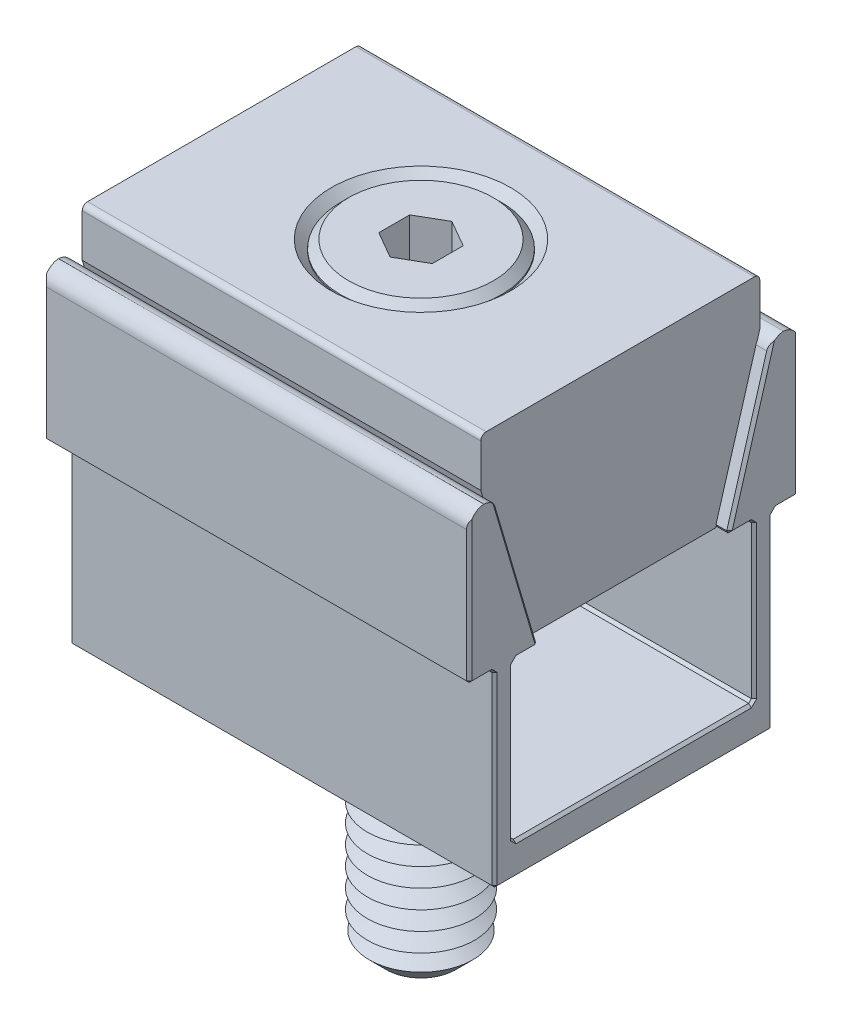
ISO-10303-21;
HEADER;
FILE_DESCRIPTION(('STEP AP214'),'2;1');
FILE_NAME('part.step','',(''),(''),'','','');
FILE_SCHEMA(('AUTOMOTIVE_DESIGN { 1 0 10303 214 1 1 1 1 }'));
ENDSEC;
DATA;
#1=APPLICATION_CONTEXT('core data for automotive mechanical design processes');
#2=APPLICATION_PROTOCOL_DEFINITION('international standard','automotive_design',2000,#1);
#3=PRODUCT_CONTEXT('',#1,'mechanical');
#4=PRODUCT('Part','Part','',(#3));
#5=PRODUCT_RELATED_PRODUCT_CATEGORY('part','',(#4));
#6=PRODUCT_DEFINITION_FORMATION('','',#4);
#7=PRODUCT_DEFINITION_CONTEXT('part definition',#1,'design');
#8=PRODUCT_DEFINITION('design','',#6,#7);
#9=PRODUCT_DEFINITION_SHAPE('','',#8);
#10=(LENGTH_UNIT() NAMED_UNIT(*) SI_UNIT(.MILLI.,.METRE.));
#11=(NAMED_UNIT(*) PLANE_ANGLE_UNIT() SI_UNIT($,.RADIAN.));
#12=(NAMED_UNIT(*) SI_UNIT($,.STERADIAN.) SOLID_ANGLE_UNIT());
#13=UNCERTAINTY_MEASURE_WITH_UNIT(LENGTH_MEASURE(1.E-05),#10,'distance_accuracy_value','');
#14=(GEOMETRIC_REPRESENTATION_CONTEXT(3) GLOBAL_UNCERTAINTY_ASSIGNED_CONTEXT((#13)) GLOBAL_UNIT_ASSIGNED_CONTEXT((#10,
#11,#12)) REPRESENTATION_CONTEXT('',''));
#15=CARTESIAN_POINT('',(0.,0.,0.));
#16=DIRECTION('',(0.,0.,1.));
#17=DIRECTION('',(1.,0.,0.));
#18=AXIS2_PLACEMENT_3D('',#15,#16,#17);
#19=CARTESIAN_POINT('',(0.,12.5,0.));
#20=DIRECTION('',(0.,1.,0.));
#21=DIRECTION('',(0.,0.,1.));
#22=AXIS2_PLACEMENT_3D('',#19,#20,#21);
#23=PLANE('',#22);
#24=CARTESIAN_POINT('',(0.,12.5,0.));
#25=DIRECTION('',(0.,1.,0.));
#26=DIRECTION('',(0.,0.,1.));
#27=AXIS2_PLACEMENT_3D('',#24,#25,#26);
#28=CIRCLE('',#27,0.999999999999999);
#29=CARTESIAN_POINT('',(0.499999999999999,12.5,0.866025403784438));
#30=VERTEX_POINT('',#29);
#31=CARTESIAN_POINT('',(0.999999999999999,12.5,0.));
#32=VERTEX_POINT('',#31);
#33=EDGE_CURVE('P0_E94',#30,#32,#28,.T.);
#34=ORIENTED_EDGE('',*,*,#33,.F.);
#35=DIRECTION('',(0.866025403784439,0.,-0.5));
#36=VECTOR('',#35,1.);
#37=CARTESIAN_POINT('',(0.,12.5,1.15470053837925));
#38=LINE('',#37,#36);
#39=CARTESIAN_POINT('',(0.999999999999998,12.5,0.577350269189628));
#40=VERTEX_POINT('',#39);
#41=EDGE_CURVE('P0_E117',#30,#40,#38,.T.);
#42=ORIENTED_EDGE('',*,*,#41,.T.);
#43=DIRECTION('',(0.,0.,-1.));
#44=VECTOR('',#43,1.);
#45=CARTESIAN_POINT('',(0.999999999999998,12.5,0.577350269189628));
#46=LINE('',#45,#44);
#47=EDGE_CURVE('P0_E113',#40,#32,#46,.T.);
#48=ORIENTED_EDGE('',*,*,#47,.T.);
#49=EDGE_LOOP('',(#34,#42,#48));
#50=FACE_BOUND('',#49,.T.);
#51=ADVANCED_FACE('P0_F16',(#50),#23,.T.);
#52=CARTESIAN_POINT('',(0.,12.5,0.));
#53=DIRECTION('',(0.,1.,0.));
#54=DIRECTION('',(0.,0.,1.));
#55=AXIS2_PLACEMENT_3D('',#52,#53,#54);
#56=CIRCLE('',#55,0.999999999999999);
#57=CARTESIAN_POINT('',(0.5,12.5,-0.866025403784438));
#58=VERTEX_POINT('',#57);
#59=EDGE_CURVE('P0_E11',#32,#58,#56,.T.);
#60=ORIENTED_EDGE('',*,*,#59,.F.);
#61=CARTESIAN_POINT('',(0.999999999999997,12.5,-0.577350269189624));
#62=VERTEX_POINT('',#61);
#63=EDGE_CURVE('P0_E105',#32,#62,#46,.T.);
#64=ORIENTED_EDGE('',*,*,#63,.T.);
#65=DIRECTION('',(-0.866025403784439,0.,-0.5));
#66=VECTOR('',#65,1.);
#67=CARTESIAN_POINT('',(0.999999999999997,12.5,-0.577350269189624));
#68=LINE('',#67,#66);
#69=EDGE_CURVE('P0_E108',#62,#58,#68,.T.);
#70=ORIENTED_EDGE('',*,*,#69,.T.);
#71=EDGE_LOOP('',(#60,#64,#70));
#72=FACE_BOUND('',#71,.T.);
#73=ADVANCED_FACE('P0_F104',(#72),#23,.T.);
#74=CARTESIAN_POINT('',(-0.5,12.5,-0.866025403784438));
#75=VERTEX_POINT('',#74);
#76=EDGE_CURVE('P0_E25',#58,#75,#56,.T.);
#77=ORIENTED_EDGE('',*,*,#76,.F.);
#78=CARTESIAN_POINT('',(0.,12.5,-1.15470053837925));
#79=VERTEX_POINT('',#78);
#80=EDGE_CURVE('P0_E140',#58,#79,#68,.T.);
#81=ORIENTED_EDGE('',*,*,#80,.T.);
#82=DIRECTION('',(-0.866025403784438,0.,0.5));
#83=VECTOR('',#82,1.);
#84=CARTESIAN_POINT('',(0.,12.5,-1.15470053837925));
#85=LINE('',#84,#83);
#86=EDGE_CURVE('P0_E348',#79,#75,#85,.T.);
#87=ORIENTED_EDGE('',*,*,#86,.T.);
#88=EDGE_LOOP('',(#77,#81,#87));
#89=FACE_BOUND('',#88,.T.);
#90=ADVANCED_FACE('P0_F350',(#89),#23,.T.);
#91=CARTESIAN_POINT('',(-0.999999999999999,12.5,0.));
#92=VERTEX_POINT('',#91);
#93=EDGE_CURVE('P0_E332',#75,#92,#56,.T.);
#94=ORIENTED_EDGE('',*,*,#93,.F.);
#95=CARTESIAN_POINT('',(-1.,12.5,-0.577350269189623));
#96=VERTEX_POINT('',#95);
#97=EDGE_CURVE('P0_E341',#75,#96,#85,.T.);
#98=ORIENTED_EDGE('',*,*,#97,.T.);
#99=DIRECTION('',(0.,0.,1.));
#100=VECTOR('',#99,1.);
#101=CARTESIAN_POINT('',(-1.,12.5,-0.577350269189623));
#102=LINE('',#101,#100);
#103=EDGE_CURVE('P0_E344',#96,#92,#102,.T.);
#104=ORIENTED_EDGE('',*,*,#103,.T.);
#105=EDGE_LOOP('',(#94,#98,#104));
#106=FACE_BOUND('',#105,.T.);
#107=ADVANCED_FACE('P0_F340',(#106),#23,.T.);
#108=CARTESIAN_POINT('',(-0.500000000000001,12.5,0.866025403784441));
#109=VERTEX_POINT('',#108);
#110=EDGE_CURVE('P0_E32',#92,#109,#56,.T.);
#111=ORIENTED_EDGE('',*,*,#110,.F.);
#112=CARTESIAN_POINT('',(-1.,12.5,0.577350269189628));
#113=VERTEX_POINT('',#112);
#114=EDGE_CURVE('P0_E351',#92,#113,#102,.T.);
#115=ORIENTED_EDGE('',*,*,#114,.T.);
#116=DIRECTION('',(0.866025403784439,0.,0.5));
#117=VECTOR('',#116,1.);
#118=CARTESIAN_POINT('',(-1.,12.5,0.577350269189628));
#119=LINE('',#118,#117);
#120=EDGE_CURVE('P0_E355',#113,#109,#119,.T.);
#121=ORIENTED_EDGE('',*,*,#120,.T.);
#122=EDGE_LOOP('',(#111,#115,#121));
#123=FACE_BOUND('',#122,.T.);
#124=ADVANCED_FACE('P0_F395',(#123),#23,.T.);
#125=CARTESIAN_POINT('',(0.,14.5,0.));
#126=DIRECTION('',(0.,1.,0.));
#127=DIRECTION('',(0.,0.,1.));
#128=AXIS2_PLACEMENT_3D('',#125,#126,#127);
#129=PLANE('',#128);
#130=DIRECTION('',(-0.866025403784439,0.,-0.5));
#131=VECTOR('',#130,1.);
#132=CARTESIAN_POINT('',(0.999999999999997,14.5,-0.577350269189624));
#133=LINE('',#132,#131);
#134=CARTESIAN_POINT('',(0.999999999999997,14.5,-0.577350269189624));
#135=VERTEX_POINT('',#134);
#136=CARTESIAN_POINT('',(0.,14.5,-1.15470053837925));
#137=VERTEX_POINT('',#136);
#138=EDGE_CURVE('P0_E40',#135,#137,#133,.T.);
#139=ORIENTED_EDGE('',*,*,#138,.F.);
#140=DIRECTION('',(0.,0.,-1.));
#141=VECTOR('',#140,1.);
#142=CARTESIAN_POINT('',(0.999999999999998,14.5,0.577350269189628));
#143=LINE('',#142,#141);
#144=CARTESIAN_POINT('',(0.999999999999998,14.5,0.577350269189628));
#145=VERTEX_POINT('',#144);
#146=EDGE_CURVE('P0_E138',#145,#135,#143,.T.);
#147=ORIENTED_EDGE('',*,*,#146,.F.);
#148=DIRECTION('',(0.866025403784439,0.,-0.5));
#149=VECTOR('',#148,1.);
#150=CARTESIAN_POINT('',(0.,14.5,1.15470053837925));
#151=LINE('',#150,#149);
#152=CARTESIAN_POINT('',(0.,14.5,1.15470053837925));
#153=VERTEX_POINT('',#152);
#154=EDGE_CURVE('P0_E135',#153,#145,#151,.T.);
#155=ORIENTED_EDGE('',*,*,#154,.F.);
#156=DIRECTION('',(0.866025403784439,0.,0.5));
#157=VECTOR('',#156,1.);
#158=CARTESIAN_POINT('',(-1.,14.5,0.577350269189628));
#159=LINE('',#158,#157);
#160=CARTESIAN_POINT('',(-1.,14.5,0.577350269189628));
#161=VERTEX_POINT('',#160);
#162=EDGE_CURVE('P0_E132',#161,#153,#159,.T.);
#163=ORIENTED_EDGE('',*,*,#162,.F.);
#164=DIRECTION('',(0.,0.,1.));
#165=VECTOR('',#164,1.);
#166=CARTESIAN_POINT('',(-1.,14.5,-0.577350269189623));
#167=LINE('',#166,#165);
#168=CARTESIAN_POINT('',(-1.,14.5,-0.577350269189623));
#169=VERTEX_POINT('',#168);
#170=EDGE_CURVE('P0_E129',#169,#161,#167,.T.);
#171=ORIENTED_EDGE('',*,*,#170,.F.);
#172=DIRECTION('',(-0.866025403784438,0.,0.5));
#173=VECTOR('',#172,1.);
#174=CARTESIAN_POINT('',(0.,14.5,-1.15470053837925));
#175=LINE('',#174,#173);
#176=EDGE_CURVE('P0_E126',#137,#169,#175,.T.);
#177=ORIENTED_EDGE('',*,*,#176,.F.);
#178=EDGE_LOOP('',(#139,#147,#155,#163,#171,#177));
#179=FACE_BOUND('',#178,.T.);
#180=CARTESIAN_POINT('',(0.,14.5,0.));
#181=DIRECTION('',(0.,1.,0.));
#182=DIRECTION('',(0.,0.,1.));
#183=AXIS2_PLACEMENT_3D('',#180,#181,#182);
#184=CIRCLE('',#183,2.7);
#185=CARTESIAN_POINT('',(0.,14.5,2.7));
#186=VERTEX_POINT('',#185);
#187=EDGE_CURVE('P0_E324',#186,#186,#184,.T.);
#188=ORIENTED_EDGE('',*,*,#187,.T.);
#189=EDGE_LOOP('',(#188));
#190=FACE_BOUND('',#189,.T.);
#191=ADVANCED_FACE('P0_F373',(#179,#190),#129,.T.);
#192=CARTESIAN_POINT('',(0.,74.7476336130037,0.));
#193=DIRECTION('',(0.,1.,0.));
#194=DIRECTION('',(0.,0.,1.));
#195=AXIS2_PLACEMENT_3D('',#192,#193,#194);
#196=CYLINDRICAL_SURFACE('',#195,3.);
#197=CARTESIAN_POINT('',(0.,14.2,0.));
#198=DIRECTION('',(0.,1.,0.));
#199=DIRECTION('',(0.,0.,1.));
#200=AXIS2_PLACEMENT_3D('',#197,#198,#199);
#201=CIRCLE('',#200,3.);
#202=CARTESIAN_POINT('',(0.,14.2,3.));
#203=VERTEX_POINT('',#202);
#204=EDGE_CURVE('P0_E328',#203,#203,#201,.F.);
#205=ORIENTED_EDGE('',*,*,#204,.T.);
#206=EDGE_LOOP('',(#205));
#207=FACE_BOUND('',#206,.T.);
#208=CARTESIAN_POINT('',(0.,11.7,0.));
#209=DIRECTION('',(0.,1.,0.));
#210=DIRECTION('',(0.,0.,1.));
#211=AXIS2_PLACEMENT_3D('',#208,#209,#210);
#212=CIRCLE('',#211,3.);
#213=CARTESIAN_POINT('',(0.,11.7,3.));
#214=VERTEX_POINT('',#213);
#215=EDGE_CURVE('P0_E318',#214,#214,#212,.T.);
#216=ORIENTED_EDGE('',*,*,#215,.T.);
#217=EDGE_LOOP('',(#216));
#218=FACE_BOUND('',#217,.T.);
#219=ADVANCED_FACE('P0_F405',(#207,#218),#196,.T.);
#220=CARTESIAN_POINT('',(0.,11.7,3.));
#221=DIRECTION('',(0.,-1.,0.));
#222=DIRECTION('',(0.,0.,-1.));
#223=AXIS2_PLACEMENT_3D('',#220,#221,#222);
#224=PLANE('',#223);
#225=CARTESIAN_POINT('',(0.,11.7,0.));
#226=DIRECTION('',(0.,1.,0.));
#227=DIRECTION('',(0.,0.,1.));
#228=AXIS2_PLACEMENT_3D('',#225,#226,#227);
#229=CIRCLE('',#228,2.);
#230=CARTESIAN_POINT('',(0.,11.7,2.));
#231=VERTEX_POINT('',#230);
#232=EDGE_CURVE('P0_E315',#231,#231,#229,.T.);
#233=ORIENTED_EDGE('',*,*,#232,.T.);
#234=EDGE_LOOP('',(#233));
#235=FACE_BOUND('',#234,.T.);
#236=ORIENTED_EDGE('',*,*,#215,.F.);
#237=EDGE_LOOP('',(#236));
#238=FACE_BOUND('',#237,.T.);
#239=ADVANCED_FACE('P0_F989',(#235,#238),#224,.T.);
#240=CARTESIAN_POINT('',(0.,11.35,0.));
#241=DIRECTION('',(0.,1.,0.));
#242=DIRECTION('',(0.,0.,1.));
#243=AXIS2_PLACEMENT_3D('',#240,#241,#242);
#244=CONICAL_SURFACE('',#243,1.39378221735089,1.04719755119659);
#245=ORIENTED_EDGE('',*,*,#232,.F.);
#246=EDGE_LOOP('',(#245));
#247=FACE_BOUND('',#246,.T.);
#248=CARTESIAN_POINT('',(0.,11.35,0.));
#249=DIRECTION('',(0.,1.,0.));
#250=DIRECTION('',(0.,0.,1.));
#251=AXIS2_PLACEMENT_3D('',#248,#249,#250);
#252=CIRCLE('',#251,1.39378221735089);
#253=CARTESIAN_POINT('',(0.,11.35,1.39378221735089));
#254=VERTEX_POINT('',#253);
#255=EDGE_CURVE('P0_E312',#254,#254,#252,.T.);
#256=ORIENTED_EDGE('',*,*,#255,.T.);
#257=EDGE_LOOP('',(#256));
#258=FACE_BOUND('',#257,.T.);
#259=ADVANCED_FACE('P0_F980',(#247,#258),#244,.T.);
#260=CARTESIAN_POINT('',(0.,11.,0.));
#261=DIRECTION('',(0.,-1.,0.));
#262=DIRECTION('',(0.,0.,-1.));
#263=AXIS2_PLACEMENT_3D('',#260,#261,#262);
#264=CONICAL_SURFACE('',#263,2.,1.04719755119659);
#265=ORIENTED_EDGE('',*,*,#255,.F.);
#266=EDGE_LOOP('',(#265));
#267=FACE_BOUND('',#266,.T.);
#268=CARTESIAN_POINT('',(0.,11.,0.));
#269=DIRECTION('',(0.,1.,0.));
#270=DIRECTION('',(0.,0.,1.));
#271=AXIS2_PLACEMENT_3D('',#268,#269,#270);
#272=CIRCLE('',#271,2.);
#273=CARTESIAN_POINT('',(0.,11.,2.));
#274=VERTEX_POINT('',#273);
#275=EDGE_CURVE('P0_E309',#274,#274,#272,.T.);
#276=ORIENTED_EDGE('',*,*,#275,.T.);
#277=EDGE_LOOP('',(#276));
#278=FACE_BOUND('',#277,.T.);
#279=ADVANCED_FACE('P0_F971',(#267,#278),#264,.T.);
#280=CARTESIAN_POINT('',(0.,10.65,0.));
#281=DIRECTION('',(0.,1.,0.));
#282=DIRECTION('',(0.,0.,1.));
#283=AXIS2_PLACEMENT_3D('',#280,#281,#282);
#284=CONICAL_SURFACE('',#283,1.39378221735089,1.04719755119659);
#285=ORIENTED_EDGE('',*,*,#275,.F.);
#286=EDGE_LOOP('',(#285));
#287=FACE_BOUND('',#286,.T.);
#288=CARTESIAN_POINT('',(0.,10.65,0.));
#289=DIRECTION('',(0.,1.,0.));
#290=DIRECTION('',(0.,0.,1.));
#291=AXIS2_PLACEMENT_3D('',#288,#289,#290);
#292=CIRCLE('',#291,1.39378221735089);
#293=CARTESIAN_POINT('',(0.,10.65,1.39378221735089));
#294=VERTEX_POINT('',#293);
#295=EDGE_CURVE('P0_E306',#294,#294,#292,.T.);
#296=ORIENTED_EDGE('',*,*,#295,.T.);
#297=EDGE_LOOP('',(#296));
#298=FACE_BOUND('',#297,.T.);
#299=ADVANCED_FACE('P0_F962',(#287,#298),#284,.T.);
#300=CARTESIAN_POINT('',(0.,10.3,0.));
#301=DIRECTION('',(0.,-1.,0.));
#302=DIRECTION('',(0.,0.,-1.));
#303=AXIS2_PLACEMENT_3D('',#300,#301,#302);
#304=CONICAL_SURFACE('',#303,2.,1.04719755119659);
#305=ORIENTED_EDGE('',*,*,#295,.F.);
#306=EDGE_LOOP('',(#305));
#307=FACE_BOUND('',#306,.T.);
#308=CARTESIAN_POINT('',(0.,10.3,0.));
#309=DIRECTION('',(0.,1.,0.));
#310=DIRECTION('',(0.,0.,1.));
#311=AXIS2_PLACEMENT_3D('',#308,#309,#310);
#312=CIRCLE('',#311,2.);
#313=CARTESIAN_POINT('',(0.,10.3,2.));
#314=VERTEX_POINT('',#313);
#315=EDGE_CURVE('P0_E303',#314,#314,#312,.T.);
#316=ORIENTED_EDGE('',*,*,#315,.T.);
#317=EDGE_LOOP('',(#316));
#318=FACE_BOUND('',#317,.T.);
#319=ADVANCED_FACE('P0_F953',(#307,#318),#304,.T.);
#320=CARTESIAN_POINT('',(0.,9.95,0.));
#321=DIRECTION('',(0.,1.,0.));
#322=DIRECTION('',(0.,0.,1.));
#323=AXIS2_PLACEMENT_3D('',#320,#321,#322);
#324=CONICAL_SURFACE('',#323,1.39378221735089,1.04719755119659);
#325=ORIENTED_EDGE('',*,*,#315,.F.);
#326=EDGE_LOOP('',(#325));
#327=FACE_BOUND('',#326,.T.);
#328=CARTESIAN_POINT('',(0.,9.95,0.));
#329=DIRECTION('',(0.,1.,0.));
#330=DIRECTION('',(0.,0.,1.));
#331=AXIS2_PLACEMENT_3D('',#328,#329,#330);
#332=CIRCLE('',#331,1.39378221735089);
#333=CARTESIAN_POINT('',(0.,9.95,1.39378221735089));
#334=VERTEX_POINT('',#333);
#335=EDGE_CURVE('P0_E300',#334,#334,#332,.T.);
#336=ORIENTED_EDGE('',*,*,#335,.T.);
#337=EDGE_LOOP('',(#336));
#338=FACE_BOUND('',#337,.T.);
#339=ADVANCED_FACE('P0_F944',(#327,#338),#324,.T.);
#340=CARTESIAN_POINT('',(0.,9.6,0.));
#341=DIRECTION('',(0.,-1.,0.));
#342=DIRECTION('',(0.,0.,-1.));
#343=AXIS2_PLACEMENT_3D('',#340,#341,#342);
#344=CONICAL_SURFACE('',#343,2.,1.04719755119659);
#345=ORIENTED_EDGE('',*,*,#335,.F.);
#346=EDGE_LOOP('',(#345));
#347=FACE_BOUND('',#346,.T.);
#348=CARTESIAN_POINT('',(0.,9.60000000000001,0.));
#349=DIRECTION('',(0.,1.,0.));
#350=DIRECTION('',(0.,0.,1.));
#351=AXIS2_PLACEMENT_3D('',#348,#349,#350);
#352=CIRCLE('',#351,2.);
#353=CARTESIAN_POINT('',(0.,9.60000000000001,2.));
#354=VERTEX_POINT('',#353);
#355=EDGE_CURVE('P0_E297',#354,#354,#352,.T.);
#356=ORIENTED_EDGE('',*,*,#355,.T.);
#357=EDGE_LOOP('',(#356));
#358=FACE_BOUND('',#357,.T.);
#359=ADVANCED_FACE('P0_F935',(#347,#358),#344,.T.);
#360=CARTESIAN_POINT('',(0.,9.25,0.));
#361=DIRECTION('',(0.,1.,0.));
#362=DIRECTION('',(0.,0.,1.));
#363=AXIS2_PLACEMENT_3D('',#360,#361,#362);
#364=CONICAL_SURFACE('',#363,1.39378221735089,1.04719755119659);
#365=ORIENTED_EDGE('',*,*,#355,.F.);
#366=EDGE_LOOP('',(#365));
#367=FACE_BOUND('',#366,.T.);
#368=CARTESIAN_POINT('',(0.,9.25,0.));
#369=DIRECTION('',(0.,1.,0.));
#370=DIRECTION('',(0.,0.,1.));
#371=AXIS2_PLACEMENT_3D('',#368,#369,#370);
#372=CIRCLE('',#371,1.39378221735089);
#373=CARTESIAN_POINT('',(0.,9.25,1.39378221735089));
#374=VERTEX_POINT('',#373);
#375=EDGE_CURVE('P0_E294',#374,#374,#372,.T.);
#376=ORIENTED_EDGE('',*,*,#375,.T.);
#377=EDGE_LOOP('',(#376));
#378=FACE_BOUND('',#377,.T.);
#379=ADVANCED_FACE('P0_F926',(#367,#378),#364,.T.);
#380=CARTESIAN_POINT('',(0.,8.9,0.));
#381=DIRECTION('',(0.,-1.,0.));
#382=DIRECTION('',(0.,0.,-1.));
#383=AXIS2_PLACEMENT_3D('',#380,#381,#382);
#384=CONICAL_SURFACE('',#383,2.,1.04719755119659);
#385=ORIENTED_EDGE('',*,*,#375,.F.);
#386=EDGE_LOOP('',(#385));
#387=FACE_BOUND('',#386,.T.);
#388=CARTESIAN_POINT('',(0.,8.90000000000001,0.));
#389=DIRECTION('',(0.,1.,0.));
#390=DIRECTION('',(0.,0.,1.));
#391=AXIS2_PLACEMENT_3D('',#388,#389,#390);
#392=CIRCLE('',#391,2.);
#393=CARTESIAN_POINT('',(0.,8.90000000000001,2.));
#394=VERTEX_POINT('',#393);
#395=EDGE_CURVE('P0_E291',#394,#394,#392,.T.);
#396=ORIENTED_EDGE('',*,*,#395,.T.);
#397=EDGE_LOOP('',(#396));
#398=FACE_BOUND('',#397,.T.);
#399=ADVANCED_FACE('P0_F917',(#387,#398),#384,.T.);
#400=CARTESIAN_POINT('',(0.,8.55,0.));
#401=DIRECTION('',(0.,1.,0.));
#402=DIRECTION('',(0.,0.,1.));
#403=AXIS2_PLACEMENT_3D('',#400,#401,#402);
#404=CONICAL_SURFACE('',#403,1.39378221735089,1.04719755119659);
#405=ORIENTED_EDGE('',*,*,#395,.F.);
#406=EDGE_LOOP('',(#405));
#407=FACE_BOUND('',#406,.T.);
#408=CARTESIAN_POINT('',(0.,8.55,0.));
#409=DIRECTION('',(0.,1.,0.));
#410=DIRECTION('',(0.,0.,1.));
#411=AXIS2_PLACEMENT_3D('',#408,#409,#410);
#412=CIRCLE('',#411,1.39378221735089);
#413=CARTESIAN_POINT('',(0.,8.55,1.39378221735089));
#414=VERTEX_POINT('',#413);
#415=EDGE_CURVE('P0_E288',#414,#414,#412,.T.);
#416=ORIENTED_EDGE('',*,*,#415,.T.);
#417=EDGE_LOOP('',(#416));
#418=FACE_BOUND('',#417,.T.);
#419=ADVANCED_FACE('P0_F908',(#407,#418),#404,.T.);
#420=CARTESIAN_POINT('',(0.,8.2,0.));
#421=DIRECTION('',(0.,-1.,0.));
#422=DIRECTION('',(0.,0.,-1.));
#423=AXIS2_PLACEMENT_3D('',#420,#421,#422);
#424=CONICAL_SURFACE('',#423,2.,1.04719755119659);
#425=ORIENTED_EDGE('',*,*,#415,.F.);
#426=EDGE_LOOP('',(#425));
#427=FACE_BOUND('',#426,.T.);
#428=CARTESIAN_POINT('',(0.,8.20000000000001,0.));
#429=DIRECTION('',(0.,1.,0.));
#430=DIRECTION('',(0.,0.,1.));
#431=AXIS2_PLACEMENT_3D('',#428,#429,#430);
#432=CIRCLE('',#431,2.);
#433=CARTESIAN_POINT('',(0.,8.20000000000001,2.));
#434=VERTEX_POINT('',#433);
#435=EDGE_CURVE('P0_E285',#434,#434,#432,.T.);
#436=ORIENTED_EDGE('',*,*,#435,.T.);
#437=EDGE_LOOP('',(#436));
#438=FACE_BOUND('',#437,.T.);
#439=ADVANCED_FACE('P0_F899',(#427,#438),#424,.T.);
#440=CARTESIAN_POINT('',(0.,7.85,0.));
#441=DIRECTION('',(0.,1.,0.));
#442=DIRECTION('',(0.,0.,1.));
#443=AXIS2_PLACEMENT_3D('',#440,#441,#442);
#444=CONICAL_SURFACE('',#443,1.39378221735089,1.04719755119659);
#445=ORIENTED_EDGE('',*,*,#435,.F.);
#446=EDGE_LOOP('',(#445));
#447=FACE_BOUND('',#446,.T.);
#448=CARTESIAN_POINT('',(0.,7.85,0.));
#449=DIRECTION('',(0.,1.,0.));
#450=DIRECTION('',(0.,0.,1.));
#451=AXIS2_PLACEMENT_3D('',#448,#449,#450);
#452=CIRCLE('',#451,1.39378221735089);
#453=CARTESIAN_POINT('',(0.,7.85,1.39378221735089));
#454=VERTEX_POINT('',#453);
#455=EDGE_CURVE('P0_E282',#454,#454,#452,.T.);
#456=ORIENTED_EDGE('',*,*,#455,.T.);
#457=EDGE_LOOP('',(#456));
#458=FACE_BOUND('',#457,.T.);
#459=ADVANCED_FACE('P0_F890',(#447,#458),#444,.T.);
#460=CARTESIAN_POINT('',(0.,7.5,0.));
#461=DIRECTION('',(0.,-1.,0.));
#462=DIRECTION('',(0.,0.,-1.));
#463=AXIS2_PLACEMENT_3D('',#460,#461,#462);
#464=CONICAL_SURFACE('',#463,2.,1.04719755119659);
#465=ORIENTED_EDGE('',*,*,#455,.F.);
#466=EDGE_LOOP('',(#465));
#467=FACE_BOUND('',#466,.T.);
#468=CARTESIAN_POINT('',(0.,7.50000000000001,0.));
#469=DIRECTION('',(0.,1.,0.));
#470=DIRECTION('',(0.,0.,1.));
#471=AXIS2_PLACEMENT_3D('',#468,#469,#470);
#472=CIRCLE('',#471,2.);
#473=CARTESIAN_POINT('',(0.,7.50000000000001,2.));
#474=VERTEX_POINT('',#473);
#475=EDGE_CURVE('P0_E279',#474,#474,#472,.T.);
#476=ORIENTED_EDGE('',*,*,#475,.T.);
#477=EDGE_LOOP('',(#476));
#478=FACE_BOUND('',#477,.T.);
#479=ADVANCED_FACE('P0_F881',(#467,#478),#464,.T.);
#480=CARTESIAN_POINT('',(0.,7.15,0.));
#481=DIRECTION('',(0.,1.,0.));
#482=DIRECTION('',(0.,0.,1.));
#483=AXIS2_PLACEMENT_3D('',#480,#481,#482);
#484=CONICAL_SURFACE('',#483,1.39378221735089,1.04719755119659);
#485=ORIENTED_EDGE('',*,*,#475,.F.);
#486=EDGE_LOOP('',(#485));
#487=FACE_BOUND('',#486,.T.);
#488=CARTESIAN_POINT('',(0.,7.15,0.));
#489=DIRECTION('',(0.,1.,0.));
#490=DIRECTION('',(0.,0.,1.));
#491=AXIS2_PLACEMENT_3D('',#488,#489,#490);
#492=CIRCLE('',#491,1.39378221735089);
#493=CARTESIAN_POINT('',(0.,7.15,1.39378221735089));
#494=VERTEX_POINT('',#493);
#495=EDGE_CURVE('P0_E276',#494,#494,#492,.T.);
#496=ORIENTED_EDGE('',*,*,#495,.T.);
#497=EDGE_LOOP('',(#496));
#498=FACE_BOUND('',#497,.T.);
#499=ADVANCED_FACE('P0_F872',(#487,#498),#484,.T.);
#500=CARTESIAN_POINT('',(0.,6.8,0.));
#501=DIRECTION('',(0.,-1.,0.));
#502=DIRECTION('',(0.,0.,-1.));
#503=AXIS2_PLACEMENT_3D('',#500,#501,#502);
#504=CONICAL_SURFACE('',#503,2.,1.04719755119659);
#505=ORIENTED_EDGE('',*,*,#495,.F.);
#506=EDGE_LOOP('',(#505));
#507=FACE_BOUND('',#506,.T.);
#508=CARTESIAN_POINT('',(0.,6.80000000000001,0.));
#509=DIRECTION('',(0.,1.,0.));
#510=DIRECTION('',(0.,0.,1.));
#511=AXIS2_PLACEMENT_3D('',#508,#509,#510);
#512=CIRCLE('',#511,2.);
#513=CARTESIAN_POINT('',(0.,6.80000000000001,2.));
#514=VERTEX_POINT('',#513);
#515=EDGE_CURVE('P0_E273',#514,#514,#512,.T.);
#516=ORIENTED_EDGE('',*,*,#515,.T.);
#517=EDGE_LOOP('',(#516));
#518=FACE_BOUND('',#517,.T.);
#519=ADVANCED_FACE('P0_F863',(#507,#518),#504,.T.);
#520=CARTESIAN_POINT('',(0.,6.45,0.));
#521=DIRECTION('',(0.,1.,0.));
#522=DIRECTION('',(0.,0.,1.));
#523=AXIS2_PLACEMENT_3D('',#520,#521,#522);
#524=CONICAL_SURFACE('',#523,1.39378221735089,1.04719755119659);
#525=ORIENTED_EDGE('',*,*,#515,.F.);
#526=EDGE_LOOP('',(#525));
#527=FACE_BOUND('',#526,.T.);
#528=CARTESIAN_POINT('',(0.,6.45,0.));
#529=DIRECTION('',(0.,1.,0.));
#530=DIRECTION('',(0.,0.,1.));
#531=AXIS2_PLACEMENT_3D('',#528,#529,#530);
#532=CIRCLE('',#531,1.39378221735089);
#533=CARTESIAN_POINT('',(0.,6.45,1.39378221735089));
#534=VERTEX_POINT('',#533);
#535=EDGE_CURVE('P0_E270',#534,#534,#532,.T.);
#536=ORIENTED_EDGE('',*,*,#535,.T.);
#537=EDGE_LOOP('',(#536));
#538=FACE_BOUND('',#537,.T.);
#539=ADVANCED_FACE('P0_F854',(#527,#538),#524,.T.);
#540=CARTESIAN_POINT('',(0.,6.1,0.));
#541=DIRECTION('',(0.,-1.,0.));
#542=DIRECTION('',(0.,0.,-1.));
#543=AXIS2_PLACEMENT_3D('',#540,#541,#542);
#544=CONICAL_SURFACE('',#543,2.,1.04719755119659);
#545=ORIENTED_EDGE('',*,*,#535,.F.);
#546=EDGE_LOOP('',(#545));
#547=FACE_BOUND('',#546,.T.);
#548=CARTESIAN_POINT('',(0.,6.1,0.));
#549=DIRECTION('',(0.,1.,0.));
#550=DIRECTION('',(0.,0.,1.));
#551=AXIS2_PLACEMENT_3D('',#548,#549,#550);
#552=CIRCLE('',#551,2.);
#553=CARTESIAN_POINT('',(0.,6.1,2.));
#554=VERTEX_POINT('',#553);
#555=EDGE_CURVE('P0_E267',#554,#554,#552,.T.);
#556=ORIENTED_EDGE('',*,*,#555,.T.);
#557=EDGE_LOOP('',(#556));
#558=FACE_BOUND('',#557,.T.);
#559=ADVANCED_FACE('P0_F845',(#547,#558),#544,.T.);
#560=CARTESIAN_POINT('',(0.,5.75,0.));
#561=DIRECTION('',(0.,1.,0.));
#562=DIRECTION('',(0.,0.,1.));
#563=AXIS2_PLACEMENT_3D('',#560,#561,#562);
#564=CONICAL_SURFACE('',#563,1.39378221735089,1.04719755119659);
#565=ORIENTED_EDGE('',*,*,#555,.F.);
#566=EDGE_LOOP('',(#565));
#567=FACE_BOUND('',#566,.T.);
#568=CARTESIAN_POINT('',(0.,5.75,0.));
#569=DIRECTION('',(0.,1.,0.));
#570=DIRECTION('',(0.,0.,1.));
#571=AXIS2_PLACEMENT_3D('',#568,#569,#570);
#572=CIRCLE('',#571,1.39378221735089);
#573=CARTESIAN_POINT('',(0.,5.75,1.39378221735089));
#574=VERTEX_POINT('',#573);
#575=EDGE_CURVE('P0_E264',#574,#574,#572,.T.);
#576=ORIENTED_EDGE('',*,*,#575,.T.);
#577=EDGE_LOOP('',(#576));
#578=FACE_BOUND('',#577,.T.);
#579=ADVANCED_FACE('P0_F836',(#567,#578),#564,.T.);
#580=CARTESIAN_POINT('',(0.,5.4,0.));
#581=DIRECTION('',(0.,-1.,0.));
#582=DIRECTION('',(0.,0.,-1.));
#583=AXIS2_PLACEMENT_3D('',#580,#581,#582);
#584=CONICAL_SURFACE('',#583,2.,1.04719755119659);
#585=ORIENTED_EDGE('',*,*,#575,.F.);
#586=EDGE_LOOP('',(#585));
#587=FACE_BOUND('',#586,.T.);
#588=CARTESIAN_POINT('',(0.,5.40000000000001,0.));
#589=DIRECTION('',(0.,1.,0.));
#590=DIRECTION('',(0.,0.,1.));
#591=AXIS2_PLACEMENT_3D('',#588,#589,#590);
#592=CIRCLE('',#591,2.);
#593=CARTESIAN_POINT('',(0.,5.40000000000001,2.));
#594=VERTEX_POINT('',#593);
#595=EDGE_CURVE('P0_E261',#594,#594,#592,.T.);
#596=ORIENTED_EDGE('',*,*,#595,.T.);
#597=EDGE_LOOP('',(#596));
#598=FACE_BOUND('',#597,.T.);
#599=ADVANCED_FACE('P0_F827',(#587,#598),#584,.T.);
#600=CARTESIAN_POINT('',(0.,5.05,0.));
#601=DIRECTION('',(0.,1.,0.));
#602=DIRECTION('',(0.,0.,1.));
#603=AXIS2_PLACEMENT_3D('',#600,#601,#602);
#604=CONICAL_SURFACE('',#603,1.39378221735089,1.04719755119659);
#605=ORIENTED_EDGE('',*,*,#595,.F.);
#606=EDGE_LOOP('',(#605));
#607=FACE_BOUND('',#606,.T.);
#608=CARTESIAN_POINT('',(0.,5.05,0.));
#609=DIRECTION('',(0.,1.,0.));
#610=DIRECTION('',(0.,0.,1.));
#611=AXIS2_PLACEMENT_3D('',#608,#609,#610);
#612=CIRCLE('',#611,1.39378221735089);
#613=CARTESIAN_POINT('',(0.,5.05,1.39378221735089));
#614=VERTEX_POINT('',#613);
#615=EDGE_CURVE('P0_E258',#614,#614,#612,.T.);
#616=ORIENTED_EDGE('',*,*,#615,.T.);
#617=EDGE_LOOP('',(#616));
#618=FACE_BOUND('',#617,.T.);
#619=ADVANCED_FACE('P0_F818',(#607,#618),#604,.T.);
#620=CARTESIAN_POINT('',(0.,4.7,0.));
#621=DIRECTION('',(0.,-1.,0.));
#622=DIRECTION('',(0.,0.,-1.));
#623=AXIS2_PLACEMENT_3D('',#620,#621,#622);
#624=CONICAL_SURFACE('',#623,2.,1.04719755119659);
#625=ORIENTED_EDGE('',*,*,#615,.F.);
#626=EDGE_LOOP('',(#625));
#627=FACE_BOUND('',#626,.T.);
#628=CARTESIAN_POINT('',(0.,4.70000000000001,0.));
#629=DIRECTION('',(0.,1.,0.));
#630=DIRECTION('',(0.,0.,1.));
#631=AXIS2_PLACEMENT_3D('',#628,#629,#630);
#632=CIRCLE('',#631,2.);
#633=CARTESIAN_POINT('',(0.,4.70000000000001,2.));
#634=VERTEX_POINT('',#633);
#635=EDGE_CURVE('P0_E255',#634,#634,#632,.T.);
#636=ORIENTED_EDGE('',*,*,#635,.T.);
#637=EDGE_LOOP('',(#636));
#638=FACE_BOUND('',#637,.T.);
#639=ADVANCED_FACE('P0_F809',(#627,#638),#624,.T.);
#640=CARTESIAN_POINT('',(0.,4.35,0.));
#641=DIRECTION('',(0.,1.,0.));
#642=DIRECTION('',(0.,0.,1.));
#643=AXIS2_PLACEMENT_3D('',#640,#641,#642);
#644=CONICAL_SURFACE('',#643,1.39378221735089,1.04719755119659);
#645=ORIENTED_EDGE('',*,*,#635,.F.);
#646=EDGE_LOOP('',(#645));
#647=FACE_BOUND('',#646,.T.);
#648=CARTESIAN_POINT('',(0.,4.35,0.));
#649=DIRECTION('',(0.,1.,0.));
#650=DIRECTION('',(0.,0.,1.));
#651=AXIS2_PLACEMENT_3D('',#648,#649,#650);
#652=CIRCLE('',#651,1.39378221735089);
#653=CARTESIAN_POINT('',(0.,4.35,1.39378221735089));
#654=VERTEX_POINT('',#653);
#655=EDGE_CURVE('P0_E252',#654,#654,#652,.T.);
#656=ORIENTED_EDGE('',*,*,#655,.T.);
#657=EDGE_LOOP('',(#656));
#658=FACE_BOUND('',#657,.T.);
#659=ADVANCED_FACE('P0_F800',(#647,#658),#644,.T.);
#660=CARTESIAN_POINT('',(0.,4.,0.));
#661=DIRECTION('',(0.,-1.,0.));
#662=DIRECTION('',(0.,0.,-1.));
#663=AXIS2_PLACEMENT_3D('',#660,#661,#662);
#664=CONICAL_SURFACE('',#663,2.,1.04719755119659);
#665=ORIENTED_EDGE('',*,*,#655,.F.);
#666=EDGE_LOOP('',(#665));
#667=FACE_BOUND('',#666,.T.);
#668=CARTESIAN_POINT('',(0.,4.00000000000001,0.));
#669=DIRECTION('',(0.,1.,0.));
#670=DIRECTION('',(0.,0.,1.));
#671=AXIS2_PLACEMENT_3D('',#668,#669,#670);
#672=CIRCLE('',#671,2.);
#673=CARTESIAN_POINT('',(0.,4.00000000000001,2.));
#674=VERTEX_POINT('',#673);
#675=EDGE_CURVE('P0_E249',#674,#674,#672,.T.);
#676=ORIENTED_EDGE('',*,*,#675,.T.);
#677=EDGE_LOOP('',(#676));
#678=FACE_BOUND('',#677,.T.);
#679=ADVANCED_FACE('P0_F791',(#667,#678),#664,.T.);
#680=CARTESIAN_POINT('',(0.,3.65,0.));
#681=DIRECTION('',(0.,1.,0.));
#682=DIRECTION('',(0.,0.,1.));
#683=AXIS2_PLACEMENT_3D('',#680,#681,#682);
#684=CONICAL_SURFACE('',#683,1.39378221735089,1.04719755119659);
#685=ORIENTED_EDGE('',*,*,#675,.F.);
#686=EDGE_LOOP('',(#685));
#687=FACE_BOUND('',#686,.T.);
#688=CARTESIAN_POINT('',(0.,3.65,0.));
#689=DIRECTION('',(0.,1.,0.));
#690=DIRECTION('',(0.,0.,1.));
#691=AXIS2_PLACEMENT_3D('',#688,#689,#690);
#692=CIRCLE('',#691,1.39378221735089);
#693=CARTESIAN_POINT('',(0.,3.65,1.39378221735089));
#694=VERTEX_POINT('',#693);
#695=EDGE_CURVE('P0_E246',#694,#694,#692,.T.);
#696=ORIENTED_EDGE('',*,*,#695,.T.);
#697=EDGE_LOOP('',(#696));
#698=FACE_BOUND('',#697,.T.);
#699=ADVANCED_FACE('P0_F782',(#687,#698),#684,.T.);
#700=CARTESIAN_POINT('',(0.,3.3,0.));
#701=DIRECTION('',(0.,-1.,0.));
#702=DIRECTION('',(0.,0.,-1.));
#703=AXIS2_PLACEMENT_3D('',#700,#701,#702);
#704=CONICAL_SURFACE('',#703,2.,1.04719755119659);
#705=ORIENTED_EDGE('',*,*,#695,.F.);
#706=EDGE_LOOP('',(#705));
#707=FACE_BOUND('',#706,.T.);
#708=CARTESIAN_POINT('',(0.,3.30000000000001,0.));
#709=DIRECTION('',(0.,1.,0.));
#710=DIRECTION('',(0.,0.,1.));
#711=AXIS2_PLACEMENT_3D('',#708,#709,#710);
#712=CIRCLE('',#711,2.);
#713=CARTESIAN_POINT('',(0.,3.30000000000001,2.));
#714=VERTEX_POINT('',#713);
#715=EDGE_CURVE('P0_E243',#714,#714,#712,.T.);
#716=ORIENTED_EDGE('',*,*,#715,.T.);
#717=EDGE_LOOP('',(#716));
#718=FACE_BOUND('',#717,.T.);
#719=ADVANCED_FACE('P0_F773',(#707,#718),#704,.T.);
#720=CARTESIAN_POINT('',(0.,2.95,0.));
#721=DIRECTION('',(0.,1.,0.));
#722=DIRECTION('',(0.,0.,1.));
#723=AXIS2_PLACEMENT_3D('',#720,#721,#722);
#724=CONICAL_SURFACE('',#723,1.39378221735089,1.04719755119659);
#725=ORIENTED_EDGE('',*,*,#715,.F.);
#726=EDGE_LOOP('',(#725));
#727=FACE_BOUND('',#726,.T.);
#728=CARTESIAN_POINT('',(0.,2.95,0.));
#729=DIRECTION('',(0.,1.,0.));
#730=DIRECTION('',(0.,0.,1.));
#731=AXIS2_PLACEMENT_3D('',#728,#729,#730);
#732=CIRCLE('',#731,1.39378221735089);
#733=CARTESIAN_POINT('',(0.,2.95,1.39378221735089));
#734=VERTEX_POINT('',#733);
#735=EDGE_CURVE('P0_E240',#734,#734,#732,.T.);
#736=ORIENTED_EDGE('',*,*,#735,.T.);
#737=EDGE_LOOP('',(#736));
#738=FACE_BOUND('',#737,.T.);
#739=ADVANCED_FACE('P0_F764',(#727,#738),#724,.T.);
#740=CARTESIAN_POINT('',(0.,2.6,0.));
#741=DIRECTION('',(0.,-1.,0.));
#742=DIRECTION('',(0.,0.,-1.));
#743=AXIS2_PLACEMENT_3D('',#740,#741,#742);
#744=CONICAL_SURFACE('',#743,2.,1.04719755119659);
#745=ORIENTED_EDGE('',*,*,#735,.F.);
#746=EDGE_LOOP('',(#745));
#747=FACE_BOUND('',#746,.T.);
#748=CARTESIAN_POINT('',(0.,2.6,0.));
#749=DIRECTION('',(0.,1.,0.));
#750=DIRECTION('',(0.,0.,1.));
#751=AXIS2_PLACEMENT_3D('',#748,#749,#750);
#752=CIRCLE('',#751,2.);
#753=CARTESIAN_POINT('',(0.,2.6,2.));
#754=VERTEX_POINT('',#753);
#755=EDGE_CURVE('P0_E237',#754,#754,#752,.T.);
#756=ORIENTED_EDGE('',*,*,#755,.T.);
#757=EDGE_LOOP('',(#756));
#758=FACE_BOUND('',#757,.T.);
#759=ADVANCED_FACE('P0_F755',(#747,#758),#744,.T.);
#760=CARTESIAN_POINT('',(0.,2.25,0.));
#761=DIRECTION('',(0.,1.,0.));
#762=DIRECTION('',(0.,0.,1.));
#763=AXIS2_PLACEMENT_3D('',#760,#761,#762);
#764=CONICAL_SURFACE('',#763,1.39378221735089,1.04719755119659);
#765=ORIENTED_EDGE('',*,*,#755,.F.);
#766=EDGE_LOOP('',(#765));
#767=FACE_BOUND('',#766,.T.);
#768=CARTESIAN_POINT('',(0.,2.25,0.));
#769=DIRECTION('',(0.,1.,0.));
#770=DIRECTION('',(0.,0.,1.));
#771=AXIS2_PLACEMENT_3D('',#768,#769,#770);
#772=CIRCLE('',#771,1.39378221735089);
#773=CARTESIAN_POINT('',(0.,2.25,1.39378221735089));
#774=VERTEX_POINT('',#773);
#775=EDGE_CURVE('P0_E234',#774,#774,#772,.T.);
#776=ORIENTED_EDGE('',*,*,#775,.T.);
#777=EDGE_LOOP('',(#776));
#778=FACE_BOUND('',#777,.T.);
#779=ADVANCED_FACE('P0_F746',(#767,#778),#764,.T.);
#780=CARTESIAN_POINT('',(0.,1.9,0.));
#781=DIRECTION('',(0.,-1.,0.));
#782=DIRECTION('',(0.,0.,-1.));
#783=AXIS2_PLACEMENT_3D('',#780,#781,#782);
#784=CONICAL_SURFACE('',#783,2.,1.04719755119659);
#785=ORIENTED_EDGE('',*,*,#775,.F.);
#786=EDGE_LOOP('',(#785));
#787=FACE_BOUND('',#786,.T.);
#788=CARTESIAN_POINT('',(0.,1.90000000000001,0.));
#789=DIRECTION('',(0.,1.,0.));
#790=DIRECTION('',(0.,0.,1.));
#791=AXIS2_PLACEMENT_3D('',#788,#789,#790);
#792=CIRCLE('',#791,2.);
#793=CARTESIAN_POINT('',(0.,1.90000000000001,2.));
#794=VERTEX_POINT('',#793);
#795=EDGE_CURVE('P0_E231',#794,#794,#792,.T.);
#796=ORIENTED_EDGE('',*,*,#795,.T.);
#797=EDGE_LOOP('',(#796));
#798=FACE_BOUND('',#797,.T.);
#799=ADVANCED_FACE('P0_F737',(#787,#798),#784,.T.);
#800=CARTESIAN_POINT('',(0.,1.55,0.));
#801=DIRECTION('',(0.,1.,0.));
#802=DIRECTION('',(0.,0.,1.));
#803=AXIS2_PLACEMENT_3D('',#800,#801,#802);
#804=CONICAL_SURFACE('',#803,1.39378221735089,1.04719755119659);
#805=ORIENTED_EDGE('',*,*,#795,.F.);
#806=EDGE_LOOP('',(#805));
#807=FACE_BOUND('',#806,.T.);
#808=CARTESIAN_POINT('',(0.,1.55,0.));
#809=DIRECTION('',(0.,1.,0.));
#810=DIRECTION('',(0.,0.,1.));
#811=AXIS2_PLACEMENT_3D('',#808,#809,#810);
#812=CIRCLE('',#811,1.39378221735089);
#813=CARTESIAN_POINT('',(0.,1.55,1.39378221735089));
#814=VERTEX_POINT('',#813);
#815=EDGE_CURVE('P0_E228',#814,#814,#812,.T.);
#816=ORIENTED_EDGE('',*,*,#815,.T.);
#817=EDGE_LOOP('',(#816));
#818=FACE_BOUND('',#817,.T.);
#819=ADVANCED_FACE('P0_F728',(#807,#818),#804,.T.);
#820=CARTESIAN_POINT('',(0.,1.2,0.));
#821=DIRECTION('',(0.,-1.,0.));
#822=DIRECTION('',(0.,0.,-1.));
#823=AXIS2_PLACEMENT_3D('',#820,#821,#822);
#824=CONICAL_SURFACE('',#823,2.,1.04719755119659);
#825=ORIENTED_EDGE('',*,*,#815,.F.);
#826=EDGE_LOOP('',(#825));
#827=FACE_BOUND('',#826,.T.);
#828=CARTESIAN_POINT('',(0.,1.2,0.));
#829=DIRECTION('',(0.,1.,0.));
#830=DIRECTION('',(0.,0.,1.));
#831=AXIS2_PLACEMENT_3D('',#828,#829,#830);
#832=CIRCLE('',#831,2.);
#833=CARTESIAN_POINT('',(0.,1.2,2.));
#834=VERTEX_POINT('',#833);
#835=EDGE_CURVE('P0_E225',#834,#834,#832,.T.);
#836=ORIENTED_EDGE('',*,*,#835,.T.);
#837=EDGE_LOOP('',(#836));
#838=FACE_BOUND('',#837,.T.);
#839=ADVANCED_FACE('P0_F719',(#827,#838),#824,.T.);
#840=CARTESIAN_POINT('',(0.,0.850000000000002,0.));
#841=DIRECTION('',(0.,1.,0.));
#842=DIRECTION('',(0.,0.,1.));
#843=AXIS2_PLACEMENT_3D('',#840,#841,#842);
#844=CONICAL_SURFACE('',#843,1.39378221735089,1.04719755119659);
#845=ORIENTED_EDGE('',*,*,#835,.F.);
#846=EDGE_LOOP('',(#845));
#847=FACE_BOUND('',#846,.T.);
#848=CARTESIAN_POINT('',(0.,0.850000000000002,0.));
#849=DIRECTION('',(0.,1.,0.));
#850=DIRECTION('',(0.,0.,1.));
#851=AXIS2_PLACEMENT_3D('',#848,#849,#850);
#852=CIRCLE('',#851,1.39378221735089);
#853=CARTESIAN_POINT('',(0.,0.850000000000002,1.39378221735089));
#854=VERTEX_POINT('',#853);
#855=EDGE_CURVE('P0_E222',#854,#854,#852,.T.);
#856=ORIENTED_EDGE('',*,*,#855,.T.);
#857=EDGE_LOOP('',(#856));
#858=FACE_BOUND('',#857,.T.);
#859=ADVANCED_FACE('P0_F710',(#847,#858),#844,.T.);
#860=CARTESIAN_POINT('',(0.,0.499999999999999,0.));
#861=DIRECTION('',(0.,-1.,0.));
#862=DIRECTION('',(0.,0.,-1.));
#863=AXIS2_PLACEMENT_3D('',#860,#861,#862);
#864=CONICAL_SURFACE('',#863,2.,1.04719755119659);
#865=ORIENTED_EDGE('',*,*,#855,.F.);
#866=EDGE_LOOP('',(#865));
#867=FACE_BOUND('',#866,.T.);
#868=CARTESIAN_POINT('',(0.,0.500000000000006,0.));
#869=DIRECTION('',(0.,1.,0.));
#870=DIRECTION('',(0.,0.,1.));
#871=AXIS2_PLACEMENT_3D('',#868,#869,#870);
#872=CIRCLE('',#871,2.);
#873=CARTESIAN_POINT('',(0.,0.500000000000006,2.));
#874=VERTEX_POINT('',#873);
#875=EDGE_CURVE('P0_E219',#874,#874,#872,.T.);
#876=ORIENTED_EDGE('',*,*,#875,.T.);
#877=EDGE_LOOP('',(#876));
#878=FACE_BOUND('',#877,.T.);
#879=ADVANCED_FACE('P0_F701',(#867,#878),#864,.T.);
#880=CARTESIAN_POINT('',(0.,0.150000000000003,0.));
#881=DIRECTION('',(0.,1.,0.));
#882=DIRECTION('',(0.,0.,1.));
#883=AXIS2_PLACEMENT_3D('',#880,#881,#882);
#884=CONICAL_SURFACE('',#883,1.39378221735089,1.04719755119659);
#885=ORIENTED_EDGE('',*,*,#875,.F.);
#886=EDGE_LOOP('',(#885));
#887=FACE_BOUND('',#886,.T.);
#888=CARTESIAN_POINT('',(0.,0.150000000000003,0.));
#889=DIRECTION('',(0.,1.,0.));
#890=DIRECTION('',(0.,0.,1.));
#891=AXIS2_PLACEMENT_3D('',#888,#889,#890);
#892=CIRCLE('',#891,1.39378221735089);
#893=CARTESIAN_POINT('',(0.,0.150000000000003,1.39378221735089));
#894=VERTEX_POINT('',#893);
#895=EDGE_CURVE('P0_E216',#894,#894,#892,.T.);
#896=ORIENTED_EDGE('',*,*,#895,.T.);
#897=EDGE_LOOP('',(#896));
#898=FACE_BOUND('',#897,.T.);
#899=ADVANCED_FACE('P0_F692',(#887,#898),#884,.T.);
#900=CARTESIAN_POINT('',(0.,-0.200000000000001,0.));
#901=DIRECTION('',(0.,-1.,0.));
#902=DIRECTION('',(0.,0.,-1.));
#903=AXIS2_PLACEMENT_3D('',#900,#901,#902);
#904=CONICAL_SURFACE('',#903,2.,1.04719755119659);
#905=ORIENTED_EDGE('',*,*,#895,.F.);
#906=EDGE_LOOP('',(#905));
#907=FACE_BOUND('',#906,.T.);
#908=CARTESIAN_POINT('',(0.,-0.199999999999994,0.));
#909=DIRECTION('',(0.,1.,0.));
#910=DIRECTION('',(0.,0.,1.));
#911=AXIS2_PLACEMENT_3D('',#908,#909,#910);
#912=CIRCLE('',#911,2.);
#913=CARTESIAN_POINT('',(0.,-0.199999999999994,2.));
#914=VERTEX_POINT('',#913);
#915=EDGE_CURVE('P0_E213',#914,#914,#912,.T.);
#916=ORIENTED_EDGE('',*,*,#915,.T.);
#917=EDGE_LOOP('',(#916));
#918=FACE_BOUND('',#917,.T.);
#919=ADVANCED_FACE('P0_F683',(#907,#918),#904,.T.);
#920=CARTESIAN_POINT('',(0.,-0.549999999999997,0.));
#921=DIRECTION('',(0.,1.,0.));
#922=DIRECTION('',(0.,0.,1.));
#923=AXIS2_PLACEMENT_3D('',#920,#921,#922);
#924=CONICAL_SURFACE('',#923,1.39378221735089,1.04719755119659);
#925=ORIENTED_EDGE('',*,*,#915,.F.);
#926=EDGE_LOOP('',(#925));
#927=FACE_BOUND('',#926,.T.);
#928=CARTESIAN_POINT('',(0.,-0.549999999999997,0.));
#929=DIRECTION('',(0.,1.,0.));
#930=DIRECTION('',(0.,0.,1.));
#931=AXIS2_PLACEMENT_3D('',#928,#929,#930);
#932=CIRCLE('',#931,1.39378221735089);
#933=CARTESIAN_POINT('',(0.,-0.549999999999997,1.39378221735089));
#934=VERTEX_POINT('',#933);
#935=EDGE_CURVE('P0_E210',#934,#934,#932,.T.);
#936=ORIENTED_EDGE('',*,*,#935,.T.);
#937=EDGE_LOOP('',(#936));
#938=FACE_BOUND('',#937,.T.);
#939=ADVANCED_FACE('P0_F674',(#927,#938),#924,.T.);
#940=CARTESIAN_POINT('',(0.,-0.9,0.));
#941=DIRECTION('',(0.,-1.,0.));
#942=DIRECTION('',(0.,0.,-1.));
#943=AXIS2_PLACEMENT_3D('',#940,#941,#942);
#944=CONICAL_SURFACE('',#943,2.,1.04719755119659);
#945=ORIENTED_EDGE('',*,*,#935,.F.);
#946=EDGE_LOOP('',(#945));
#947=FACE_BOUND('',#946,.T.);
#948=CARTESIAN_POINT('',(0.,-0.899999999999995,0.));
#949=DIRECTION('',(0.,1.,0.));
#950=DIRECTION('',(0.,0.,1.));
#951=AXIS2_PLACEMENT_3D('',#948,#949,#950);
#952=CIRCLE('',#951,2.);
#953=CARTESIAN_POINT('',(0.,-0.899999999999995,2.));
#954=VERTEX_POINT('',#953);
#955=EDGE_CURVE('P0_E207',#954,#954,#952,.T.);
#956=ORIENTED_EDGE('',*,*,#955,.T.);
#957=EDGE_LOOP('',(#956));
#958=FACE_BOUND('',#957,.T.);
#959=ADVANCED_FACE('P0_F665',(#947,#958),#944,.T.);
#960=CARTESIAN_POINT('',(0.,-1.25,0.));
#961=DIRECTION('',(0.,1.,0.));
#962=DIRECTION('',(0.,0.,1.));
#963=AXIS2_PLACEMENT_3D('',#960,#961,#962);
#964=CONICAL_SURFACE('',#963,1.39378221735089,1.04719755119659);
#965=ORIENTED_EDGE('',*,*,#955,.F.);
#966=EDGE_LOOP('',(#965));
#967=FACE_BOUND('',#966,.T.);
#968=CARTESIAN_POINT('',(0.,-1.25,0.));
#969=DIRECTION('',(0.,1.,0.));
#970=DIRECTION('',(0.,0.,1.));
#971=AXIS2_PLACEMENT_3D('',#968,#969,#970);
#972=CIRCLE('',#971,1.39378221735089);
#973=CARTESIAN_POINT('',(0.,-1.25,1.39378221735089));
#974=VERTEX_POINT('',#973);
#975=EDGE_CURVE('P0_E204',#974,#974,#972,.T.);
#976=ORIENTED_EDGE('',*,*,#975,.T.);
#977=EDGE_LOOP('',(#976));
#978=FACE_BOUND('',#977,.T.);
#979=ADVANCED_FACE('P0_F656',(#967,#978),#964,.T.);
#980=CARTESIAN_POINT('',(0.,-1.6,0.));
#981=DIRECTION('',(0.,-1.,0.));
#982=DIRECTION('',(0.,0.,-1.));
#983=AXIS2_PLACEMENT_3D('',#980,#981,#982);
#984=CONICAL_SURFACE('',#983,2.,1.04719755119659);
#985=ORIENTED_EDGE('',*,*,#975,.F.);
#986=EDGE_LOOP('',(#985));
#987=FACE_BOUND('',#986,.T.);
#988=CARTESIAN_POINT('',(0.,-1.59999999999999,0.));
#989=DIRECTION('',(0.,1.,0.));
#990=DIRECTION('',(0.,0.,1.));
#991=AXIS2_PLACEMENT_3D('',#988,#989,#990);
#992=CIRCLE('',#991,2.);
#993=CARTESIAN_POINT('',(0.,-1.59999999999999,2.));
#994=VERTEX_POINT('',#993);
#995=EDGE_CURVE('P0_E201',#994,#994,#992,.T.);
#996=ORIENTED_EDGE('',*,*,#995,.T.);
#997=EDGE_LOOP('',(#996));
#998=FACE_BOUND('',#997,.T.);
#999=ADVANCED_FACE('P0_F647',(#987,#998),#984,.T.);
#1000=CARTESIAN_POINT('',(0.,-1.95,0.));
#1001=DIRECTION('',(0.,1.,0.));
#1002=DIRECTION('',(0.,0.,1.));
#1003=AXIS2_PLACEMENT_3D('',#1000,#1001,#1002);
#1004=CONICAL_SURFACE('',#1003,1.39378221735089,1.04719755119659);
#1005=ORIENTED_EDGE('',*,*,#995,.F.);
#1006=EDGE_LOOP('',(#1005));
#1007=FACE_BOUND('',#1006,.T.);
#1008=CARTESIAN_POINT('',(0.,-1.95,0.));
#1009=DIRECTION('',(0.,1.,0.));
#1010=DIRECTION('',(0.,0.,1.));
#1011=AXIS2_PLACEMENT_3D('',#1008,#1009,#1010);
#1012=CIRCLE('',#1011,1.39378221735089);
#1013=CARTESIAN_POINT('',(0.,-1.95,1.39378221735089));
#1014=VERTEX_POINT('',#1013);
#1015=EDGE_CURVE('P0_E198',#1014,#1014,#1012,.T.);
#1016=ORIENTED_EDGE('',*,*,#1015,.T.);
#1017=EDGE_LOOP('',(#1016));
#1018=FACE_BOUND('',#1017,.T.);
#1019=ADVANCED_FACE('P0_F638',(#1007,#1018),#1004,.T.);
#1020=CARTESIAN_POINT('',(0.,-2.3,0.));
#1021=DIRECTION('',(0.,-1.,0.));
#1022=DIRECTION('',(0.,0.,-1.));
#1023=AXIS2_PLACEMENT_3D('',#1020,#1021,#1022);
#1024=CONICAL_SURFACE('',#1023,2.,1.04719755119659);
#1025=ORIENTED_EDGE('',*,*,#1015,.F.);
#1026=EDGE_LOOP('',(#1025));
#1027=FACE_BOUND('',#1026,.T.);
#1028=CARTESIAN_POINT('',(0.,-2.29999999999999,0.));
#1029=DIRECTION('',(0.,1.,0.));
#1030=DIRECTION('',(0.,0.,1.));
#1031=AXIS2_PLACEMENT_3D('',#1028,#1029,#1030);
#1032=CIRCLE('',#1031,2.);
#1033=CARTESIAN_POINT('',(0.,-2.29999999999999,2.));
#1034=VERTEX_POINT('',#1033);
#1035=EDGE_CURVE('P0_E195',#1034,#1034,#1032,.T.);
#1036=ORIENTED_EDGE('',*,*,#1035,.T.);
#1037=EDGE_LOOP('',(#1036));
#1038=FACE_BOUND('',#1037,.T.);
#1039=ADVANCED_FACE('P0_F629',(#1027,#1038),#1024,.T.);
#1040=CARTESIAN_POINT('',(0.,-2.65,0.));
#1041=DIRECTION('',(0.,1.,0.));
#1042=DIRECTION('',(0.,0.,1.));
#1043=AXIS2_PLACEMENT_3D('',#1040,#1041,#1042);
#1044=CONICAL_SURFACE('',#1043,1.39378221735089,1.04719755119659);
#1045=ORIENTED_EDGE('',*,*,#1035,.F.);
#1046=EDGE_LOOP('',(#1045));
#1047=FACE_BOUND('',#1046,.T.);
#1048=CARTESIAN_POINT('',(0.,-2.65,0.));
#1049=DIRECTION('',(0.,1.,0.));
#1050=DIRECTION('',(0.,0.,1.));
#1051=AXIS2_PLACEMENT_3D('',#1048,#1049,#1050);
#1052=CIRCLE('',#1051,1.39378221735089);
#1053=CARTESIAN_POINT('',(0.,-2.65,1.39378221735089));
#1054=VERTEX_POINT('',#1053);
#1055=EDGE_CURVE('P0_E192',#1054,#1054,#1052,.T.);
#1056=ORIENTED_EDGE('',*,*,#1055,.T.);
#1057=EDGE_LOOP('',(#1056));
#1058=FACE_BOUND('',#1057,.T.);
#1059=ADVANCED_FACE('P0_F620',(#1047,#1058),#1044,.T.);
#1060=CARTESIAN_POINT('',(0.,-3.,0.));
#1061=DIRECTION('',(0.,-1.,0.));
#1062=DIRECTION('',(0.,0.,-1.));
#1063=AXIS2_PLACEMENT_3D('',#1060,#1061,#1062);
#1064=CONICAL_SURFACE('',#1063,2.,1.04719755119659);
#1065=ORIENTED_EDGE('',*,*,#1055,.F.);
#1066=EDGE_LOOP('',(#1065));
#1067=FACE_BOUND('',#1066,.T.);
#1068=CARTESIAN_POINT('',(0.,-2.99999999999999,0.));
#1069=DIRECTION('',(0.,1.,0.));
#1070=DIRECTION('',(0.,0.,1.));
#1071=AXIS2_PLACEMENT_3D('',#1068,#1069,#1070);
#1072=CIRCLE('',#1071,2.);
#1073=CARTESIAN_POINT('',(0.,-2.99999999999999,2.));
#1074=VERTEX_POINT('',#1073);
#1075=EDGE_CURVE('P0_E189',#1074,#1074,#1072,.T.);
#1076=ORIENTED_EDGE('',*,*,#1075,.T.);
#1077=EDGE_LOOP('',(#1076));
#1078=FACE_BOUND('',#1077,.T.);
#1079=ADVANCED_FACE('P0_F611',(#1067,#1078),#1064,.T.);
#1080=CARTESIAN_POINT('',(0.,-3.35,0.));
#1081=DIRECTION('',(0.,1.,0.));
#1082=DIRECTION('',(0.,0.,1.));
#1083=AXIS2_PLACEMENT_3D('',#1080,#1081,#1082);
#1084=CONICAL_SURFACE('',#1083,1.39378221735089,1.04719755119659);
#1085=ORIENTED_EDGE('',*,*,#1075,.F.);
#1086=EDGE_LOOP('',(#1085));
#1087=FACE_BOUND('',#1086,.T.);
#1088=CARTESIAN_POINT('',(0.,-3.35,0.));
#1089=DIRECTION('',(0.,1.,0.));
#1090=DIRECTION('',(0.,0.,1.));
#1091=AXIS2_PLACEMENT_3D('',#1088,#1089,#1090);
#1092=CIRCLE('',#1091,1.39378221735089);
#1093=CARTESIAN_POINT('',(0.,-3.35,1.39378221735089));
#1094=VERTEX_POINT('',#1093);
#1095=EDGE_CURVE('P0_E186',#1094,#1094,#1092,.T.);
#1096=ORIENTED_EDGE('',*,*,#1095,.T.);
#1097=EDGE_LOOP('',(#1096));
#1098=FACE_BOUND('',#1097,.T.);
#1099=ADVANCED_FACE('P0_F602',(#1087,#1098),#1084,.T.);
#1100=CARTESIAN_POINT('',(0.,-3.7,0.));
#1101=DIRECTION('',(0.,-1.,0.));
#1102=DIRECTION('',(0.,0.,-1.));
#1103=AXIS2_PLACEMENT_3D('',#1100,#1101,#1102);
#1104=CONICAL_SURFACE('',#1103,2.,1.04719755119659);
#1105=ORIENTED_EDGE('',*,*,#1095,.F.);
#1106=EDGE_LOOP('',(#1105));
#1107=FACE_BOUND('',#1106,.T.);
#1108=CARTESIAN_POINT('',(0.,-3.69999999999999,0.));
#1109=DIRECTION('',(0.,1.,0.));
#1110=DIRECTION('',(0.,0.,1.));
#1111=AXIS2_PLACEMENT_3D('',#1108,#1109,#1110);
#1112=CIRCLE('',#1111,2.);
#1113=CARTESIAN_POINT('',(0.,-3.69999999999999,2.));
#1114=VERTEX_POINT('',#1113);
#1115=EDGE_CURVE('P0_E183',#1114,#1114,#1112,.T.);
#1116=ORIENTED_EDGE('',*,*,#1115,.T.);
#1117=EDGE_LOOP('',(#1116));
#1118=FACE_BOUND('',#1117,.T.);
#1119=ADVANCED_FACE('P0_F593',(#1107,#1118),#1104,.T.);
#1120=CARTESIAN_POINT('',(0.,-4.05,0.));
#1121=DIRECTION('',(0.,1.,0.));
#1122=DIRECTION('',(0.,0.,1.));
#1123=AXIS2_PLACEMENT_3D('',#1120,#1121,#1122);
#1124=CONICAL_SURFACE('',#1123,1.39378221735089,1.04719755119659);
#1125=ORIENTED_EDGE('',*,*,#1115,.F.);
#1126=EDGE_LOOP('',(#1125));
#1127=FACE_BOUND('',#1126,.T.);
#1128=CARTESIAN_POINT('',(0.,-4.05,0.));
#1129=DIRECTION('',(0.,1.,0.));
#1130=DIRECTION('',(0.,0.,1.));
#1131=AXIS2_PLACEMENT_3D('',#1128,#1129,#1130);
#1132=CIRCLE('',#1131,1.39378221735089);
#1133=CARTESIAN_POINT('',(0.,-4.05,1.39378221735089));
#1134=VERTEX_POINT('',#1133);
#1135=EDGE_CURVE('P0_E180',#1134,#1134,#1132,.T.);
#1136=ORIENTED_EDGE('',*,*,#1135,.T.);
#1137=EDGE_LOOP('',(#1136));
#1138=FACE_BOUND('',#1137,.T.);
#1139=ADVANCED_FACE('P0_F584',(#1127,#1138),#1124,.T.);
#1140=CARTESIAN_POINT('',(0.,-4.4,0.));
#1141=DIRECTION('',(0.,-1.,0.));
#1142=DIRECTION('',(0.,0.,-1.));
#1143=AXIS2_PLACEMENT_3D('',#1140,#1141,#1142);
#1144=CONICAL_SURFACE('',#1143,2.,1.04719755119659);
#1145=ORIENTED_EDGE('',*,*,#1135,.F.);
#1146=EDGE_LOOP('',(#1145));
#1147=FACE_BOUND('',#1146,.T.);
#1148=CARTESIAN_POINT('',(0.,-4.39999999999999,0.));
#1149=DIRECTION('',(0.,1.,0.));
#1150=DIRECTION('',(0.,0.,1.));
#1151=AXIS2_PLACEMENT_3D('',#1148,#1149,#1150);
#1152=CIRCLE('',#1151,2.);
#1153=CARTESIAN_POINT('',(0.,-4.39999999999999,2.));
#1154=VERTEX_POINT('',#1153);
#1155=EDGE_CURVE('P0_E177',#1154,#1154,#1152,.T.);
#1156=ORIENTED_EDGE('',*,*,#1155,.T.);
#1157=EDGE_LOOP('',(#1156));
#1158=FACE_BOUND('',#1157,.T.);
#1159=ADVANCED_FACE('P0_F575',(#1147,#1158),#1144,.T.);
#1160=CARTESIAN_POINT('',(0.,-4.75,0.));
#1161=DIRECTION('',(0.,1.,0.));
#1162=DIRECTION('',(0.,0.,1.));
#1163=AXIS2_PLACEMENT_3D('',#1160,#1161,#1162);
#1164=CONICAL_SURFACE('',#1163,1.39378221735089,1.04719755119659);
#1165=ORIENTED_EDGE('',*,*,#1155,.F.);
#1166=EDGE_LOOP('',(#1165));
#1167=FACE_BOUND('',#1166,.T.);
#1168=CARTESIAN_POINT('',(0.,-4.75,0.));
#1169=DIRECTION('',(0.,1.,0.));
#1170=DIRECTION('',(0.,0.,1.));
#1171=AXIS2_PLACEMENT_3D('',#1168,#1169,#1170);
#1172=CIRCLE('',#1171,1.39378221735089);
#1173=CARTESIAN_POINT('',(0.,-4.75,1.39378221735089));
#1174=VERTEX_POINT('',#1173);
#1175=EDGE_CURVE('P0_E174',#1174,#1174,#1172,.T.);
#1176=ORIENTED_EDGE('',*,*,#1175,.T.);
#1177=EDGE_LOOP('',(#1176));
#1178=FACE_BOUND('',#1177,.T.);
#1179=ADVANCED_FACE('P0_F566',(#1167,#1178),#1164,.T.);
#1180=CARTESIAN_POINT('',(0.,-5.1,0.));
#1181=DIRECTION('',(0.,-1.,0.));
#1182=DIRECTION('',(0.,0.,-1.));
#1183=AXIS2_PLACEMENT_3D('',#1180,#1181,#1182);
#1184=CONICAL_SURFACE('',#1183,2.,1.04719755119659);
#1185=ORIENTED_EDGE('',*,*,#1175,.F.);
#1186=EDGE_LOOP('',(#1185));
#1187=FACE_BOUND('',#1186,.T.);
#1188=CARTESIAN_POINT('',(0.,-5.09999999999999,0.));
#1189=DIRECTION('',(0.,1.,0.));
#1190=DIRECTION('',(0.,0.,1.));
#1191=AXIS2_PLACEMENT_3D('',#1188,#1189,#1190);
#1192=CIRCLE('',#1191,2.);
#1193=CARTESIAN_POINT('',(0.,-5.09999999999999,2.));
#1194=VERTEX_POINT('',#1193);
#1195=EDGE_CURVE('P0_E171',#1194,#1194,#1192,.T.);
#1196=ORIENTED_EDGE('',*,*,#1195,.T.);
#1197=EDGE_LOOP('',(#1196));
#1198=FACE_BOUND('',#1197,.T.);
#1199=ADVANCED_FACE('P0_F557',(#1187,#1198),#1184,.T.);
#1200=CARTESIAN_POINT('',(0.,-5.45,0.));
#1201=DIRECTION('',(0.,1.,0.));
#1202=DIRECTION('',(0.,0.,1.));
#1203=AXIS2_PLACEMENT_3D('',#1200,#1201,#1202);
#1204=CONICAL_SURFACE('',#1203,1.39378221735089,1.04719755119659);
#1205=ORIENTED_EDGE('',*,*,#1195,.F.);
#1206=EDGE_LOOP('',(#1205));
#1207=FACE_BOUND('',#1206,.T.);
#1208=CARTESIAN_POINT('',(0.,-5.45,0.));
#1209=DIRECTION('',(0.,1.,0.));
#1210=DIRECTION('',(0.,0.,1.));
#1211=AXIS2_PLACEMENT_3D('',#1208,#1209,#1210);
#1212=CIRCLE('',#1211,1.39378221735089);
#1213=CARTESIAN_POINT('',(0.,-5.45,1.39378221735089));
#1214=VERTEX_POINT('',#1213);
#1215=EDGE_CURVE('P0_E168',#1214,#1214,#1212,.T.);
#1216=ORIENTED_EDGE('',*,*,#1215,.T.);
#1217=EDGE_LOOP('',(#1216));
#1218=FACE_BOUND('',#1217,.T.);
#1219=ADVANCED_FACE('P0_F548',(#1207,#1218),#1204,.T.);
#1220=CARTESIAN_POINT('',(0.,-5.8,0.));
#1221=DIRECTION('',(0.,-1.,0.));
#1222=DIRECTION('',(0.,0.,-1.));
#1223=AXIS2_PLACEMENT_3D('',#1220,#1221,#1222);
#1224=CONICAL_SURFACE('',#1223,2.,1.04719755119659);
#1225=ORIENTED_EDGE('',*,*,#1215,.F.);
#1226=EDGE_LOOP('',(#1225));
#1227=FACE_BOUND('',#1226,.T.);
#1228=CARTESIAN_POINT('',(0.,-5.79999999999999,0.));
#1229=DIRECTION('',(0.,1.,0.));
#1230=DIRECTION('',(0.,0.,1.));
#1231=AXIS2_PLACEMENT_3D('',#1228,#1229,#1230);
#1232=CIRCLE('',#1231,2.);
#1233=CARTESIAN_POINT('',(0.,-5.79999999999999,2.));
#1234=VERTEX_POINT('',#1233);
#1235=EDGE_CURVE('P0_E165',#1234,#1234,#1232,.T.);
#1236=ORIENTED_EDGE('',*,*,#1235,.T.);
#1237=EDGE_LOOP('',(#1236));
#1238=FACE_BOUND('',#1237,.T.);
#1239=ADVANCED_FACE('P0_F539',(#1227,#1238),#1224,.T.);
#1240=CARTESIAN_POINT('',(0.,-6.15,0.));
#1241=DIRECTION('',(0.,1.,0.));
#1242=DIRECTION('',(0.,0.,1.));
#1243=AXIS2_PLACEMENT_3D('',#1240,#1241,#1242);
#1244=CONICAL_SURFACE('',#1243,1.39378221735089,1.04719755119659);
#1245=ORIENTED_EDGE('',*,*,#1235,.F.);
#1246=EDGE_LOOP('',(#1245));
#1247=FACE_BOUND('',#1246,.T.);
#1248=CARTESIAN_POINT('',(0.,-6.15,0.));
#1249=DIRECTION('',(0.,1.,0.));
#1250=DIRECTION('',(0.,0.,1.));
#1251=AXIS2_PLACEMENT_3D('',#1248,#1249,#1250);
#1252=CIRCLE('',#1251,1.39378221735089);
#1253=CARTESIAN_POINT('',(0.,-6.15,1.39378221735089));
#1254=VERTEX_POINT('',#1253);
#1255=EDGE_CURVE('P0_E162',#1254,#1254,#1252,.T.);
#1256=ORIENTED_EDGE('',*,*,#1255,.T.);
#1257=EDGE_LOOP('',(#1256));
#1258=FACE_BOUND('',#1257,.T.);
#1259=ADVANCED_FACE('P0_F530',(#1247,#1258),#1244,.T.);
#1260=CARTESIAN_POINT('',(0.,-6.5,0.));
#1261=DIRECTION('',(0.,-1.,0.));
#1262=DIRECTION('',(0.,0.,-1.));
#1263=AXIS2_PLACEMENT_3D('',#1260,#1261,#1262);
#1264=CONICAL_SURFACE('',#1263,2.,1.04719755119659);
#1265=ORIENTED_EDGE('',*,*,#1255,.F.);
#1266=EDGE_LOOP('',(#1265));
#1267=FACE_BOUND('',#1266,.T.);
#1268=CARTESIAN_POINT('',(0.,-6.5,0.));
#1269=DIRECTION('',(0.,1.,0.));
#1270=DIRECTION('',(0.,0.,1.));
#1271=AXIS2_PLACEMENT_3D('',#1268,#1269,#1270);
#1272=CIRCLE('',#1271,2.);
#1273=CARTESIAN_POINT('',(0.,-6.5,2.));
#1274=VERTEX_POINT('',#1273);
#1275=EDGE_CURVE('P0_E159',#1274,#1274,#1272,.T.);
#1276=ORIENTED_EDGE('',*,*,#1275,.T.);
#1277=EDGE_LOOP('',(#1276));
#1278=FACE_BOUND('',#1277,.T.);
#1279=ADVANCED_FACE('P0_F521',(#1267,#1278),#1264,.T.);
#1280=CARTESIAN_POINT('',(0.,-6.85,0.));
#1281=DIRECTION('',(0.,1.,0.));
#1282=DIRECTION('',(0.,0.,1.));
#1283=AXIS2_PLACEMENT_3D('',#1280,#1281,#1282);
#1284=CONICAL_SURFACE('',#1283,1.39378221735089,1.04719755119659);
#1285=ORIENTED_EDGE('',*,*,#1275,.F.);
#1286=EDGE_LOOP('',(#1285));
#1287=FACE_BOUND('',#1286,.T.);
#1288=CARTESIAN_POINT('',(0.,-6.85,0.));
#1289=DIRECTION('',(0.,1.,0.));
#1290=DIRECTION('',(0.,0.,1.));
#1291=AXIS2_PLACEMENT_3D('',#1288,#1289,#1290);
#1292=CIRCLE('',#1291,1.39378221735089);
#1293=CARTESIAN_POINT('',(0.,-6.85,1.39378221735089));
#1294=VERTEX_POINT('',#1293);
#1295=EDGE_CURVE('P0_E156',#1294,#1294,#1292,.T.);
#1296=ORIENTED_EDGE('',*,*,#1295,.T.);
#1297=EDGE_LOOP('',(#1296));
#1298=FACE_BOUND('',#1297,.T.);
#1299=ADVANCED_FACE('P0_F512',(#1287,#1298),#1284,.T.);
#1300=CARTESIAN_POINT('',(0.,-7.2,0.));
#1301=DIRECTION('',(0.,-1.,0.));
#1302=DIRECTION('',(0.,0.,-1.));
#1303=AXIS2_PLACEMENT_3D('',#1300,#1301,#1302);
#1304=CONICAL_SURFACE('',#1303,2.,1.04719755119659);
#1305=ORIENTED_EDGE('',*,*,#1295,.F.);
#1306=EDGE_LOOP('',(#1305));
#1307=FACE_BOUND('',#1306,.T.);
#1308=CARTESIAN_POINT('',(0.,-7.19999999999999,0.));
#1309=DIRECTION('',(0.,1.,0.));
#1310=DIRECTION('',(0.,0.,1.));
#1311=AXIS2_PLACEMENT_3D('',#1308,#1309,#1310);
#1312=CIRCLE('',#1311,2.);
#1313=CARTESIAN_POINT('',(0.,-7.19999999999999,2.));
#1314=VERTEX_POINT('',#1313);
#1315=EDGE_CURVE('P0_E152',#1314,#1314,#1312,.T.);
#1316=ORIENTED_EDGE('',*,*,#1315,.T.);
#1317=EDGE_LOOP('',(#1316));
#1318=FACE_BOUND('',#1317,.T.);
#1319=ADVANCED_FACE('P0_F503',(#1307,#1318),#1304,.T.);
#1320=CARTESIAN_POINT('',(0.,-7.55,0.));
#1321=DIRECTION('',(0.,1.,0.));
#1322=DIRECTION('',(0.,0.,1.));
#1323=AXIS2_PLACEMENT_3D('',#1320,#1321,#1322);
#1324=CONICAL_SURFACE('',#1323,1.39378221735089,1.04719755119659);
#1325=ORIENTED_EDGE('',*,*,#1315,.F.);
#1326=EDGE_LOOP('',(#1325));
#1327=FACE_BOUND('',#1326,.T.);
#1328=CARTESIAN_POINT('',(0.,-7.55,0.));
#1329=DIRECTION('',(0.,1.,0.));
#1330=DIRECTION('',(0.,0.,1.));
#1331=AXIS2_PLACEMENT_3D('',#1328,#1329,#1330);
#1332=CIRCLE('',#1331,1.39378221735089);
#1333=CARTESIAN_POINT('',(0.,-7.55,1.39378221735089));
#1334=VERTEX_POINT('',#1333);
#1335=EDGE_CURVE('P0_E142',#1334,#1334,#1332,.T.);
#1336=ORIENTED_EDGE('',*,*,#1335,.T.);
#1337=EDGE_LOOP('',(#1336));
#1338=FACE_BOUND('',#1337,.T.);
#1339=ADVANCED_FACE('P0_F495',(#1327,#1338),#1324,.T.);
#1340=CARTESIAN_POINT('',(0.,-7.9,0.));
#1341=DIRECTION('',(0.,-1.,0.));
#1342=DIRECTION('',(0.,0.,-1.));
#1343=AXIS2_PLACEMENT_3D('',#1340,#1341,#1342);
#1344=CONICAL_SURFACE('',#1343,2.,1.04719755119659);
#1345=CARTESIAN_POINT('',(0.,-7.86339745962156,0.));
#1346=DIRECTION('',(0.,-1.,0.));
#1347=DIRECTION('',(0.,0.,-1.));
#1348=AXIS2_PLACEMENT_3D('',#1345,#1346,#1347);
#1349=CIRCLE('',#1348,1.93660254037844);
#1350=CARTESIAN_POINT('',(0.,-7.86339745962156,-1.93660254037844));
#1351=VERTEX_POINT('',#1350);
#1352=EDGE_CURVE('P0_E155',#1351,#1351,#1349,.F.);
#1353=ORIENTED_EDGE('',*,*,#1352,.T.);
#1354=EDGE_LOOP('',(#1353));
#1355=FACE_BOUND('',#1354,.T.);
#1356=ORIENTED_EDGE('',*,*,#1335,.F.);
#1357=EDGE_LOOP('',(#1356));
#1358=FACE_BOUND('',#1357,.T.);
#1359=ADVANCED_FACE('P0_F486',(#1355,#1358),#1344,.T.);
#1360=CARTESIAN_POINT('',(0.,-8.5,2.));
#1361=DIRECTION('',(0.,-1.,0.));
#1362=DIRECTION('',(0.,0.,-1.));
#1363=AXIS2_PLACEMENT_3D('',#1360,#1361,#1362);
#1364=PLANE('',#1363);
#1365=CARTESIAN_POINT('',(0.,-8.5,0.));
#1366=DIRECTION('',(0.,-1.,0.));
#1367=DIRECTION('',(0.,0.,-1.));
#1368=AXIS2_PLACEMENT_3D('',#1365,#1366,#1367);
#1369=CIRCLE('',#1368,1.3);
#1370=CARTESIAN_POINT('',(0.,-8.5,-1.3));
#1371=VERTEX_POINT('',#1370);
#1372=EDGE_CURVE('P0_E321',#1371,#1371,#1369,.T.);
#1373=ORIENTED_EDGE('',*,*,#1372,.T.);
#1374=EDGE_LOOP('',(#1373));
#1375=FACE_BOUND('',#1374,.T.);
#1376=ADVANCED_FACE('P0_F478',(#1375),#1364,.T.);
#1377=CARTESIAN_POINT('',(0.,-7.8,0.));
#1378=DIRECTION('',(0.,1.,0.));
#1379=DIRECTION('',(0.,0.,1.));
#1380=AXIS2_PLACEMENT_3D('',#1377,#1378,#1379);
#1381=CONICAL_SURFACE('',#1380,2.,0.785398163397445);
#1382=ORIENTED_EDGE('',*,*,#1352,.F.);
#1383=EDGE_LOOP('',(#1382));
#1384=FACE_BOUND('',#1383,.T.);
#1385=ORIENTED_EDGE('',*,*,#1372,.F.);
#1386=EDGE_LOOP('',(#1385));
#1387=FACE_BOUND('',#1386,.T.);
#1388=ADVANCED_FACE('P0_F385',(#1384,#1387),#1381,.T.);
#1389=CARTESIAN_POINT('',(0.,14.5,0.));
#1390=DIRECTION('',(0.,-1.,0.));
#1391=DIRECTION('',(0.,0.,-1.));
#1392=AXIS2_PLACEMENT_3D('',#1389,#1390,#1391);
#1393=CONICAL_SURFACE('',#1392,2.7,0.785398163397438);
#1394=ORIENTED_EDGE('',*,*,#204,.F.);
#1395=EDGE_LOOP('',(#1394));
#1396=FACE_BOUND('',#1395,.T.);
#1397=ORIENTED_EDGE('',*,*,#187,.F.);
#1398=EDGE_LOOP('',(#1397));
#1399=FACE_BOUND('',#1398,.T.);
#1400=ADVANCED_FACE('P0_F18',(#1396,#1399),#1393,.T.);
#1401=CARTESIAN_POINT('',(0.999999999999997,12.5,-0.577350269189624));
#1402=DIRECTION('',(0.5,0.,-0.866025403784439));
#1403=DIRECTION('',(-0.866025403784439,0.,-0.5));
#1404=AXIS2_PLACEMENT_3D('',#1401,#1402,#1403);
#1405=PLANE('',#1404);
#1406=ORIENTED_EDGE('',*,*,#138,.T.);
#1407=DIRECTION('',(0.,1.,0.));
#1408=VECTOR('',#1407,1.);
#1409=CARTESIAN_POINT('',(0.,12.5,-1.15470053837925));
#1410=LINE('',#1409,#1408);
#1411=EDGE_CURVE('P0_E119',#79,#137,#1410,.T.);
#1412=ORIENTED_EDGE('',*,*,#1411,.F.);
#1413=ORIENTED_EDGE('',*,*,#80,.F.);
#1414=ORIENTED_EDGE('',*,*,#69,.F.);
#1415=DIRECTION('',(0.,1.,0.));
#1416=VECTOR('',#1415,1.);
#1417=CARTESIAN_POINT('',(0.999999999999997,12.5,-0.577350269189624));
#1418=LINE('',#1417,#1416);
#1419=EDGE_CURVE('P0_E114',#62,#135,#1418,.T.);
#1420=ORIENTED_EDGE('',*,*,#1419,.T.);
#1421=EDGE_LOOP('',(#1406,#1412,#1413,#1414,#1420));
#1422=FACE_BOUND('',#1421,.T.);
#1423=ADVANCED_FACE('P0_F376',(#1422),#1405,.F.);
#1424=CARTESIAN_POINT('',(0.999999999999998,12.5,0.577350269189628));
#1425=DIRECTION('',(1.,0.,0.));
#1426=DIRECTION('',(0.,0.,-1.));
#1427=AXIS2_PLACEMENT_3D('',#1424,#1425,#1426);
#1428=PLANE('',#1427);
#1429=ORIENTED_EDGE('',*,*,#146,.T.);
#1430=ORIENTED_EDGE('',*,*,#1419,.F.);
#1431=ORIENTED_EDGE('',*,*,#63,.F.);
#1432=ORIENTED_EDGE('',*,*,#47,.F.);
#1433=DIRECTION('',(0.,1.,0.));
#1434=VECTOR('',#1433,1.);
#1435=CARTESIAN_POINT('',(0.999999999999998,12.5,0.577350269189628));
#1436=LINE('',#1435,#1434);
#1437=EDGE_CURVE('P0_E143',#40,#145,#1436,.T.);
#1438=ORIENTED_EDGE('',*,*,#1437,.T.);
#1439=EDGE_LOOP('',(#1429,#1430,#1431,#1432,#1438));
#1440=FACE_BOUND('',#1439,.T.);
#1441=ADVANCED_FACE('P0_F112',(#1440),#1428,.F.);
#1442=CARTESIAN_POINT('',(0.,12.5,1.15470053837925));
#1443=DIRECTION('',(0.5,0.,0.866025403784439));
#1444=DIRECTION('',(0.866025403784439,0.,-0.5));
#1445=AXIS2_PLACEMENT_3D('',#1442,#1443,#1444);
#1446=PLANE('',#1445);
#1447=ORIENTED_EDGE('',*,*,#154,.T.);
#1448=ORIENTED_EDGE('',*,*,#1437,.F.);
#1449=ORIENTED_EDGE('',*,*,#41,.F.);
#1450=CARTESIAN_POINT('',(0.,12.5,1.15470053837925));
#1451=VERTEX_POINT('',#1450);
#1452=EDGE_CURVE('P0_E115',#1451,#30,#38,.T.);
#1453=ORIENTED_EDGE('',*,*,#1452,.F.);
#1454=DIRECTION('',(0.,1.,0.));
#1455=VECTOR('',#1454,1.);
#1456=CARTESIAN_POINT('',(0.,12.5,1.15470053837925));
#1457=LINE('',#1456,#1455);
#1458=EDGE_CURVE('P0_E145',#1451,#153,#1457,.T.);
#1459=ORIENTED_EDGE('',*,*,#1458,.T.);
#1460=EDGE_LOOP('',(#1447,#1448,#1449,#1453,#1459));
#1461=FACE_BOUND('',#1460,.T.);
#1462=ADVANCED_FACE('P0_F369',(#1461),#1446,.F.);
#1463=CARTESIAN_POINT('',(-1.,12.5,0.577350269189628));
#1464=DIRECTION('',(-0.5,0.,0.866025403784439));
#1465=DIRECTION('',(0.866025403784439,0.,0.5));
#1466=AXIS2_PLACEMENT_3D('',#1463,#1464,#1465);
#1467=PLANE('',#1466);
#1468=ORIENTED_EDGE('',*,*,#162,.T.);
#1469=ORIENTED_EDGE('',*,*,#1458,.F.);
#1470=EDGE_CURVE('P0_E354',#109,#1451,#119,.T.);
#1471=ORIENTED_EDGE('',*,*,#1470,.F.);
#1472=ORIENTED_EDGE('',*,*,#120,.F.);
#1473=DIRECTION('',(0.,1.,0.));
#1474=VECTOR('',#1473,1.);
#1475=CARTESIAN_POINT('',(-1.,12.5,0.577350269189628));
#1476=LINE('',#1475,#1474);
#1477=EDGE_CURVE('P0_E147',#113,#161,#1476,.T.);
#1478=ORIENTED_EDGE('',*,*,#1477,.T.);
#1479=EDGE_LOOP('',(#1468,#1469,#1471,#1472,#1478));
#1480=FACE_BOUND('',#1479,.T.);
#1481=ADVANCED_FACE('P0_F365',(#1480),#1467,.F.);
#1482=CARTESIAN_POINT('',(-1.,12.5,-0.577350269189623));
#1483=DIRECTION('',(-1.,0.,0.));
#1484=DIRECTION('',(0.,0.,1.));
#1485=AXIS2_PLACEMENT_3D('',#1482,#1483,#1484);
#1486=PLANE('',#1485);
#1487=ORIENTED_EDGE('',*,*,#170,.T.);
#1488=ORIENTED_EDGE('',*,*,#1477,.F.);
#1489=ORIENTED_EDGE('',*,*,#114,.F.);
#1490=ORIENTED_EDGE('',*,*,#103,.F.);
#1491=DIRECTION('',(0.,1.,0.));
#1492=VECTOR('',#1491,1.);
#1493=CARTESIAN_POINT('',(-1.,12.5,-0.577350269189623));
#1494=LINE('',#1493,#1492);
#1495=EDGE_CURVE('P0_E120',#96,#169,#1494,.T.);
#1496=ORIENTED_EDGE('',*,*,#1495,.T.);
#1497=EDGE_LOOP('',(#1487,#1488,#1489,#1490,#1496));
#1498=FACE_BOUND('',#1497,.T.);
#1499=ADVANCED_FACE('P0_F399',(#1498),#1486,.F.);
#1500=CARTESIAN_POINT('',(0.,12.5,-1.15470053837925));
#1501=DIRECTION('',(-0.5,0.,-0.866025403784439));
#1502=DIRECTION('',(-0.866025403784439,0.,0.5));
#1503=AXIS2_PLACEMENT_3D('',#1500,#1501,#1502);
#1504=PLANE('',#1503);
#1505=ORIENTED_EDGE('',*,*,#176,.T.);
#1506=ORIENTED_EDGE('',*,*,#1495,.F.);
#1507=ORIENTED_EDGE('',*,*,#97,.F.);
#1508=ORIENTED_EDGE('',*,*,#86,.F.);
#1509=ORIENTED_EDGE('',*,*,#1411,.T.);
#1510=EDGE_LOOP('',(#1505,#1506,#1507,#1508,#1509));
#1511=FACE_BOUND('',#1510,.T.);
#1512=ADVANCED_FACE('P0_F347',(#1511),#1504,.F.);
#1513=EDGE_CURVE('P0_E20',#109,#30,#56,.T.);
#1514=ORIENTED_EDGE('',*,*,#1513,.F.);
#1515=ORIENTED_EDGE('',*,*,#1470,.T.);
#1516=ORIENTED_EDGE('',*,*,#1452,.T.);
#1517=EDGE_LOOP('',(#1514,#1515,#1516));
#1518=FACE_BOUND('',#1517,.T.);
#1519=ADVANCED_FACE('P0_F91',(#1518),#23,.T.);
#1520=CARTESIAN_POINT('',(0.,12.5,0.));
#1521=DIRECTION('',(0.,1.,0.));
#1522=DIRECTION('',(0.,0.,1.));
#1523=AXIS2_PLACEMENT_3D('',#1520,#1521,#1522);
#1524=CONICAL_SURFACE('',#1523,0.999999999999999,1.0471975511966);
#1525=CARTESIAN_POINT('',(0.,11.9226497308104,0.));
#1526=VERTEX_POINT('',#1525);
#1527=VERTEX_LOOP('',#1526);
#1528=FACE_BOUND('',#1527,.T.);
#1529=ORIENTED_EDGE('',*,*,#33,.T.);
#1530=ORIENTED_EDGE('',*,*,#59,.T.);
#1531=ORIENTED_EDGE('',*,*,#76,.T.);
#1532=ORIENTED_EDGE('',*,*,#93,.T.);
#1533=ORIENTED_EDGE('',*,*,#110,.T.);
#1534=ORIENTED_EDGE('',*,*,#1513,.T.);
#1535=EDGE_LOOP('',(#1529,#1530,#1531,#1532,#1533,#1534));
#1536=FACE_BOUND('',#1535,.T.);
#1537=ADVANCED_FACE('P0_F89',(#1528,#1536),#1524,.F.);
#1538=CLOSED_SHELL('',(#51,#73,#90,#107,#124,#191,#219,#239,#259,#279,#299,#319,#339,#359,#379,
#399,#419,#439,#459,#479,#499,#519,#539,#559,#579,#599,#619,#639,#659,#679,#699,#719,#739,#759,
#779,#799,#819,#839,#859,#879,#899,#919,#939,#959,#979,#999,#1019,#1039,#1059,#1079,#1099,#1119,
#1139,#1159,#1179,#1199,#1219,#1239,#1259,#1279,#1299,#1319,#1339,#1359,#1376,#1388,#1400,#1423,
#1441,#1462,#1481,#1499,#1512,#1519,#1537));
#1539=MANIFOLD_SOLID_BREP('P0_B1',#1538);
#1540=CARTESIAN_POINT('',(7.45,14.5,0.));
#1541=DIRECTION('',(0.,-1.,0.));
#1542=DIRECTION('',(0.,0.,-1.));
#1543=AXIS2_PLACEMENT_3D('',#1540,#1541,#1542);
#1544=PLANE('',#1543);
#1545=CARTESIAN_POINT('',(0.,14.5,0.));
#1546=DIRECTION('',(0.,-1.,0.));
#1547=DIRECTION('',(0.,0.,-1.));
#1548=AXIS2_PLACEMENT_3D('',#1545,#1546,#1547);
#1549=CIRCLE('',#1548,3.35);
#1550=CARTESIAN_POINT('',(0.,14.5,-3.35));
#1551=VERTEX_POINT('',#1550);
#1552=EDGE_CURVE('P1_E11',#1551,#1551,#1549,.T.);
#1553=ORIENTED_EDGE('',*,*,#1552,.T.);
#1554=EDGE_LOOP('',(#1553));
#1555=FACE_BOUND('',#1554,.T.);
#1556=DIRECTION('',(0.,0.,1.));
#1557=VECTOR('',#1556,1.);
#1558=CARTESIAN_POINT('',(-7.45,14.5,0.));
#1559=LINE('',#1558,#1557);
#1560=CARTESIAN_POINT('',(-7.45,14.5,-5.01467673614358));
#1561=VERTEX_POINT('',#1560);
#1562=CARTESIAN_POINT('',(-7.45,14.5,5.01467673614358));
#1563=VERTEX_POINT('',#1562);
#1564=EDGE_CURVE('P1_E104',#1561,#1563,#1559,.T.);
#1565=ORIENTED_EDGE('',*,*,#1564,.T.);
#1566=DIRECTION('',(-1.,0.,0.));
#1567=VECTOR('',#1566,1.);
#1568=CARTESIAN_POINT('',(7.45,14.5,5.01467673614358));
#1569=LINE('',#1568,#1567);
#1570=CARTESIAN_POINT('',(7.45,14.5,5.01467673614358));
#1571=VERTEX_POINT('',#1570);
#1572=EDGE_CURVE('P1_E39',#1563,#1571,#1569,.F.);
#1573=ORIENTED_EDGE('',*,*,#1572,.T.);
#1574=DIRECTION('',(0.,0.,1.));
#1575=VECTOR('',#1574,1.);
#1576=CARTESIAN_POINT('',(7.45,14.5,0.));
#1577=LINE('',#1576,#1575);
#1578=CARTESIAN_POINT('',(7.45,14.5,-5.01467673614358));
#1579=VERTEX_POINT('',#1578);
#1580=EDGE_CURVE('P1_E122',#1579,#1571,#1577,.T.);
#1581=ORIENTED_EDGE('',*,*,#1580,.F.);
#1582=DIRECTION('',(-1.,0.,0.));
#1583=VECTOR('',#1582,1.);
#1584=CARTESIAN_POINT('',(-7.45,14.5,-5.01467673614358));
#1585=LINE('',#1584,#1583);
#1586=EDGE_CURVE('P1_E144',#1579,#1561,#1585,.T.);
#1587=ORIENTED_EDGE('',*,*,#1586,.T.);
#1588=EDGE_LOOP('',(#1565,#1573,#1581,#1587));
#1589=FACE_BOUND('',#1588,.T.);
#1590=ADVANCED_FACE('P1_F16',(#1555,#1589),#1544,.F.);
#1591=CARTESIAN_POINT('',(7.45,14.5,5.21467673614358));
#1592=DIRECTION('',(0.,0.,-1.));
#1593=DIRECTION('',(-1.,0.,0.));
#1594=AXIS2_PLACEMENT_3D('',#1591,#1592,#1593);
#1595=PLANE('',#1594);
#1596=DIRECTION('',(0.,-1.,0.));
#1597=VECTOR('',#1596,1.);
#1598=CARTESIAN_POINT('',(7.45,14.5,5.21467673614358));
#1599=LINE('',#1598,#1597);
#1600=CARTESIAN_POINT('',(7.45,14.3,5.21467673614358));
#1601=VERTEX_POINT('',#1600);
#1602=CARTESIAN_POINT('',(7.45,12.7,5.21467673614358));
#1603=VERTEX_POINT('',#1602);
#1604=EDGE_CURVE('P1_E124',#1601,#1603,#1599,.T.);
#1605=ORIENTED_EDGE('',*,*,#1604,.F.);
#1606=DIRECTION('',(-1.,0.,0.));
#1607=VECTOR('',#1606,1.);
#1608=CARTESIAN_POINT('',(7.45,14.3,5.21467673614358));
#1609=LINE('',#1608,#1607);
#1610=CARTESIAN_POINT('',(-7.45,14.3,5.21467673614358));
#1611=VERTEX_POINT('',#1610);
#1612=EDGE_CURVE('P1_E137',#1601,#1611,#1609,.T.);
#1613=ORIENTED_EDGE('',*,*,#1612,.T.);
#1614=DIRECTION('',(0.,-1.,0.));
#1615=VECTOR('',#1614,1.);
#1616=CARTESIAN_POINT('',(-7.45,14.5,5.21467673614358));
#1617=LINE('',#1616,#1615);
#1618=CARTESIAN_POINT('',(-7.45,12.7,5.21467673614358));
#1619=VERTEX_POINT('',#1618);
#1620=EDGE_CURVE('P1_E128',#1611,#1619,#1617,.T.);
#1621=ORIENTED_EDGE('',*,*,#1620,.T.);
#1622=DIRECTION('',(-1.,0.,0.));
#1623=VECTOR('',#1622,1.);
#1624=CARTESIAN_POINT('',(7.45,12.7,5.21467673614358));
#1625=LINE('',#1624,#1623);
#1626=EDGE_CURVE('P1_E134',#1603,#1619,#1625,.T.);
#1627=ORIENTED_EDGE('',*,*,#1626,.F.);
#1628=EDGE_LOOP('',(#1605,#1613,#1621,#1627));
#1629=FACE_BOUND('',#1628,.T.);
#1630=ADVANCED_FACE('P1_F170',(#1629),#1595,.F.);
#1631=CARTESIAN_POINT('',(7.45,12.7,5.21467673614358));
#1632=DIRECTION('',(0.,0.281001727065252,-0.959707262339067));
#1633=DIRECTION('',(0.,0.959707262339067,0.281001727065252));
#1634=AXIS2_PLACEMENT_3D('',#1631,#1632,#1633);
#1635=PLANE('',#1634);
#1636=DIRECTION('',(0.,-0.959707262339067,-0.281001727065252));
#1637=VECTOR('',#1636,1.);
#1638=CARTESIAN_POINT('',(-7.45,12.7,5.21467673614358));
#1639=LINE('',#1638,#1637);
#1640=CARTESIAN_POINT('',(-7.45,7.1,3.575));
#1641=VERTEX_POINT('',#1640);
#1642=EDGE_CURVE('P1_E130',#1619,#1641,#1639,.T.);
#1643=ORIENTED_EDGE('',*,*,#1642,.T.);
#1644=DIRECTION('',(-1.,0.,0.));
#1645=VECTOR('',#1644,1.);
#1646=CARTESIAN_POINT('',(7.45,7.1,3.575));
#1647=LINE('',#1646,#1645);
#1648=CARTESIAN_POINT('',(7.45,7.1,3.575));
#1649=VERTEX_POINT('',#1648);
#1650=EDGE_CURVE('P1_E94',#1649,#1641,#1647,.T.);
#1651=ORIENTED_EDGE('',*,*,#1650,.F.);
#1652=DIRECTION('',(0.,-0.959707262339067,-0.281001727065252));
#1653=VECTOR('',#1652,1.);
#1654=CARTESIAN_POINT('',(7.45,12.7,5.21467673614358));
#1655=LINE('',#1654,#1653);
#1656=EDGE_CURVE('P1_E90',#1603,#1649,#1655,.T.);
#1657=ORIENTED_EDGE('',*,*,#1656,.F.);
#1658=ORIENTED_EDGE('',*,*,#1626,.T.);
#1659=EDGE_LOOP('',(#1643,#1651,#1657,#1658));
#1660=FACE_BOUND('',#1659,.T.);
#1661=ADVANCED_FACE('P1_F176',(#1660),#1635,.F.);
#1662=CARTESIAN_POINT('',(7.45,7.1,3.575));
#1663=DIRECTION('',(0.,1.,0.));
#1664=DIRECTION('',(0.,0.,1.));
#1665=AXIS2_PLACEMENT_3D('',#1662,#1663,#1664);
#1666=PLANE('',#1665);
#1667=CARTESIAN_POINT('',(0.,7.1,0.));
#1668=DIRECTION('',(0.,1.,0.));
#1669=DIRECTION('',(0.,0.,1.));
#1670=AXIS2_PLACEMENT_3D('',#1667,#1668,#1669);
#1671=CIRCLE('',#1670,2.);
#1672=CARTESIAN_POINT('',(0.,7.1,2.));
#1673=VERTEX_POINT('',#1672);
#1674=EDGE_CURVE('P1_E294',#1673,#1673,#1671,.F.);
#1675=ORIENTED_EDGE('',*,*,#1674,.F.);
#1676=EDGE_LOOP('',(#1675));
#1677=FACE_BOUND('',#1676,.T.);
#1678=DIRECTION('',(0.,0.,-1.));
#1679=VECTOR('',#1678,1.);
#1680=CARTESIAN_POINT('',(-7.45,7.1,3.575));
#1681=LINE('',#1680,#1679);
#1682=CARTESIAN_POINT('',(-7.45,7.1,-3.575));
#1683=VERTEX_POINT('',#1682);
#1684=EDGE_CURVE('P1_E100',#1641,#1683,#1681,.T.);
#1685=ORIENTED_EDGE('',*,*,#1684,.T.);
#1686=DIRECTION('',(-1.,0.,0.));
#1687=VECTOR('',#1686,1.);
#1688=CARTESIAN_POINT('',(7.45,7.1,-3.575));
#1689=LINE('',#1688,#1687);
#1690=CARTESIAN_POINT('',(7.45,7.1,-3.575));
#1691=VERTEX_POINT('',#1690);
#1692=EDGE_CURVE('P1_E97',#1691,#1683,#1689,.T.);
#1693=ORIENTED_EDGE('',*,*,#1692,.F.);
#1694=DIRECTION('',(0.,0.,-1.));
#1695=VECTOR('',#1694,1.);
#1696=CARTESIAN_POINT('',(7.45,7.1,3.575));
#1697=LINE('',#1696,#1695);
#1698=EDGE_CURVE('P1_E84',#1649,#1691,#1697,.T.);
#1699=ORIENTED_EDGE('',*,*,#1698,.F.);
#1700=ORIENTED_EDGE('',*,*,#1650,.T.);
#1701=EDGE_LOOP('',(#1685,#1693,#1699,#1700));
#1702=FACE_BOUND('',#1701,.T.);
#1703=ADVANCED_FACE('P1_F98',(#1677,#1702),#1666,.F.);
#1704=CARTESIAN_POINT('',(7.45,14.5,0.));
#1705=DIRECTION('',(1.,0.,0.));
#1706=DIRECTION('',(0.,0.,-1.));
#1707=AXIS2_PLACEMENT_3D('',#1704,#1705,#1706);
#1708=PLANE('',#1707);
#1709=ORIENTED_EDGE('',*,*,#1580,.T.);
#1710=CARTESIAN_POINT('',(7.45,14.3,5.01467673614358));
#1711=DIRECTION('',(1.,0.,0.));
#1712=DIRECTION('',(0.,0.,-1.));
#1713=AXIS2_PLACEMENT_3D('',#1710,#1711,#1712);
#1714=CIRCLE('',#1713,0.2);
#1715=EDGE_CURVE('P1_E150',#1571,#1601,#1714,.T.);
#1716=ORIENTED_EDGE('',*,*,#1715,.T.);
#1717=ORIENTED_EDGE('',*,*,#1604,.T.);
#1718=ORIENTED_EDGE('',*,*,#1656,.T.);
#1719=ORIENTED_EDGE('',*,*,#1698,.T.);
#1720=DIRECTION('',(0.,-0.959707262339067,0.281001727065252));
#1721=VECTOR('',#1720,1.);
#1722=CARTESIAN_POINT('',(7.45,12.7,-5.21467673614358));
#1723=LINE('',#1722,#1721);
#1724=CARTESIAN_POINT('',(7.45,12.7,-5.21467673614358));
#1725=VERTEX_POINT('',#1724);
#1726=EDGE_CURVE('P1_E88',#1725,#1691,#1723,.T.);
#1727=ORIENTED_EDGE('',*,*,#1726,.F.);
#1728=DIRECTION('',(0.,-1.,0.));
#1729=VECTOR('',#1728,1.);
#1730=CARTESIAN_POINT('',(7.45,14.5,-5.21467673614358));
#1731=LINE('',#1730,#1729);
#1732=CARTESIAN_POINT('',(7.45,14.3,-5.21467673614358));
#1733=VERTEX_POINT('',#1732);
#1734=EDGE_CURVE('P1_E110',#1733,#1725,#1731,.T.);
#1735=ORIENTED_EDGE('',*,*,#1734,.F.);
#1736=CARTESIAN_POINT('',(7.45,14.3,-5.01467673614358));
#1737=DIRECTION('',(1.,0.,0.));
#1738=DIRECTION('',(0.,0.,-1.));
#1739=AXIS2_PLACEMENT_3D('',#1736,#1737,#1738);
#1740=CIRCLE('',#1739,0.2);
#1741=EDGE_CURVE('P1_E148',#1733,#1579,#1740,.T.);
#1742=ORIENTED_EDGE('',*,*,#1741,.T.);
#1743=EDGE_LOOP('',(#1709,#1716,#1717,#1718,#1719,#1727,#1735,#1742));
#1744=FACE_BOUND('',#1743,.T.);
#1745=ADVANCED_FACE('P1_F86',(#1744),#1708,.T.);
#1746=CARTESIAN_POINT('',(-7.45,14.5,0.));
#1747=DIRECTION('',(1.,0.,0.));
#1748=DIRECTION('',(0.,0.,-1.));
#1749=AXIS2_PLACEMENT_3D('',#1746,#1747,#1748);
#1750=PLANE('',#1749);
#1751=ORIENTED_EDGE('',*,*,#1620,.F.);
#1752=CARTESIAN_POINT('',(-7.45,14.3,5.01467673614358));
#1753=DIRECTION('',(1.,0.,0.));
#1754=DIRECTION('',(0.,0.,-1.));
#1755=AXIS2_PLACEMENT_3D('',#1752,#1753,#1754);
#1756=CIRCLE('',#1755,0.2);
#1757=EDGE_CURVE('P1_E142',#1611,#1563,#1756,.F.);
#1758=ORIENTED_EDGE('',*,*,#1757,.T.);
#1759=ORIENTED_EDGE('',*,*,#1564,.F.);
#1760=CARTESIAN_POINT('',(-7.45,14.3,-5.01467673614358));
#1761=DIRECTION('',(1.,0.,0.));
#1762=DIRECTION('',(0.,0.,-1.));
#1763=AXIS2_PLACEMENT_3D('',#1760,#1761,#1762);
#1764=CIRCLE('',#1763,0.2);
#1765=CARTESIAN_POINT('',(-7.45,14.3,-5.21467673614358));
#1766=VERTEX_POINT('',#1765);
#1767=EDGE_CURVE('P1_E140',#1561,#1766,#1764,.F.);
#1768=ORIENTED_EDGE('',*,*,#1767,.T.);
#1769=DIRECTION('',(0.,-1.,0.));
#1770=VECTOR('',#1769,1.);
#1771=CARTESIAN_POINT('',(-7.45,14.5,-5.21467673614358));
#1772=LINE('',#1771,#1770);
#1773=CARTESIAN_POINT('',(-7.45,12.7,-5.21467673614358));
#1774=VERTEX_POINT('',#1773);
#1775=EDGE_CURVE('P1_E111',#1766,#1774,#1772,.T.);
#1776=ORIENTED_EDGE('',*,*,#1775,.T.);
#1777=DIRECTION('',(0.,-0.959707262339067,0.281001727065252));
#1778=VECTOR('',#1777,1.);
#1779=CARTESIAN_POINT('',(-7.45,12.7,-5.21467673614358));
#1780=LINE('',#1779,#1778);
#1781=EDGE_CURVE('P1_E114',#1774,#1683,#1780,.T.);
#1782=ORIENTED_EDGE('',*,*,#1781,.T.);
#1783=ORIENTED_EDGE('',*,*,#1684,.F.);
#1784=ORIENTED_EDGE('',*,*,#1642,.F.);
#1785=EDGE_LOOP('',(#1751,#1758,#1759,#1768,#1776,#1782,#1783,#1784));
#1786=FACE_BOUND('',#1785,.T.);
#1787=ADVANCED_FACE('P1_F198',(#1786),#1750,.F.);
#1788=CARTESIAN_POINT('',(7.45,12.7,-5.21467673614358));
#1789=DIRECTION('',(0.,-0.281001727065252,-0.959707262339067));
#1790=DIRECTION('',(0.,0.959707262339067,-0.281001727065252));
#1791=AXIS2_PLACEMENT_3D('',#1788,#1789,#1790);
#1792=PLANE('',#1791);
#1793=ORIENTED_EDGE('',*,*,#1781,.F.);
#1794=DIRECTION('',(-1.,0.,0.));
#1795=VECTOR('',#1794,1.);
#1796=CARTESIAN_POINT('',(7.45,12.7,-5.21467673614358));
#1797=LINE('',#1796,#1795);
#1798=EDGE_CURVE('P1_E105',#1725,#1774,#1797,.T.);
#1799=ORIENTED_EDGE('',*,*,#1798,.F.);
#1800=ORIENTED_EDGE('',*,*,#1726,.T.);
#1801=ORIENTED_EDGE('',*,*,#1692,.T.);
#1802=EDGE_LOOP('',(#1793,#1799,#1800,#1801));
#1803=FACE_BOUND('',#1802,.T.);
#1804=ADVANCED_FACE('P1_F108',(#1803),#1792,.T.);
#1805=CARTESIAN_POINT('',(7.45,14.5,-5.21467673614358));
#1806=DIRECTION('',(0.,0.,-1.));
#1807=DIRECTION('',(-1.,0.,0.));
#1808=AXIS2_PLACEMENT_3D('',#1805,#1806,#1807);
#1809=PLANE('',#1808);
#1810=ORIENTED_EDGE('',*,*,#1775,.F.);
#1811=DIRECTION('',(-1.,0.,0.));
#1812=VECTOR('',#1811,1.);
#1813=CARTESIAN_POINT('',(7.45,14.3,-5.21467673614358));
#1814=LINE('',#1813,#1812);
#1815=EDGE_CURVE('P1_E31',#1766,#1733,#1814,.F.);
#1816=ORIENTED_EDGE('',*,*,#1815,.T.);
#1817=ORIENTED_EDGE('',*,*,#1734,.T.);
#1818=ORIENTED_EDGE('',*,*,#1798,.T.);
#1819=EDGE_LOOP('',(#1810,#1816,#1817,#1818));
#1820=FACE_BOUND('',#1819,.T.);
#1821=ADVANCED_FACE('P1_F184',(#1820),#1809,.T.);
#1822=CARTESIAN_POINT('',(7.45,14.3,5.01467673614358));
#1823=DIRECTION('',(-1.,0.,0.));
#1824=DIRECTION('',(0.,0.,1.));
#1825=AXIS2_PLACEMENT_3D('',#1822,#1823,#1824);
#1826=CYLINDRICAL_SURFACE('',#1825,0.2);
#1827=ORIENTED_EDGE('',*,*,#1715,.F.);
#1828=ORIENTED_EDGE('',*,*,#1572,.F.);
#1829=ORIENTED_EDGE('',*,*,#1757,.F.);
#1830=ORIENTED_EDGE('',*,*,#1612,.F.);
#1831=EDGE_LOOP('',(#1827,#1828,#1829,#1830));
#1832=FACE_BOUND('',#1831,.T.);
#1833=ADVANCED_FACE('P1_F181',(#1832),#1826,.T.);
#1834=CARTESIAN_POINT('',(7.45,14.3,-5.01467673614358));
#1835=DIRECTION('',(1.,0.,0.));
#1836=DIRECTION('',(0.,0.,-1.));
#1837=AXIS2_PLACEMENT_3D('',#1834,#1835,#1836);
#1838=CYLINDRICAL_SURFACE('',#1837,0.2);
#1839=ORIENTED_EDGE('',*,*,#1741,.F.);
#1840=ORIENTED_EDGE('',*,*,#1815,.F.);
#1841=ORIENTED_EDGE('',*,*,#1767,.F.);
#1842=ORIENTED_EDGE('',*,*,#1586,.F.);
#1843=EDGE_LOOP('',(#1839,#1840,#1841,#1842));
#1844=FACE_BOUND('',#1843,.T.);
#1845=ADVANCED_FACE('P1_F183',(#1844),#1838,.T.);
#1846=CARTESIAN_POINT('',(0.,11.7,0.));
#1847=DIRECTION('',(0.,1.,0.));
#1848=DIRECTION('',(0.,0.,1.));
#1849=AXIS2_PLACEMENT_3D('',#1846,#1847,#1848);
#1850=CYLINDRICAL_SURFACE('',#1849,3.);
#1851=CARTESIAN_POINT('',(0.,14.15,0.));
#1852=DIRECTION('',(0.,-1.,0.));
#1853=DIRECTION('',(0.,0.,-1.));
#1854=AXIS2_PLACEMENT_3D('',#1851,#1852,#1853);
#1855=CIRCLE('',#1854,3.);
#1856=CARTESIAN_POINT('',(0.,14.15,-3.));
#1857=VERTEX_POINT('',#1856);
#1858=EDGE_CURVE('P1_E24',#1857,#1857,#1855,.F.);
#1859=ORIENTED_EDGE('',*,*,#1858,.T.);
#1860=EDGE_LOOP('',(#1859));
#1861=FACE_BOUND('',#1860,.T.);
#1862=CARTESIAN_POINT('',(0.,11.7,0.));
#1863=DIRECTION('',(0.,1.,0.));
#1864=DIRECTION('',(0.,0.,1.));
#1865=AXIS2_PLACEMENT_3D('',#1862,#1863,#1864);
#1866=CIRCLE('',#1865,3.);
#1867=CARTESIAN_POINT('',(0.,11.7,3.));
#1868=VERTEX_POINT('',#1867);
#1869=EDGE_CURVE('P1_E117',#1868,#1868,#1866,.T.);
#1870=ORIENTED_EDGE('',*,*,#1869,.F.);
#1871=EDGE_LOOP('',(#1870));
#1872=FACE_BOUND('',#1871,.T.);
#1873=ADVANCED_FACE('P1_F155',(#1861,#1872),#1850,.F.);
#1874=CARTESIAN_POINT('',(0.,11.7,0.));
#1875=DIRECTION('',(0.,1.,0.));
#1876=DIRECTION('',(0.,0.,1.));
#1877=AXIS2_PLACEMENT_3D('',#1874,#1875,#1876);
#1878=PLANE('',#1877);
#1879=CARTESIAN_POINT('',(0.,11.7,0.));
#1880=DIRECTION('',(0.,1.,0.));
#1881=DIRECTION('',(0.,0.,1.));
#1882=AXIS2_PLACEMENT_3D('',#1879,#1880,#1881);
#1883=CIRCLE('',#1882,2.);
#1884=CARTESIAN_POINT('',(0.,11.7,2.));
#1885=VERTEX_POINT('',#1884);
#1886=EDGE_CURVE('P1_E291',#1885,#1885,#1883,.T.);
#1887=ORIENTED_EDGE('',*,*,#1886,.F.);
#1888=EDGE_LOOP('',(#1887));
#1889=FACE_BOUND('',#1888,.T.);
#1890=ORIENTED_EDGE('',*,*,#1869,.T.);
#1891=EDGE_LOOP('',(#1890));
#1892=FACE_BOUND('',#1891,.T.);
#1893=ADVANCED_FACE('P1_F165',(#1889,#1892),#1878,.T.);
#1894=CARTESIAN_POINT('',(0.,1.44314575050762,0.));
#1895=DIRECTION('',(0.,1.,0.));
#1896=DIRECTION('',(0.,0.,1.));
#1897=AXIS2_PLACEMENT_3D('',#1894,#1895,#1896);
#1898=CYLINDRICAL_SURFACE('',#1897,2.);
#1899=ORIENTED_EDGE('',*,*,#1674,.T.);
#1900=EDGE_LOOP('',(#1899));
#1901=FACE_BOUND('',#1900,.T.);
#1902=ORIENTED_EDGE('',*,*,#1886,.T.);
#1903=EDGE_LOOP('',(#1902));
#1904=FACE_BOUND('',#1903,.T.);
#1905=ADVANCED_FACE('P1_F159',(#1901,#1904),#1898,.F.);
#1906=CARTESIAN_POINT('',(0.,14.15,0.));
#1907=DIRECTION('',(0.,1.,0.));
#1908=DIRECTION('',(0.,0.,1.));
#1909=AXIS2_PLACEMENT_3D('',#1906,#1907,#1908);
#1910=CONICAL_SURFACE('',#1909,3.,0.785398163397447);
#1911=ORIENTED_EDGE('',*,*,#1552,.F.);
#1912=EDGE_LOOP('',(#1911));
#1913=FACE_BOUND('',#1912,.T.);
#1914=ORIENTED_EDGE('',*,*,#1858,.F.);
#1915=EDGE_LOOP('',(#1914));
#1916=FACE_BOUND('',#1915,.T.);
#1917=ADVANCED_FACE('P1_F18',(#1913,#1916),#1910,.F.);
#1918=CLOSED_SHELL('',(#1590,#1630,#1661,#1703,#1745,#1787,#1804,#1821,#1833,#1845,#1873,#1893,
#1905,#1917));
#1919=MANIFOLD_SOLID_BREP('P1_B1',#1918);
#1920=CARTESIAN_POINT('',(-7.95,0.,0.));
#1921=DIRECTION('',(-1.,0.,0.));
#1922=DIRECTION('',(0.,0.,1.));
#1923=AXIS2_PLACEMENT_3D('',#1920,#1921,#1922);
#1924=PLANE('',#1923);
#1925=CARTESIAN_POINT('',(-7.95,12.1,-5.64871663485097));
#1926=DIRECTION('',(-1.,0.,0.));
#1927=DIRECTION('',(0.,0.,1.));
#1928=AXIS2_PLACEMENT_3D('',#1925,#1926,#1927);
#1929=CIRCLE('',#1928,0.6);
#1930=CARTESIAN_POINT('',(-7.95,12.5594552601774,-5.26283988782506));
#1931=VERTEX_POINT('',#1930);
#1932=CARTESIAN_POINT('',(-7.95,12.6979663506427,-5.59935831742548));
#1933=VERTEX_POINT('',#1932);
#1934=EDGE_CURVE('P2_E813',#1931,#1933,#1929,.T.);
#1935=ORIENTED_EDGE('',*,*,#1934,.T.);
#1936=CARTESIAN_POINT('',(-7.95,12.1,-5.55));
#1937=DIRECTION('',(-1.,0.,0.));
#1938=DIRECTION('',(0.,0.,1.));
#1939=AXIS2_PLACEMENT_3D('',#1936,#1937,#1938);
#1940=CIRCLE('',#1939,0.6);
#1941=CARTESIAN_POINT('',(-7.95,12.4316624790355,-6.05));
#1942=VERTEX_POINT('',#1941);
#1943=EDGE_CURVE('P2_E815',#1933,#1942,#1940,.T.);
#1944=ORIENTED_EDGE('',*,*,#1943,.T.);
#1945=DIRECTION('',(0.,-1.,0.));
#1946=VECTOR('',#1945,1.);
#1947=CARTESIAN_POINT('',(-7.95,0.,-6.05));
#1948=LINE('',#1947,#1946);
#1949=CARTESIAN_POINT('',(-7.95,7.2,-6.05));
#1950=VERTEX_POINT('',#1949);
#1951=EDGE_CURVE('P2_E486',#1942,#1950,#1948,.T.);
#1952=ORIENTED_EDGE('',*,*,#1951,.T.);
#1953=DIRECTION('',(0.,0.,1.));
#1954=VECTOR('',#1953,1.);
#1955=CARTESIAN_POINT('',(-7.95,7.2,0.));
#1956=LINE('',#1955,#1954);
#1957=CARTESIAN_POINT('',(-7.95,7.2,-5.3));
#1958=VERTEX_POINT('',#1957);
#1959=EDGE_CURVE('P2_E484',#1950,#1958,#1956,.T.);
#1960=ORIENTED_EDGE('',*,*,#1959,.T.);
#1961=DIRECTION('',(0.,0.707106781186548,-0.707106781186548));
#1962=VECTOR('',#1961,1.);
#1963=CARTESIAN_POINT('',(-7.95,0.950000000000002,0.950000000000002));
#1964=LINE('',#1963,#1962);
#1965=CARTESIAN_POINT('',(-7.95,7.1,-5.2));
#1966=VERTEX_POINT('',#1965);
#1967=EDGE_CURVE('P2_E481',#1966,#1958,#1964,.T.);
#1968=ORIENTED_EDGE('',*,*,#1967,.F.);
#1969=DIRECTION('',(0.,0.707106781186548,-0.707106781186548));
#1970=VECTOR('',#1969,1.);
#1971=CARTESIAN_POINT('',(-7.95,0.950000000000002,0.950000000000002));
#1972=LINE('',#1971,#1970);
#1973=CARTESIAN_POINT('',(-7.95,7.00000000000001,-5.1));
#1974=VERTEX_POINT('',#1973);
#1975=EDGE_CURVE('P2_E478',#1974,#1966,#1972,.T.);
#1976=ORIENTED_EDGE('',*,*,#1975,.F.);
#1977=DIRECTION('',(0.,-1.,0.));
#1978=VECTOR('',#1977,1.);
#1979=CARTESIAN_POINT('',(-7.95,0.,-5.1));
#1980=LINE('',#1979,#1978);
#1981=CARTESIAN_POINT('',(-7.95,0.0999999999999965,-5.1));
#1982=VERTEX_POINT('',#1981);
#1983=EDGE_CURVE('P2_E476',#1974,#1982,#1980,.T.);
#1984=ORIENTED_EDGE('',*,*,#1983,.T.);
#1985=DIRECTION('',(0.,0.,1.));
#1986=VECTOR('',#1985,1.);
#1987=CARTESIAN_POINT('',(-7.95,0.0999999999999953,5.2));
#1988=LINE('',#1987,#1986);
#1989=CARTESIAN_POINT('',(-7.95,0.0999999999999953,5.1));
#1990=VERTEX_POINT('',#1989);
#1991=EDGE_CURVE('P2_E474',#1982,#1990,#1988,.T.);
#1992=ORIENTED_EDGE('',*,*,#1991,.T.);
#1993=DIRECTION('',(0.,1.,0.));
#1994=VECTOR('',#1993,1.);
#1995=CARTESIAN_POINT('',(-7.95,7.1,5.1));
#1996=LINE('',#1995,#1994);
#1997=CARTESIAN_POINT('',(-7.95,7.00000000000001,5.1));
#1998=VERTEX_POINT('',#1997);
#1999=EDGE_CURVE('P2_E472',#1990,#1998,#1996,.T.);
#2000=ORIENTED_EDGE('',*,*,#1999,.T.);
#2001=DIRECTION('',(0.,-0.707106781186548,-0.707106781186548));
#2002=VECTOR('',#2001,1.);
#2003=CARTESIAN_POINT('',(-7.95,0.950000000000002,-0.950000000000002));
#2004=LINE('',#2003,#2002);
#2005=CARTESIAN_POINT('',(-7.95,7.1,5.2));
#2006=VERTEX_POINT('',#2005);
#2007=EDGE_CURVE('P2_E469',#2006,#1998,#2004,.T.);
#2008=ORIENTED_EDGE('',*,*,#2007,.F.);
#2009=DIRECTION('',(0.,-0.707106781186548,-0.707106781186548));
#2010=VECTOR('',#2009,1.);
#2011=CARTESIAN_POINT('',(-7.95,0.950000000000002,-0.950000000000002));
#2012=LINE('',#2011,#2010);
#2013=CARTESIAN_POINT('',(-7.95,7.2,5.3));
#2014=VERTEX_POINT('',#2013);
#2015=EDGE_CURVE('P2_E466',#2014,#2006,#2012,.T.);
#2016=ORIENTED_EDGE('',*,*,#2015,.F.);
#2017=DIRECTION('',(0.,0.,1.));
#2018=VECTOR('',#2017,1.);
#2019=CARTESIAN_POINT('',(-7.95,7.2,6.15));
#2020=LINE('',#2019,#2018);
#2021=CARTESIAN_POINT('',(-7.95,7.2,6.05));
#2022=VERTEX_POINT('',#2021);
#2023=EDGE_CURVE('P2_E464',#2014,#2022,#2020,.T.);
#2024=ORIENTED_EDGE('',*,*,#2023,.T.);
#2025=DIRECTION('',(0.,1.,0.));
#2026=VECTOR('',#2025,1.);
#2027=CARTESIAN_POINT('',(-7.95,12.7,6.05));
#2028=LINE('',#2027,#2026);
#2029=CARTESIAN_POINT('',(-7.95,12.4316624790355,6.05));
#2030=VERTEX_POINT('',#2029);
#2031=EDGE_CURVE('P2_E461',#2022,#2030,#2028,.T.);
#2032=ORIENTED_EDGE('',*,*,#2031,.T.);
#2033=CARTESIAN_POINT('',(-7.95,12.1,5.55));
#2034=DIRECTION('',(-1.,0.,0.));
#2035=DIRECTION('',(0.,0.,1.));
#2036=AXIS2_PLACEMENT_3D('',#2033,#2034,#2035);
#2037=CIRCLE('',#2036,0.6);
#2038=CARTESIAN_POINT('',(-7.95,12.6979663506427,5.59935831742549));
#2039=VERTEX_POINT('',#2038);
#2040=EDGE_CURVE('P2_E811',#2030,#2039,#2037,.T.);
#2041=ORIENTED_EDGE('',*,*,#2040,.T.);
#2042=CARTESIAN_POINT('',(-7.95,12.1,5.64871663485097));
#2043=DIRECTION('',(-1.,0.,0.));
#2044=DIRECTION('',(0.,0.,1.));
#2045=AXIS2_PLACEMENT_3D('',#2042,#2043,#2044);
#2046=CIRCLE('',#2045,0.6);
#2047=CARTESIAN_POINT('',(-7.95,12.5594552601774,5.26283988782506));
#2048=VERTEX_POINT('',#2047);
#2049=EDGE_CURVE('P2_E604',#2039,#2048,#2046,.T.);
#2050=ORIENTED_EDGE('',*,*,#2049,.T.);
#2051=DIRECTION('',(0.,-0.959229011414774,-0.282629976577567));
#2052=VECTOR('',#2051,1.);
#2053=CARTESIAN_POINT('',(-7.95,7.07173700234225,3.64592290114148));
#2054=LINE('',#2053,#2052);
#2055=CARTESIAN_POINT('',(-7.95,7.20000000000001,3.68371467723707));
#2056=VERTEX_POINT('',#2055);
#2057=EDGE_CURVE('P2_E488',#2048,#2056,#2054,.T.);
#2058=ORIENTED_EDGE('',*,*,#2057,.T.);
#2059=DIRECTION('',(0.,0.,1.));
#2060=VECTOR('',#2059,1.);
#2061=CARTESIAN_POINT('',(-7.95,7.20000000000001,4.5));
#2062=LINE('',#2061,#2060);
#2063=CARTESIAN_POINT('',(-7.95,7.20000000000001,4.4));
#2064=VERTEX_POINT('',#2063);
#2065=EDGE_CURVE('P2_E490',#2056,#2064,#2062,.T.);
#2066=ORIENTED_EDGE('',*,*,#2065,.T.);
#2067=DIRECTION('',(0.,0.707106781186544,-0.707106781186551));
#2068=VECTOR('',#2067,1.);
#2069=CARTESIAN_POINT('',(-7.95,5.80000000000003,5.79999999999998));
#2070=LINE('',#2069,#2068);
#2071=CARTESIAN_POINT('',(-7.95,7.1,4.5));
#2072=VERTEX_POINT('',#2071);
#2073=EDGE_CURVE('P2_E492',#2072,#2064,#2070,.T.);
#2074=ORIENTED_EDGE('',*,*,#2073,.F.);
#2075=DIRECTION('',(0.,0.707106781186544,-0.707106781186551));
#2076=VECTOR('',#2075,1.);
#2077=CARTESIAN_POINT('',(-7.95,5.80000000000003,5.79999999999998));
#2078=LINE('',#2077,#2076);
#2079=CARTESIAN_POINT('',(-7.95,7.,4.6));
#2080=VERTEX_POINT('',#2079);
#2081=EDGE_CURVE('P2_E495',#2080,#2072,#2078,.T.);
#2082=ORIENTED_EDGE('',*,*,#2081,.F.);
#2083=DIRECTION('',(0.,-1.,0.));
#2084=VECTOR('',#2083,1.);
#2085=CARTESIAN_POINT('',(-7.95,1.2,4.6));
#2086=LINE('',#2085,#2084);
#2087=CARTESIAN_POINT('',(-7.95,1.3,4.6));
#2088=VERTEX_POINT('',#2087);
#2089=EDGE_CURVE('P2_E498',#2080,#2088,#2086,.T.);
#2090=ORIENTED_EDGE('',*,*,#2089,.T.);
#2091=DIRECTION('',(0.,0.70710678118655,0.707106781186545));
#2092=VECTOR('',#2091,1.);
#2093=CARTESIAN_POINT('',(-7.95,-1.65,1.65000000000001));
#2094=LINE('',#2093,#2092);
#2095=CARTESIAN_POINT('',(-7.95,1.2,4.5));
#2096=VERTEX_POINT('',#2095);
#2097=EDGE_CURVE('P2_E500',#2096,#2088,#2094,.T.);
#2098=ORIENTED_EDGE('',*,*,#2097,.F.);
#2099=DIRECTION('',(0.,0.70710678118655,0.707106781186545));
#2100=VECTOR('',#2099,1.);
#2101=CARTESIAN_POINT('',(-7.95,-1.65,1.65000000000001));
#2102=LINE('',#2101,#2100);
#2103=CARTESIAN_POINT('',(-7.95,1.1,4.4));
#2104=VERTEX_POINT('',#2103);
#2105=EDGE_CURVE('P2_E503',#2104,#2096,#2102,.T.);
#2106=ORIENTED_EDGE('',*,*,#2105,.F.);
#2107=DIRECTION('',(0.,0.,-1.));
#2108=VECTOR('',#2107,1.);
#2109=CARTESIAN_POINT('',(-7.95,1.1,-4.5));
#2110=LINE('',#2109,#2108);
#2111=CARTESIAN_POINT('',(-7.95,1.1,-4.4));
#2112=VERTEX_POINT('',#2111);
#2113=EDGE_CURVE('P2_E506',#2104,#2112,#2110,.T.);
#2114=ORIENTED_EDGE('',*,*,#2113,.T.);
#2115=DIRECTION('',(0.,-0.70710678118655,0.707106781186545));
#2116=VECTOR('',#2115,1.);
#2117=CARTESIAN_POINT('',(-7.95,-1.65,-1.65000000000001));
#2118=LINE('',#2117,#2116);
#2119=CARTESIAN_POINT('',(-7.95,1.2,-4.5));
#2120=VERTEX_POINT('',#2119);
#2121=EDGE_CURVE('P2_E508',#2120,#2112,#2118,.T.);
#2122=ORIENTED_EDGE('',*,*,#2121,.F.);
#2123=DIRECTION('',(0.,-0.70710678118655,0.707106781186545));
#2124=VECTOR('',#2123,1.);
#2125=CARTESIAN_POINT('',(-7.95,-1.65,-1.65000000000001));
#2126=LINE('',#2125,#2124);
#2127=CARTESIAN_POINT('',(-7.95,1.3,-4.6));
#2128=VERTEX_POINT('',#2127);
#2129=EDGE_CURVE('P2_E511',#2128,#2120,#2126,.T.);
#2130=ORIENTED_EDGE('',*,*,#2129,.F.);
#2131=DIRECTION('',(0.,1.,0.));
#2132=VECTOR('',#2131,1.);
#2133=CARTESIAN_POINT('',(-7.95,0.,-4.6));
#2134=LINE('',#2133,#2132);
#2135=CARTESIAN_POINT('',(-7.95,7.,-4.6));
#2136=VERTEX_POINT('',#2135);
#2137=EDGE_CURVE('P2_E514',#2128,#2136,#2134,.T.);
#2138=ORIENTED_EDGE('',*,*,#2137,.T.);
#2139=DIRECTION('',(0.,-0.707106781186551,-0.707106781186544));
#2140=VECTOR('',#2139,1.);
#2141=CARTESIAN_POINT('',(-7.95,5.79999999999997,-5.80000000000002));
#2142=LINE('',#2141,#2140);
#2143=CARTESIAN_POINT('',(-7.95,7.1,-4.5));
#2144=VERTEX_POINT('',#2143);
#2145=EDGE_CURVE('P2_E516',#2144,#2136,#2142,.T.);
#2146=ORIENTED_EDGE('',*,*,#2145,.F.);
#2147=DIRECTION('',(0.,-0.707106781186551,-0.707106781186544));
#2148=VECTOR('',#2147,1.);
#2149=CARTESIAN_POINT('',(-7.95,5.79999999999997,-5.80000000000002));
#2150=LINE('',#2149,#2148);
#2151=CARTESIAN_POINT('',(-7.95,7.20000000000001,-4.4));
#2152=VERTEX_POINT('',#2151);
#2153=EDGE_CURVE('P2_E519',#2152,#2144,#2150,.T.);
#2154=ORIENTED_EDGE('',*,*,#2153,.F.);
#2155=DIRECTION('',(0.,0.,1.));
#2156=VECTOR('',#2155,1.);
#2157=CARTESIAN_POINT('',(-7.95,7.20000000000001,0.));
#2158=LINE('',#2157,#2156);
#2159=CARTESIAN_POINT('',(-7.95,7.20000000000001,-3.68371467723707));
#2160=VERTEX_POINT('',#2159);
#2161=EDGE_CURVE('P2_E522',#2152,#2160,#2158,.T.);
#2162=ORIENTED_EDGE('',*,*,#2161,.T.);
#2163=DIRECTION('',(0.,0.959229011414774,-0.282629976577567));
#2164=VECTOR('',#2163,1.);
#2165=CARTESIAN_POINT('',(-7.95,-0.423546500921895,-1.43749115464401));
#2166=LINE('',#2165,#2164);
#2167=EDGE_CURVE('P2_E524',#2160,#1931,#2166,.T.);
#2168=ORIENTED_EDGE('',*,*,#2167,.T.);
#2169=EDGE_LOOP('',(#1935,#1944,#1952,#1960,#1968,#1976,#1984,#1992,#2000,#2008,#2016,#2024,
#2032,#2041,#2050,#2058,#2066,#2074,#2082,#2090,#2098,#2106,#2114,#2122,#2130,#2138,#2146,#2154,
#2162,#2168));
#2170=FACE_BOUND('',#2169,.T.);
#2171=ADVANCED_FACE('P2_F15',(#2170),#1924,.T.);
#2172=CARTESIAN_POINT('',(7.95,0.,0.));
#2173=DIRECTION('',(-1.,0.,0.));
#2174=DIRECTION('',(0.,0.,1.));
#2175=AXIS2_PLACEMENT_3D('',#2172,#2173,#2174);
#2176=PLANE('',#2175);
#2177=DIRECTION('',(0.,1.,0.));
#2178=VECTOR('',#2177,1.);
#2179=CARTESIAN_POINT('',(7.95,12.7,-6.05));
#2180=LINE('',#2179,#2178);
#2181=CARTESIAN_POINT('',(7.95,7.2,-6.05));
#2182=VERTEX_POINT('',#2181);
#2183=CARTESIAN_POINT('',(7.95,12.4316624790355,-6.05));
#2184=VERTEX_POINT('',#2183);
#2185=EDGE_CURVE('P2_E399',#2182,#2184,#2180,.T.);
#2186=ORIENTED_EDGE('',*,*,#2185,.T.);
#2187=CARTESIAN_POINT('',(7.95,12.1,-5.55));
#2188=DIRECTION('',(-1.,0.,0.));
#2189=DIRECTION('',(0.,0.,1.));
#2190=AXIS2_PLACEMENT_3D('',#2187,#2188,#2189);
#2191=CIRCLE('',#2190,0.6);
#2192=CARTESIAN_POINT('',(7.95,12.6979663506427,-5.59935831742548));
#2193=VERTEX_POINT('',#2192);
#2194=EDGE_CURVE('P2_E830',#2184,#2193,#2191,.F.);
#2195=ORIENTED_EDGE('',*,*,#2194,.T.);
#2196=CARTESIAN_POINT('',(7.95,12.1,-5.64871663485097));
#2197=DIRECTION('',(-1.,0.,0.));
#2198=DIRECTION('',(0.,0.,1.));
#2199=AXIS2_PLACEMENT_3D('',#2196,#2197,#2198);
#2200=CIRCLE('',#2199,0.6);
#2201=CARTESIAN_POINT('',(7.95,12.5594552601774,-5.26283988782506));
#2202=VERTEX_POINT('',#2201);
#2203=EDGE_CURVE('P2_E828',#2193,#2202,#2200,.F.);
#2204=ORIENTED_EDGE('',*,*,#2203,.T.);
#2205=DIRECTION('',(0.,-0.959229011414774,0.282629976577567));
#2206=VECTOR('',#2205,1.);
#2207=CARTESIAN_POINT('',(7.95,7.07173700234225,-3.64592290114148));
#2208=LINE('',#2207,#2206);
#2209=CARTESIAN_POINT('',(7.95,7.20000000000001,-3.68371467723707));
#2210=VERTEX_POINT('',#2209);
#2211=EDGE_CURVE('P2_E430',#2202,#2210,#2208,.T.);
#2212=ORIENTED_EDGE('',*,*,#2211,.T.);
#2213=DIRECTION('',(0.,0.,-1.));
#2214=VECTOR('',#2213,1.);
#2215=CARTESIAN_POINT('',(7.95,7.20000000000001,-4.5));
#2216=LINE('',#2215,#2214);
#2217=CARTESIAN_POINT('',(7.95,7.20000000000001,-4.4));
#2218=VERTEX_POINT('',#2217);
#2219=EDGE_CURVE('P2_E426',#2210,#2218,#2216,.T.);
#2220=ORIENTED_EDGE('',*,*,#2219,.T.);
#2221=DIRECTION('',(0.,0.707106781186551,0.707106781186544));
#2222=VECTOR('',#2221,1.);
#2223=CARTESIAN_POINT('',(7.95,7.20000000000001,-4.4));
#2224=LINE('',#2223,#2222);
#2225=CARTESIAN_POINT('',(7.95,7.1,-4.5));
#2226=VERTEX_POINT('',#2225);
#2227=EDGE_CURVE('P2_E423',#2226,#2218,#2224,.T.);
#2228=ORIENTED_EDGE('',*,*,#2227,.F.);
#2229=DIRECTION('',(0.,0.707106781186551,0.707106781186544));
#2230=VECTOR('',#2229,1.);
#2231=CARTESIAN_POINT('',(7.95,7.20000000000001,-4.4));
#2232=LINE('',#2231,#2230);
#2233=CARTESIAN_POINT('',(7.95,7.,-4.6));
#2234=VERTEX_POINT('',#2233);
#2235=EDGE_CURVE('P2_E414',#2234,#2226,#2232,.T.);
#2236=ORIENTED_EDGE('',*,*,#2235,.F.);
#2237=DIRECTION('',(0.,-1.,0.));
#2238=VECTOR('',#2237,1.);
#2239=CARTESIAN_POINT('',(7.95,1.2,-4.6));
#2240=LINE('',#2239,#2238);
#2241=CARTESIAN_POINT('',(7.95,1.3,-4.6));
#2242=VERTEX_POINT('',#2241);
#2243=EDGE_CURVE('P2_E410',#2234,#2242,#2240,.T.);
#2244=ORIENTED_EDGE('',*,*,#2243,.T.);
#2245=DIRECTION('',(0.,0.70710678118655,-0.707106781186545));
#2246=VECTOR('',#2245,1.);
#2247=CARTESIAN_POINT('',(7.95,1.3,-4.6));
#2248=LINE('',#2247,#2246);
#2249=CARTESIAN_POINT('',(7.95,1.2,-4.5));
#2250=VERTEX_POINT('',#2249);
#2251=EDGE_CURVE('P2_E404',#2250,#2242,#2248,.T.);
#2252=ORIENTED_EDGE('',*,*,#2251,.F.);
#2253=DIRECTION('',(0.,0.70710678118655,-0.707106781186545));
#2254=VECTOR('',#2253,1.);
#2255=CARTESIAN_POINT('',(7.95,1.3,-4.6));
#2256=LINE('',#2255,#2254);
#2257=CARTESIAN_POINT('',(7.95,1.1,-4.4));
#2258=VERTEX_POINT('',#2257);
#2259=EDGE_CURVE('P2_E407',#2258,#2250,#2256,.T.);
#2260=ORIENTED_EDGE('',*,*,#2259,.F.);
#2261=DIRECTION('',(0.,0.,1.));
#2262=VECTOR('',#2261,1.);
#2263=CARTESIAN_POINT('',(7.95,1.1,0.));
#2264=LINE('',#2263,#2262);
#2265=CARTESIAN_POINT('',(7.95,1.1,4.4));
#2266=VERTEX_POINT('',#2265);
#2267=EDGE_CURVE('P2_E412',#2258,#2266,#2264,.T.);
#2268=ORIENTED_EDGE('',*,*,#2267,.T.);
#2269=DIRECTION('',(0.,-0.70710678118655,-0.707106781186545));
#2270=VECTOR('',#2269,1.);
#2271=CARTESIAN_POINT('',(7.95,1.1,4.4));
#2272=LINE('',#2271,#2270);
#2273=CARTESIAN_POINT('',(7.95,1.2,4.5));
#2274=VERTEX_POINT('',#2273);
#2275=EDGE_CURVE('P2_E417',#2274,#2266,#2272,.T.);
#2276=ORIENTED_EDGE('',*,*,#2275,.F.);
#2277=DIRECTION('',(0.,-0.70710678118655,-0.707106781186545));
#2278=VECTOR('',#2277,1.);
#2279=CARTESIAN_POINT('',(7.95,1.1,4.4));
#2280=LINE('',#2279,#2278);
#2281=CARTESIAN_POINT('',(7.95,1.3,4.6));
#2282=VERTEX_POINT('',#2281);
#2283=EDGE_CURVE('P2_E420',#2282,#2274,#2280,.T.);
#2284=ORIENTED_EDGE('',*,*,#2283,.F.);
#2285=DIRECTION('',(0.,1.,0.));
#2286=VECTOR('',#2285,1.);
#2287=CARTESIAN_POINT('',(7.95,0.,4.6));
#2288=LINE('',#2287,#2286);
#2289=CARTESIAN_POINT('',(7.95,7.,4.6));
#2290=VERTEX_POINT('',#2289);
#2291=EDGE_CURVE('P2_E428',#2282,#2290,#2288,.T.);
#2292=ORIENTED_EDGE('',*,*,#2291,.T.);
#2293=DIRECTION('',(0.,-0.707106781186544,0.707106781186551));
#2294=VECTOR('',#2293,1.);
#2295=CARTESIAN_POINT('',(7.95,7.,4.6));
#2296=LINE('',#2295,#2294);
#2297=CARTESIAN_POINT('',(7.95,7.1,4.5));
#2298=VERTEX_POINT('',#2297);
#2299=EDGE_CURVE('P2_E432',#2298,#2290,#2296,.T.);
#2300=ORIENTED_EDGE('',*,*,#2299,.F.);
#2301=DIRECTION('',(0.,-0.707106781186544,0.707106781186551));
#2302=VECTOR('',#2301,1.);
#2303=CARTESIAN_POINT('',(7.95,7.,4.6));
#2304=LINE('',#2303,#2302);
#2305=CARTESIAN_POINT('',(7.95,7.20000000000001,4.4));
#2306=VERTEX_POINT('',#2305);
#2307=EDGE_CURVE('P2_E435',#2306,#2298,#2304,.T.);
#2308=ORIENTED_EDGE('',*,*,#2307,.F.);
#2309=DIRECTION('',(0.,0.,-1.));
#2310=VECTOR('',#2309,1.);
#2311=CARTESIAN_POINT('',(7.95,7.20000000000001,0.));
#2312=LINE('',#2311,#2310);
#2313=CARTESIAN_POINT('',(7.95,7.20000000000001,3.68371467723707));
#2314=VERTEX_POINT('',#2313);
#2315=EDGE_CURVE('P2_E438',#2306,#2314,#2312,.T.);
#2316=ORIENTED_EDGE('',*,*,#2315,.T.);
#2317=DIRECTION('',(0.,0.959229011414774,0.282629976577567));
#2318=VECTOR('',#2317,1.);
#2319=CARTESIAN_POINT('',(7.95,-0.423546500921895,1.43749115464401));
#2320=LINE('',#2319,#2318);
#2321=CARTESIAN_POINT('',(7.95,12.5594552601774,5.26283988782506));
#2322=VERTEX_POINT('',#2321);
#2323=EDGE_CURVE('P2_E440',#2314,#2322,#2320,.T.);
#2324=ORIENTED_EDGE('',*,*,#2323,.T.);
#2325=CARTESIAN_POINT('',(7.95,12.1,5.64871663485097));
#2326=DIRECTION('',(-1.,0.,0.));
#2327=DIRECTION('',(0.,0.,1.));
#2328=AXIS2_PLACEMENT_3D('',#2325,#2326,#2327);
#2329=CIRCLE('',#2328,0.6);
#2330=CARTESIAN_POINT('',(7.95,12.6979663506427,5.59935831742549));
#2331=VERTEX_POINT('',#2330);
#2332=EDGE_CURVE('P2_E824',#2322,#2331,#2329,.F.);
#2333=ORIENTED_EDGE('',*,*,#2332,.T.);
#2334=CARTESIAN_POINT('',(7.95,12.1,5.55));
#2335=DIRECTION('',(-1.,0.,0.));
#2336=DIRECTION('',(0.,0.,1.));
#2337=AXIS2_PLACEMENT_3D('',#2334,#2335,#2336);
#2338=CIRCLE('',#2337,0.6);
#2339=CARTESIAN_POINT('',(7.95,12.4316624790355,6.05));
#2340=VERTEX_POINT('',#2339);
#2341=EDGE_CURVE('P2_E826',#2331,#2340,#2338,.F.);
#2342=ORIENTED_EDGE('',*,*,#2341,.T.);
#2343=DIRECTION('',(0.,-1.,0.));
#2344=VECTOR('',#2343,1.);
#2345=CARTESIAN_POINT('',(7.95,0.,6.05));
#2346=LINE('',#2345,#2344);
#2347=CARTESIAN_POINT('',(7.95,7.2,6.05));
#2348=VERTEX_POINT('',#2347);
#2349=EDGE_CURVE('P2_E1202',#2340,#2348,#2346,.T.);
#2350=ORIENTED_EDGE('',*,*,#2349,.T.);
#2351=DIRECTION('',(0.,0.,-1.));
#2352=VECTOR('',#2351,1.);
#2353=CARTESIAN_POINT('',(7.95,7.2,0.));
#2354=LINE('',#2353,#2352);
#2355=CARTESIAN_POINT('',(7.95,7.2,5.3));
#2356=VERTEX_POINT('',#2355);
#2357=EDGE_CURVE('P2_E1206',#2348,#2356,#2354,.T.);
#2358=ORIENTED_EDGE('',*,*,#2357,.T.);
#2359=DIRECTION('',(0.,0.707106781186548,0.707106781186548));
#2360=VECTOR('',#2359,1.);
#2361=CARTESIAN_POINT('',(7.95,7.2,5.3));
#2362=LINE('',#2361,#2360);
#2363=CARTESIAN_POINT('',(7.95,7.1,5.2));
#2364=VERTEX_POINT('',#2363);
#2365=EDGE_CURVE('P2_E1209',#2364,#2356,#2362,.T.);
#2366=ORIENTED_EDGE('',*,*,#2365,.F.);
#2367=DIRECTION('',(0.,0.707106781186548,0.707106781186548));
#2368=VECTOR('',#2367,1.);
#2369=CARTESIAN_POINT('',(7.95,7.2,5.3));
#2370=LINE('',#2369,#2368);
#2371=CARTESIAN_POINT('',(7.95,7.00000000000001,5.1));
#2372=VERTEX_POINT('',#2371);
#2373=EDGE_CURVE('P2_E1218',#2372,#2364,#2370,.T.);
#2374=ORIENTED_EDGE('',*,*,#2373,.F.);
#2375=DIRECTION('',(0.,-1.,0.));
#2376=VECTOR('',#2375,1.);
#2377=CARTESIAN_POINT('',(7.95,0.,5.1));
#2378=LINE('',#2377,#2376);
#2379=CARTESIAN_POINT('',(7.95,0.0999999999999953,5.1));
#2380=VERTEX_POINT('',#2379);
#2381=EDGE_CURVE('P2_E1221',#2372,#2380,#2378,.T.);
#2382=ORIENTED_EDGE('',*,*,#2381,.T.);
#2383=DIRECTION('',(0.,0.,-1.));
#2384=VECTOR('',#2383,1.);
#2385=CARTESIAN_POINT('',(7.95,0.0999999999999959,0.));
#2386=LINE('',#2385,#2384);
#2387=CARTESIAN_POINT('',(7.95,0.0999999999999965,-5.1));
#2388=VERTEX_POINT('',#2387);
#2389=EDGE_CURVE('P2_E1223',#2380,#2388,#2386,.T.);
#2390=ORIENTED_EDGE('',*,*,#2389,.T.);
#2391=DIRECTION('',(0.,1.,0.));
#2392=VECTOR('',#2391,1.);
#2393=CARTESIAN_POINT('',(7.95,7.1,-5.1));
#2394=LINE('',#2393,#2392);
#2395=CARTESIAN_POINT('',(7.95,7.00000000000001,-5.1));
#2396=VERTEX_POINT('',#2395);
#2397=EDGE_CURVE('P2_E388',#2388,#2396,#2394,.T.);
#2398=ORIENTED_EDGE('',*,*,#2397,.T.);
#2399=DIRECTION('',(0.,-0.707106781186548,0.707106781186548));
#2400=VECTOR('',#2399,1.);
#2401=CARTESIAN_POINT('',(7.95,7.00000000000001,-5.1));
#2402=LINE('',#2401,#2400);
#2403=CARTESIAN_POINT('',(7.95,7.1,-5.2));
#2404=VERTEX_POINT('',#2403);
#2405=EDGE_CURVE('P2_E381',#2404,#2396,#2402,.T.);
#2406=ORIENTED_EDGE('',*,*,#2405,.F.);
#2407=DIRECTION('',(0.,-0.707106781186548,0.707106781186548));
#2408=VECTOR('',#2407,1.);
#2409=CARTESIAN_POINT('',(7.95,7.00000000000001,-5.1));
#2410=LINE('',#2409,#2408);
#2411=CARTESIAN_POINT('',(7.95,7.2,-5.3));
#2412=VERTEX_POINT('',#2411);
#2413=EDGE_CURVE('P2_E385',#2412,#2404,#2410,.T.);
#2414=ORIENTED_EDGE('',*,*,#2413,.F.);
#2415=DIRECTION('',(0.,0.,-1.));
#2416=VECTOR('',#2415,1.);
#2417=CARTESIAN_POINT('',(7.95,7.2,-6.15));
#2418=LINE('',#2417,#2416);
#2419=EDGE_CURVE('P2_E397',#2412,#2182,#2418,.T.);
#2420=ORIENTED_EDGE('',*,*,#2419,.T.);
#2421=EDGE_LOOP('',(#2186,#2195,#2204,#2212,#2220,#2228,#2236,#2244,#2252,#2260,#2268,#2276,
#2284,#2292,#2300,#2308,#2316,#2324,#2333,#2342,#2350,#2358,#2366,#2374,#2382,#2390,#2398,#2406,
#2414,#2420));
#2422=FACE_BOUND('',#2421,.T.);
#2423=ADVANCED_FACE('P2_F384',(#2422),#2176,.F.);
#2424=CARTESIAN_POINT('',(7.95,1.2,4.5));
#2425=DIRECTION('',(0.,-1.,0.));
#2426=DIRECTION('',(0.,0.,-1.));
#2427=AXIS2_PLACEMENT_3D('',#2424,#2425,#2426);
#2428=PLANE('',#2427);
#2429=CARTESIAN_POINT('',(0.,1.2,0.));
#2430=DIRECTION('',(0.,-1.,0.));
#2431=DIRECTION('',(0.,0.,-1.));
#2432=AXIS2_PLACEMENT_3D('',#2429,#2430,#2431);
#2433=CIRCLE('',#2432,2.35000000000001);
#2434=CARTESIAN_POINT('',(0.,1.2,-2.35000000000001));
#2435=VERTEX_POINT('',#2434);
#2436=EDGE_CURVE('P2_E10',#2435,#2435,#2433,.T.);
#2437=ORIENTED_EDGE('',*,*,#2436,.T.);
#2438=EDGE_LOOP('',(#2437));
#2439=FACE_BOUND('',#2438,.T.);
#2440=DIRECTION('',(1.,0.,0.));
#2441=VECTOR('',#2440,1.);
#2442=CARTESIAN_POINT('',(7.95,1.2,4.4));
#2443=LINE('',#2442,#2441);
#2444=CARTESIAN_POINT('',(-7.85,1.2,4.4));
#2445=VERTEX_POINT('',#2444);
#2446=CARTESIAN_POINT('',(7.85,1.2,4.4));
#2447=VERTEX_POINT('',#2446);
#2448=EDGE_CURVE('P2_E583',#2445,#2447,#2443,.T.);
#2449=ORIENTED_EDGE('',*,*,#2448,.T.);
#2450=DIRECTION('',(0.,0.,-1.));
#2451=VECTOR('',#2450,1.);
#2452=CARTESIAN_POINT('',(7.85,1.2,4.5));
#2453=LINE('',#2452,#2451);
#2454=CARTESIAN_POINT('',(7.85,1.2,-4.4));
#2455=VERTEX_POINT('',#2454);
#2456=EDGE_CURVE('P2_E585',#2447,#2455,#2453,.T.);
#2457=ORIENTED_EDGE('',*,*,#2456,.T.);
#2458=DIRECTION('',(-1.,0.,0.));
#2459=VECTOR('',#2458,1.);
#2460=CARTESIAN_POINT('',(7.95,1.2,-4.4));
#2461=LINE('',#2460,#2459);
#2462=CARTESIAN_POINT('',(-7.85,1.2,-4.4));
#2463=VERTEX_POINT('',#2462);
#2464=EDGE_CURVE('P2_E581',#2455,#2463,#2461,.T.);
#2465=ORIENTED_EDGE('',*,*,#2464,.T.);
#2466=DIRECTION('',(0.,0.,1.));
#2467=VECTOR('',#2466,1.);
#2468=CARTESIAN_POINT('',(-7.85,1.2,4.5));
#2469=LINE('',#2468,#2467);
#2470=EDGE_CURVE('P2_E579',#2463,#2445,#2469,.T.);
#2471=ORIENTED_EDGE('',*,*,#2470,.T.);
#2472=EDGE_LOOP('',(#2449,#2457,#2465,#2471));
#2473=FACE_BOUND('',#2472,.T.);
#2474=ADVANCED_FACE('P2_F889',(#2439,#2473),#2428,.F.);
#2475=CARTESIAN_POINT('',(7.95,7.1,4.5));
#2476=DIRECTION('',(0.,0.,1.));
#2477=DIRECTION('',(0.,-1.,0.));
#2478=AXIS2_PLACEMENT_3D('',#2475,#2476,#2477);
#2479=PLANE('',#2478);
#2480=DIRECTION('',(1.,0.,0.));
#2481=VECTOR('',#2480,1.);
#2482=CARTESIAN_POINT('',(7.95,7.,4.5));
#2483=LINE('',#2482,#2481);
#2484=CARTESIAN_POINT('',(-7.85,7.,4.5));
#2485=VERTEX_POINT('',#2484);
#2486=CARTESIAN_POINT('',(7.85,7.,4.5));
#2487=VERTEX_POINT('',#2486);
#2488=EDGE_CURVE('P2_E574',#2485,#2487,#2483,.T.);
#2489=ORIENTED_EDGE('',*,*,#2488,.T.);
#2490=DIRECTION('',(0.,-1.,0.));
#2491=VECTOR('',#2490,1.);
#2492=CARTESIAN_POINT('',(7.85,7.1,4.5));
#2493=LINE('',#2492,#2491);
#2494=CARTESIAN_POINT('',(7.85,1.3,4.5));
#2495=VERTEX_POINT('',#2494);
#2496=EDGE_CURVE('P2_E576',#2487,#2495,#2493,.T.);
#2497=ORIENTED_EDGE('',*,*,#2496,.T.);
#2498=DIRECTION('',(-1.,0.,0.));
#2499=VECTOR('',#2498,1.);
#2500=CARTESIAN_POINT('',(-7.95,1.3,4.5));
#2501=LINE('',#2500,#2499);
#2502=CARTESIAN_POINT('',(-7.85,1.3,4.5));
#2503=VERTEX_POINT('',#2502);
#2504=EDGE_CURVE('P2_E572',#2495,#2503,#2501,.T.);
#2505=ORIENTED_EDGE('',*,*,#2504,.T.);
#2506=DIRECTION('',(0.,1.,0.));
#2507=VECTOR('',#2506,1.);
#2508=CARTESIAN_POINT('',(-7.85,7.1,4.5));
#2509=LINE('',#2508,#2507);
#2510=EDGE_CURVE('P2_E570',#2503,#2485,#2509,.T.);
#2511=ORIENTED_EDGE('',*,*,#2510,.T.);
#2512=EDGE_LOOP('',(#2489,#2497,#2505,#2511));
#2513=FACE_BOUND('',#2512,.T.);
#2514=ADVANCED_FACE('P2_F914',(#2513),#2479,.F.);
#2515=CARTESIAN_POINT('',(7.95,7.1,3.55));
#2516=DIRECTION('',(0.,1.,0.));
#2517=DIRECTION('',(0.,0.,1.));
#2518=AXIS2_PLACEMENT_3D('',#2515,#2516,#2517);
#2519=PLANE('',#2518);
#2520=DIRECTION('',(0.,0.,-1.));
#2521=VECTOR('',#2520,1.);
#2522=CARTESIAN_POINT('',(-7.85,7.1,3.55));
#2523=LINE('',#2522,#2521);
#2524=CARTESIAN_POINT('',(-7.85,7.1,4.4));
#2525=VERTEX_POINT('',#2524);
#2526=CARTESIAN_POINT('',(-7.85,7.1,3.65));
#2527=VERTEX_POINT('',#2526);
#2528=EDGE_CURVE('P2_E1300',#2525,#2527,#2523,.T.);
#2529=ORIENTED_EDGE('',*,*,#2528,.T.);
#2530=DIRECTION('',(1.,0.,0.));
#2531=VECTOR('',#2530,1.);
#2532=CARTESIAN_POINT('',(7.95,7.1,3.65));
#2533=LINE('',#2532,#2531);
#2534=CARTESIAN_POINT('',(7.85,7.1,3.65));
#2535=VERTEX_POINT('',#2534);
#2536=EDGE_CURVE('P2_E1291',#2527,#2535,#2533,.T.);
#2537=ORIENTED_EDGE('',*,*,#2536,.T.);
#2538=DIRECTION('',(0.,0.,1.));
#2539=VECTOR('',#2538,1.);
#2540=CARTESIAN_POINT('',(7.85,7.1,3.55));
#2541=LINE('',#2540,#2539);
#2542=CARTESIAN_POINT('',(7.85,7.1,4.4));
#2543=VERTEX_POINT('',#2542);
#2544=EDGE_CURVE('P2_E1296',#2535,#2543,#2541,.T.);
#2545=ORIENTED_EDGE('',*,*,#2544,.T.);
#2546=DIRECTION('',(-1.,0.,0.));
#2547=VECTOR('',#2546,1.);
#2548=CARTESIAN_POINT('',(-7.95,7.1,4.4));
#2549=LINE('',#2548,#2547);
#2550=EDGE_CURVE('P2_E1298',#2543,#2525,#2549,.T.);
#2551=ORIENTED_EDGE('',*,*,#2550,.T.);
#2552=EDGE_LOOP('',(#2529,#2537,#2545,#2551));
#2553=FACE_BOUND('',#2552,.T.);
#2554=ADVANCED_FACE('P2_F911',(#2553),#2519,.F.);
#2555=CARTESIAN_POINT('',(7.95,12.7,5.2));
#2556=DIRECTION('',(0.,-0.282629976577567,0.959229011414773));
#2557=DIRECTION('',(0.,-0.959229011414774,-0.282629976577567));
#2558=AXIS2_PLACEMENT_3D('',#2555,#2556,#2557);
#2559=PLANE('',#2558);
#2560=DIRECTION('',(0.,0.959229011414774,0.282629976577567));
#2561=VECTOR('',#2560,1.);
#2562=CARTESIAN_POINT('',(-7.85,12.7,5.2));
#2563=LINE('',#2562,#2561);
#2564=CARTESIAN_POINT('',(-7.85,7.17724137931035,3.57275862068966));
#2565=VERTEX_POINT('',#2564);
#2566=CARTESIAN_POINT('',(-7.85,12.2695779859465,5.07317922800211));
#2567=VERTEX_POINT('',#2566);
#2568=EDGE_CURVE('P2_E710',#2565,#2567,#2563,.T.);
#2569=ORIENTED_EDGE('',*,*,#2568,.T.);
#2570=DIRECTION('',(-1.,0.,0.));
#2571=VECTOR('',#2570,1.);
#2572=CARTESIAN_POINT('',(7.95,12.2695779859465,5.07317922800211));
#2573=LINE('',#2572,#2571);
#2574=CARTESIAN_POINT('',(7.85,12.2695779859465,5.07317922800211));
#2575=VERTEX_POINT('',#2574);
#2576=EDGE_CURVE('P2_E30',#2567,#2575,#2573,.F.);
#2577=ORIENTED_EDGE('',*,*,#2576,.T.);
#2578=DIRECTION('',(0.,-0.959229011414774,-0.282629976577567));
#2579=VECTOR('',#2578,1.);
#2580=CARTESIAN_POINT('',(7.85,12.7,5.2));
#2581=LINE('',#2580,#2579);
#2582=CARTESIAN_POINT('',(7.85,7.17724137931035,3.57275862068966));
#2583=VERTEX_POINT('',#2582);
#2584=EDGE_CURVE('P2_E1302',#2575,#2583,#2581,.T.);
#2585=ORIENTED_EDGE('',*,*,#2584,.T.);
#2586=DIRECTION('',(-1.,0.,0.));
#2587=VECTOR('',#2586,1.);
#2588=CARTESIAN_POINT('',(7.95,7.17724137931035,3.57275862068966));
#2589=LINE('',#2588,#2587);
#2590=EDGE_CURVE('P2_E1304',#2583,#2565,#2589,.T.);
#2591=ORIENTED_EDGE('',*,*,#2590,.T.);
#2592=EDGE_LOOP('',(#2569,#2577,#2585,#2591));
#2593=FACE_BOUND('',#2592,.T.);
#2594=ADVANCED_FACE('P2_F907',(#2593),#2559,.F.);
#2595=CARTESIAN_POINT('',(7.95,7.1,6.15));
#2596=DIRECTION('',(0.,0.,-1.));
#2597=DIRECTION('',(-1.,0.,0.));
#2598=AXIS2_PLACEMENT_3D('',#2595,#2596,#2597);
#2599=PLANE('',#2598);
#2600=DIRECTION('',(0.,1.,0.));
#2601=VECTOR('',#2600,1.);
#2602=CARTESIAN_POINT('',(7.85,7.1,6.15));
#2603=LINE('',#2602,#2601);
#2604=CARTESIAN_POINT('',(7.85,7.2,6.15));
#2605=VERTEX_POINT('',#2604);
#2606=CARTESIAN_POINT('',(7.85,12.1,6.15));
#2607=VERTEX_POINT('',#2606);
#2608=EDGE_CURVE('P2_E601',#2605,#2607,#2603,.T.);
#2609=ORIENTED_EDGE('',*,*,#2608,.T.);
#2610=DIRECTION('',(-1.,0.,0.));
#2611=VECTOR('',#2610,1.);
#2612=CARTESIAN_POINT('',(7.95,12.1,6.15));
#2613=LINE('',#2612,#2611);
#2614=CARTESIAN_POINT('',(-7.85,12.1,6.15));
#2615=VERTEX_POINT('',#2614);
#2616=EDGE_CURVE('P2_E838',#2607,#2615,#2613,.T.);
#2617=ORIENTED_EDGE('',*,*,#2616,.T.);
#2618=DIRECTION('',(0.,-1.,0.));
#2619=VECTOR('',#2618,1.);
#2620=CARTESIAN_POINT('',(-7.85,7.1,6.15));
#2621=LINE('',#2620,#2619);
#2622=CARTESIAN_POINT('',(-7.85,7.2,6.15));
#2623=VERTEX_POINT('',#2622);
#2624=EDGE_CURVE('P2_E597',#2615,#2623,#2621,.T.);
#2625=ORIENTED_EDGE('',*,*,#2624,.T.);
#2626=DIRECTION('',(1.,0.,0.));
#2627=VECTOR('',#2626,1.);
#2628=CARTESIAN_POINT('',(7.95,7.2,6.15));
#2629=LINE('',#2628,#2627);
#2630=EDGE_CURVE('P2_E599',#2623,#2605,#2629,.T.);
#2631=ORIENTED_EDGE('',*,*,#2630,.T.);
#2632=EDGE_LOOP('',(#2609,#2617,#2625,#2631));
#2633=FACE_BOUND('',#2632,.T.);
#2634=ADVANCED_FACE('P2_F903',(#2633),#2599,.F.);
#2635=CARTESIAN_POINT('',(7.95,7.1,5.2));
#2636=DIRECTION('',(0.,1.,0.));
#2637=DIRECTION('',(0.,0.,1.));
#2638=AXIS2_PLACEMENT_3D('',#2635,#2636,#2637);
#2639=PLANE('',#2638);
#2640=DIRECTION('',(0.,0.,-1.));
#2641=VECTOR('',#2640,1.);
#2642=CARTESIAN_POINT('',(-7.85,7.1,5.2));
#2643=LINE('',#2642,#2641);
#2644=CARTESIAN_POINT('',(-7.85,7.1,6.05));
#2645=VERTEX_POINT('',#2644);
#2646=CARTESIAN_POINT('',(-7.85,7.1,5.3));
#2647=VERTEX_POINT('',#2646);
#2648=EDGE_CURVE('P2_E454',#2645,#2647,#2643,.T.);
#2649=ORIENTED_EDGE('',*,*,#2648,.T.);
#2650=DIRECTION('',(1.,0.,0.));
#2651=VECTOR('',#2650,1.);
#2652=CARTESIAN_POINT('',(7.95,7.1,5.3));
#2653=LINE('',#2652,#2651);
#2654=CARTESIAN_POINT('',(7.85,7.1,5.3));
#2655=VERTEX_POINT('',#2654);
#2656=EDGE_CURVE('P2_E459',#2647,#2655,#2653,.T.);
#2657=ORIENTED_EDGE('',*,*,#2656,.T.);
#2658=DIRECTION('',(0.,0.,1.));
#2659=VECTOR('',#2658,1.);
#2660=CARTESIAN_POINT('',(7.85,7.1,5.2));
#2661=LINE('',#2660,#2659);
#2662=CARTESIAN_POINT('',(7.85,7.1,6.05));
#2663=VERTEX_POINT('',#2662);
#2664=EDGE_CURVE('P2_E456',#2655,#2663,#2661,.T.);
#2665=ORIENTED_EDGE('',*,*,#2664,.T.);
#2666=DIRECTION('',(-1.,0.,0.));
#2667=VECTOR('',#2666,1.);
#2668=CARTESIAN_POINT('',(7.95,7.1,6.05));
#2669=LINE('',#2668,#2667);
#2670=EDGE_CURVE('P2_E452',#2663,#2645,#2669,.T.);
#2671=ORIENTED_EDGE('',*,*,#2670,.T.);
#2672=EDGE_LOOP('',(#2649,#2657,#2665,#2671));
#2673=FACE_BOUND('',#2672,.T.);
#2674=ADVANCED_FACE('P2_F899',(#2673),#2639,.F.);
#2675=CARTESIAN_POINT('',(7.95,0.,5.2));
#2676=DIRECTION('',(0.,0.,-1.));
#2677=DIRECTION('',(-1.,0.,0.));
#2678=AXIS2_PLACEMENT_3D('',#2675,#2676,#2677);
#2679=PLANE('',#2678);
#2680=DIRECTION('',(1.,0.,0.));
#2681=VECTOR('',#2680,1.);
#2682=CARTESIAN_POINT('',(7.95,0.0999999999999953,5.2));
#2683=LINE('',#2682,#2681);
#2684=CARTESIAN_POINT('',(-7.85,0.0999999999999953,5.2));
#2685=VERTEX_POINT('',#2684);
#2686=CARTESIAN_POINT('',(7.85,0.0999999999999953,5.2));
#2687=VERTEX_POINT('',#2686);
#2688=EDGE_CURVE('P2_E538',#2685,#2687,#2683,.T.);
#2689=ORIENTED_EDGE('',*,*,#2688,.T.);
#2690=DIRECTION('',(0.,1.,0.));
#2691=VECTOR('',#2690,1.);
#2692=CARTESIAN_POINT('',(7.85,0.,5.2));
#2693=LINE('',#2692,#2691);
#2694=CARTESIAN_POINT('',(7.85,7.00000000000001,5.2));
#2695=VERTEX_POINT('',#2694);
#2696=EDGE_CURVE('P2_E542',#2687,#2695,#2693,.T.);
#2697=ORIENTED_EDGE('',*,*,#2696,.T.);
#2698=DIRECTION('',(-1.,0.,0.));
#2699=VECTOR('',#2698,1.);
#2700=CARTESIAN_POINT('',(-7.95,7.00000000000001,5.2));
#2701=LINE('',#2700,#2699);
#2702=CARTESIAN_POINT('',(-7.85,7.00000000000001,5.2));
#2703=VERTEX_POINT('',#2702);
#2704=EDGE_CURVE('P2_E540',#2695,#2703,#2701,.T.);
#2705=ORIENTED_EDGE('',*,*,#2704,.T.);
#2706=DIRECTION('',(0.,-1.,0.));
#2707=VECTOR('',#2706,1.);
#2708=CARTESIAN_POINT('',(-7.85,0.,5.2));
#2709=LINE('',#2708,#2707);
#2710=EDGE_CURVE('P2_E536',#2703,#2685,#2709,.T.);
#2711=ORIENTED_EDGE('',*,*,#2710,.T.);
#2712=EDGE_LOOP('',(#2689,#2697,#2705,#2711));
#2713=FACE_BOUND('',#2712,.T.);
#2714=ADVANCED_FACE('P2_F896',(#2713),#2679,.F.);
#2715=CARTESIAN_POINT('',(7.95,0.,0.));
#2716=DIRECTION('',(0.,1.,0.));
#2717=DIRECTION('',(0.,0.,1.));
#2718=AXIS2_PLACEMENT_3D('',#2715,#2716,#2717);
#2719=PLANE('',#2718);
#2720=CARTESIAN_POINT('',(0.,0.,0.));
#2721=DIRECTION('',(0.,1.,0.));
#2722=DIRECTION('',(0.,0.,1.));
#2723=AXIS2_PLACEMENT_3D('',#2720,#2721,#2722);
#2724=CIRCLE('',#2723,2.35);
#2725=CARTESIAN_POINT('',(0.,0.,2.35));
#2726=VERTEX_POINT('',#2725);
#2727=EDGE_CURVE('P2_E23',#2726,#2726,#2724,.T.);
#2728=ORIENTED_EDGE('',*,*,#2727,.T.);
#2729=EDGE_LOOP('',(#2728));
#2730=FACE_BOUND('',#2729,.T.);
#2731=DIRECTION('',(0.,0.,1.));
#2732=VECTOR('',#2731,1.);
#2733=CARTESIAN_POINT('',(7.85,0.,0.));
#2734=LINE('',#2733,#2732);
#2735=CARTESIAN_POINT('',(7.85,0.,-5.1));
#2736=VERTEX_POINT('',#2735);
#2737=CARTESIAN_POINT('',(7.85,0.,5.1));
#2738=VERTEX_POINT('',#2737);
#2739=EDGE_CURVE('P2_E556',#2736,#2738,#2734,.T.);
#2740=ORIENTED_EDGE('',*,*,#2739,.T.);
#2741=DIRECTION('',(-1.,0.,0.));
#2742=VECTOR('',#2741,1.);
#2743=CARTESIAN_POINT('',(7.95,0.,5.1));
#2744=LINE('',#2743,#2742);
#2745=CARTESIAN_POINT('',(-7.85,0.,5.1));
#2746=VERTEX_POINT('',#2745);
#2747=EDGE_CURVE('P2_E558',#2738,#2746,#2744,.T.);
#2748=ORIENTED_EDGE('',*,*,#2747,.T.);
#2749=DIRECTION('',(0.,0.,-1.));
#2750=VECTOR('',#2749,1.);
#2751=CARTESIAN_POINT('',(-7.85,0.,-5.2));
#2752=LINE('',#2751,#2750);
#2753=CARTESIAN_POINT('',(-7.85,0.,-5.1));
#2754=VERTEX_POINT('',#2753);
#2755=EDGE_CURVE('P2_E552',#2746,#2754,#2752,.T.);
#2756=ORIENTED_EDGE('',*,*,#2755,.T.);
#2757=DIRECTION('',(1.,0.,0.));
#2758=VECTOR('',#2757,1.);
#2759=CARTESIAN_POINT('',(7.95,0.,-5.1));
#2760=LINE('',#2759,#2758);
#2761=EDGE_CURVE('P2_E554',#2754,#2736,#2760,.T.);
#2762=ORIENTED_EDGE('',*,*,#2761,.T.);
#2763=EDGE_LOOP('',(#2740,#2748,#2756,#2762));
#2764=FACE_BOUND('',#2763,.T.);
#2765=ADVANCED_FACE('P2_F862',(#2730,#2764),#2719,.F.);
#2766=CARTESIAN_POINT('',(7.95,0.,-5.2));
#2767=DIRECTION('',(0.,0.,-1.));
#2768=DIRECTION('',(-1.,0.,0.));
#2769=AXIS2_PLACEMENT_3D('',#2766,#2767,#2768);
#2770=PLANE('',#2769);
#2771=DIRECTION('',(1.,0.,0.));
#2772=VECTOR('',#2771,1.);
#2773=CARTESIAN_POINT('',(7.95,7.00000000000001,-5.2));
#2774=LINE('',#2773,#2772);
#2775=CARTESIAN_POINT('',(-7.85,7.00000000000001,-5.2));
#2776=VERTEX_POINT('',#2775);
#2777=CARTESIAN_POINT('',(7.85,7.00000000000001,-5.2));
#2778=VERTEX_POINT('',#2777);
#2779=EDGE_CURVE('P2_E563',#2776,#2778,#2774,.T.);
#2780=ORIENTED_EDGE('',*,*,#2779,.T.);
#2781=DIRECTION('',(0.,-1.,0.));
#2782=VECTOR('',#2781,1.);
#2783=CARTESIAN_POINT('',(7.85,0.,-5.2));
#2784=LINE('',#2783,#2782);
#2785=CARTESIAN_POINT('',(7.85,0.0999999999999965,-5.2));
#2786=VERTEX_POINT('',#2785);
#2787=EDGE_CURVE('P2_E567',#2778,#2786,#2784,.T.);
#2788=ORIENTED_EDGE('',*,*,#2787,.T.);
#2789=DIRECTION('',(-1.,0.,0.));
#2790=VECTOR('',#2789,1.);
#2791=CARTESIAN_POINT('',(-7.95,0.0999999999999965,-5.2));
#2792=LINE('',#2791,#2790);
#2793=CARTESIAN_POINT('',(-7.85,0.0999999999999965,-5.2));
#2794=VERTEX_POINT('',#2793);
#2795=EDGE_CURVE('P2_E565',#2786,#2794,#2792,.T.);
#2796=ORIENTED_EDGE('',*,*,#2795,.T.);
#2797=DIRECTION('',(0.,1.,0.));
#2798=VECTOR('',#2797,1.);
#2799=CARTESIAN_POINT('',(-7.85,0.,-5.2));
#2800=LINE('',#2799,#2798);
#2801=EDGE_CURVE('P2_E561',#2794,#2776,#2800,.T.);
#2802=ORIENTED_EDGE('',*,*,#2801,.T.);
#2803=EDGE_LOOP('',(#2780,#2788,#2796,#2802));
#2804=FACE_BOUND('',#2803,.T.);
#2805=ADVANCED_FACE('P2_F895',(#2804),#2770,.T.);
#2806=CARTESIAN_POINT('',(7.95,7.1,-5.2));
#2807=DIRECTION('',(0.,-1.,0.));
#2808=DIRECTION('',(0.,0.,-1.));
#2809=AXIS2_PLACEMENT_3D('',#2806,#2807,#2808);
#2810=PLANE('',#2809);
#2811=DIRECTION('',(1.,0.,0.));
#2812=VECTOR('',#2811,1.);
#2813=CARTESIAN_POINT('',(7.95,7.1,-6.05));
#2814=LINE('',#2813,#2812);
#2815=CARTESIAN_POINT('',(-7.85,7.1,-6.05));
#2816=VERTEX_POINT('',#2815);
#2817=CARTESIAN_POINT('',(7.85,7.1,-6.05));
#2818=VERTEX_POINT('',#2817);
#2819=EDGE_CURVE('P2_E529',#2816,#2818,#2814,.T.);
#2820=ORIENTED_EDGE('',*,*,#2819,.T.);
#2821=DIRECTION('',(0.,0.,1.));
#2822=VECTOR('',#2821,1.);
#2823=CARTESIAN_POINT('',(7.85,7.1,-5.2));
#2824=LINE('',#2823,#2822);
#2825=CARTESIAN_POINT('',(7.85,7.1,-5.3));
#2826=VERTEX_POINT('',#2825);
#2827=EDGE_CURVE('P2_E533',#2818,#2826,#2824,.T.);
#2828=ORIENTED_EDGE('',*,*,#2827,.T.);
#2829=DIRECTION('',(-1.,0.,0.));
#2830=VECTOR('',#2829,1.);
#2831=CARTESIAN_POINT('',(-7.95,7.1,-5.3));
#2832=LINE('',#2831,#2830);
#2833=CARTESIAN_POINT('',(-7.85,7.1,-5.3));
#2834=VERTEX_POINT('',#2833);
#2835=EDGE_CURVE('P2_E531',#2826,#2834,#2832,.T.);
#2836=ORIENTED_EDGE('',*,*,#2835,.T.);
#2837=DIRECTION('',(0.,0.,-1.));
#2838=VECTOR('',#2837,1.);
#2839=CARTESIAN_POINT('',(-7.85,7.1,-5.2));
#2840=LINE('',#2839,#2838);
#2841=EDGE_CURVE('P2_E527',#2834,#2816,#2840,.T.);
#2842=ORIENTED_EDGE('',*,*,#2841,.T.);
#2843=EDGE_LOOP('',(#2820,#2828,#2836,#2842));
#2844=FACE_BOUND('',#2843,.T.);
#2845=ADVANCED_FACE('P2_F1371',(#2844),#2810,.T.);
#2846=CARTESIAN_POINT('',(7.95,7.1,-6.15));
#2847=DIRECTION('',(0.,0.,-1.));
#2848=DIRECTION('',(-1.,0.,0.));
#2849=AXIS2_PLACEMENT_3D('',#2846,#2847,#2848);
#2850=PLANE('',#2849);
#2851=DIRECTION('',(0.,1.,0.));
#2852=VECTOR('',#2851,1.);
#2853=CARTESIAN_POINT('',(-7.85,7.1,-6.15));
#2854=LINE('',#2853,#2852);
#2855=CARTESIAN_POINT('',(-7.85,7.2,-6.15));
#2856=VERTEX_POINT('',#2855);
#2857=CARTESIAN_POINT('',(-7.85,12.1,-6.15));
#2858=VERTEX_POINT('',#2857);
#2859=EDGE_CURVE('P2_E545',#2856,#2858,#2854,.T.);
#2860=ORIENTED_EDGE('',*,*,#2859,.T.);
#2861=DIRECTION('',(-1.,0.,0.));
#2862=VECTOR('',#2861,1.);
#2863=CARTESIAN_POINT('',(7.95,12.1,-6.15));
#2864=LINE('',#2863,#2862);
#2865=CARTESIAN_POINT('',(7.85,12.1,-6.15));
#2866=VERTEX_POINT('',#2865);
#2867=EDGE_CURVE('P2_E819',#2858,#2866,#2864,.F.);
#2868=ORIENTED_EDGE('',*,*,#2867,.T.);
#2869=DIRECTION('',(0.,-1.,0.));
#2870=VECTOR('',#2869,1.);
#2871=CARTESIAN_POINT('',(7.85,7.1,-6.15));
#2872=LINE('',#2871,#2870);
#2873=CARTESIAN_POINT('',(7.85,7.2,-6.15));
#2874=VERTEX_POINT('',#2873);
#2875=EDGE_CURVE('P2_E550',#2866,#2874,#2872,.T.);
#2876=ORIENTED_EDGE('',*,*,#2875,.T.);
#2877=DIRECTION('',(-1.,0.,0.));
#2878=VECTOR('',#2877,1.);
#2879=CARTESIAN_POINT('',(7.95,7.2,-6.15));
#2880=LINE('',#2879,#2878);
#2881=EDGE_CURVE('P2_E548',#2874,#2856,#2880,.T.);
#2882=ORIENTED_EDGE('',*,*,#2881,.T.);
#2883=EDGE_LOOP('',(#2860,#2868,#2876,#2882));
#2884=FACE_BOUND('',#2883,.T.);
#2885=ADVANCED_FACE('P2_F1264',(#2884),#2850,.T.);
#2886=CARTESIAN_POINT('',(7.95,12.7,-5.2));
#2887=DIRECTION('',(0.,0.282629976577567,0.959229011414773));
#2888=DIRECTION('',(0.,-0.959229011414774,0.282629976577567));
#2889=AXIS2_PLACEMENT_3D('',#2886,#2887,#2888);
#2890=PLANE('',#2889);
#2891=DIRECTION('',(0.,0.959229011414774,-0.282629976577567));
#2892=VECTOR('',#2891,1.);
#2893=CARTESIAN_POINT('',(7.85,12.7,-5.2));
#2894=LINE('',#2893,#2892);
#2895=CARTESIAN_POINT('',(7.85,7.19592290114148,-3.57826299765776));
#2896=VERTEX_POINT('',#2895);
#2897=CARTESIAN_POINT('',(7.85,12.2695779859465,-5.07317922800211));
#2898=VERTEX_POINT('',#2897);
#2899=EDGE_CURVE('P2_E1207',#2896,#2898,#2894,.T.);
#2900=ORIENTED_EDGE('',*,*,#2899,.T.);
#2901=DIRECTION('',(-1.,0.,0.));
#2902=VECTOR('',#2901,1.);
#2903=CARTESIAN_POINT('',(7.95,12.2695779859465,-5.07317922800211));
#2904=LINE('',#2903,#2902);
#2905=CARTESIAN_POINT('',(-7.85,12.2695779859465,-5.07317922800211));
#2906=VERTEX_POINT('',#2905);
#2907=EDGE_CURVE('P2_E832',#2898,#2906,#2904,.T.);
#2908=ORIENTED_EDGE('',*,*,#2907,.T.);
#2909=DIRECTION('',(0.,-0.959229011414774,0.282629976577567));
#2910=VECTOR('',#2909,1.);
#2911=CARTESIAN_POINT('',(-7.85,12.7,-5.2));
#2912=LINE('',#2911,#2910);
#2913=CARTESIAN_POINT('',(-7.85,7.19592290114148,-3.57826299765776));
#2914=VERTEX_POINT('',#2913);
#2915=EDGE_CURVE('P2_E1288',#2906,#2914,#2912,.T.);
#2916=ORIENTED_EDGE('',*,*,#2915,.T.);
#2917=DIRECTION('',(1.,0.,0.));
#2918=VECTOR('',#2917,1.);
#2919=CARTESIAN_POINT('',(7.95,7.19592290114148,-3.57826299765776));
#2920=LINE('',#2919,#2918);
#2921=EDGE_CURVE('P2_E1212',#2914,#2896,#2920,.T.);
#2922=ORIENTED_EDGE('',*,*,#2921,.T.);
#2923=EDGE_LOOP('',(#2900,#2908,#2916,#2922));
#2924=FACE_BOUND('',#2923,.T.);
#2925=ADVANCED_FACE('P2_F1285',(#2924),#2890,.T.);
#2926=CARTESIAN_POINT('',(7.95,7.1,-3.55));
#2927=DIRECTION('',(0.,-1.,0.));
#2928=DIRECTION('',(0.,0.,-1.));
#2929=AXIS2_PLACEMENT_3D('',#2926,#2927,#2928);
#2930=PLANE('',#2929);
#2931=DIRECTION('',(0.,0.,1.));
#2932=VECTOR('',#2931,1.);
#2933=CARTESIAN_POINT('',(7.85,7.1,-3.55));
#2934=LINE('',#2933,#2932);
#2935=CARTESIAN_POINT('',(7.85,7.1,-4.4));
#2936=VERTEX_POINT('',#2935);
#2937=CARTESIAN_POINT('',(7.85,7.1,-3.63052444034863));
#2938=VERTEX_POINT('',#2937);
#2939=EDGE_CURVE('P2_E447',#2936,#2938,#2934,.T.);
#2940=ORIENTED_EDGE('',*,*,#2939,.T.);
#2941=DIRECTION('',(-1.,0.,0.));
#2942=VECTOR('',#2941,1.);
#2943=CARTESIAN_POINT('',(7.95,7.1,-3.63052444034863));
#2944=LINE('',#2943,#2942);
#2945=CARTESIAN_POINT('',(-7.85,7.1,-3.63052444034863));
#2946=VERTEX_POINT('',#2945);
#2947=EDGE_CURVE('P2_E449',#2938,#2946,#2944,.T.);
#2948=ORIENTED_EDGE('',*,*,#2947,.T.);
#2949=DIRECTION('',(0.,0.,-1.));
#2950=VECTOR('',#2949,1.);
#2951=CARTESIAN_POINT('',(-7.85,7.1,-3.55));
#2952=LINE('',#2951,#2950);
#2953=CARTESIAN_POINT('',(-7.85,7.1,-4.4));
#2954=VERTEX_POINT('',#2953);
#2955=EDGE_CURVE('P2_E443',#2946,#2954,#2952,.T.);
#2956=ORIENTED_EDGE('',*,*,#2955,.T.);
#2957=DIRECTION('',(1.,0.,0.));
#2958=VECTOR('',#2957,1.);
#2959=CARTESIAN_POINT('',(7.95,7.1,-4.4));
#2960=LINE('',#2959,#2958);
#2961=EDGE_CURVE('P2_E445',#2954,#2936,#2960,.T.);
#2962=ORIENTED_EDGE('',*,*,#2961,.T.);
#2963=EDGE_LOOP('',(#2940,#2948,#2956,#2962));
#2964=FACE_BOUND('',#2963,.T.);
#2965=ADVANCED_FACE('P2_F1356',(#2964),#2930,.T.);
#2966=CARTESIAN_POINT('',(7.95,7.1,-4.5));
#2967=DIRECTION('',(0.,0.,1.));
#2968=DIRECTION('',(0.,-1.,0.));
#2969=AXIS2_PLACEMENT_3D('',#2966,#2967,#2968);
#2970=PLANE('',#2969);
#2971=DIRECTION('',(0.,1.,0.));
#2972=VECTOR('',#2971,1.);
#2973=CARTESIAN_POINT('',(7.85,7.1,-4.5));
#2974=LINE('',#2973,#2972);
#2975=CARTESIAN_POINT('',(7.85,1.3,-4.5));
#2976=VERTEX_POINT('',#2975);
#2977=CARTESIAN_POINT('',(7.85,7.,-4.5));
#2978=VERTEX_POINT('',#2977);
#2979=EDGE_CURVE('P2_E592',#2976,#2978,#2974,.T.);
#2980=ORIENTED_EDGE('',*,*,#2979,.T.);
#2981=DIRECTION('',(-1.,0.,0.));
#2982=VECTOR('',#2981,1.);
#2983=CARTESIAN_POINT('',(-7.95,7.,-4.5));
#2984=LINE('',#2983,#2982);
#2985=CARTESIAN_POINT('',(-7.85,7.,-4.5));
#2986=VERTEX_POINT('',#2985);
#2987=EDGE_CURVE('P2_E594',#2978,#2986,#2984,.T.);
#2988=ORIENTED_EDGE('',*,*,#2987,.T.);
#2989=DIRECTION('',(0.,-1.,0.));
#2990=VECTOR('',#2989,1.);
#2991=CARTESIAN_POINT('',(-7.85,7.1,-4.5));
#2992=LINE('',#2991,#2990);
#2993=CARTESIAN_POINT('',(-7.85,1.3,-4.5));
#2994=VERTEX_POINT('',#2993);
#2995=EDGE_CURVE('P2_E590',#2986,#2994,#2992,.T.);
#2996=ORIENTED_EDGE('',*,*,#2995,.T.);
#2997=DIRECTION('',(1.,0.,0.));
#2998=VECTOR('',#2997,1.);
#2999=CARTESIAN_POINT('',(7.95,1.3,-4.5));
#3000=LINE('',#2999,#2998);
#3001=EDGE_CURVE('P2_E588',#2994,#2976,#3000,.T.);
#3002=ORIENTED_EDGE('',*,*,#3001,.T.);
#3003=EDGE_LOOP('',(#2980,#2988,#2996,#3002));
#3004=FACE_BOUND('',#3003,.T.);
#3005=ADVANCED_FACE('P2_F1049',(#3004),#2970,.T.);
#3006=CARTESIAN_POINT('',(7.85,12.7,-5.2));
#3007=DIRECTION('',(0.707106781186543,0.199849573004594,0.678277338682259));
#3008=DIRECTION('',(0.,-0.959229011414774,0.282629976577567));
#3009=AXIS2_PLACEMENT_3D('',#3006,#3007,#3008);
#3010=PLANE('',#3009);
#3011=ORIENTED_EDGE('',*,*,#2211,.F.);
#3012=CARTESIAN_POINT('',(8.45,12.1,-5.64871663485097));
#3013=DIRECTION('',(0.707106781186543,0.199849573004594,0.678277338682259));
#3014=DIRECTION('',(-0.707106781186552,0.199849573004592,0.67827733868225));
#3015=AXIS2_PLACEMENT_3D('',#3012,#3013,#3014);
#3016=ELLIPSE('',#3015,0.848528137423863,0.6);
#3017=EDGE_CURVE('P2_E836',#2202,#2898,#3016,.T.);
#3018=ORIENTED_EDGE('',*,*,#3017,.T.);
#3019=ORIENTED_EDGE('',*,*,#2899,.F.);
#3020=DIRECTION('',(-0.687830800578,-0.0280435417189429,0.725329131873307));
#3021=VECTOR('',#3020,1.);
#3022=CARTESIAN_POINT('',(7.95,7.20000000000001,-3.68371467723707));
#3023=LINE('',#3022,#3021);
#3024=EDGE_CURVE('P2_E704',#2210,#2896,#3023,.T.);
#3025=ORIENTED_EDGE('',*,*,#3024,.F.);
#3026=EDGE_LOOP('',(#3011,#3018,#3019,#3025));
#3027=FACE_BOUND('',#3026,.T.);
#3028=ADVANCED_FACE('P2_F1045',(#3027),#3010,.T.);
#3029=CARTESIAN_POINT('',(-7.95,-0.423546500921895,-1.43749115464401));
#3030=DIRECTION('',(0.707106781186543,-0.199849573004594,-0.678277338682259));
#3031=DIRECTION('',(0.,0.959229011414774,-0.282629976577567));
#3032=AXIS2_PLACEMENT_3D('',#3029,#3030,#3031);
#3033=PLANE('',#3032);
#3034=ORIENTED_EDGE('',*,*,#2915,.F.);
#3035=CARTESIAN_POINT('',(-8.45,12.1,-5.64871663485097));
#3036=DIRECTION('',(0.707106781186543,-0.199849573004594,-0.678277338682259));
#3037=DIRECTION('',(-0.707106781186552,-0.199849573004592,-0.67827733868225));
#3038=AXIS2_PLACEMENT_3D('',#3035,#3036,#3037);
#3039=ELLIPSE('',#3038,0.848528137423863,0.6);
#3040=EDGE_CURVE('P2_E834',#2906,#1931,#3039,.F.);
#3041=ORIENTED_EDGE('',*,*,#3040,.T.);
#3042=ORIENTED_EDGE('',*,*,#2167,.F.);
#3043=DIRECTION('',(0.687830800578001,-0.0280435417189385,0.725329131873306));
#3044=VECTOR('',#3043,1.);
#3045=CARTESIAN_POINT('',(-7.8742231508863,7.19691050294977,-3.60380671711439));
#3046=LINE('',#3045,#3044);
#3047=EDGE_CURVE('P2_E701',#2914,#2160,#3046,.F.);
#3048=ORIENTED_EDGE('',*,*,#3047,.F.);
#3049=EDGE_LOOP('',(#3034,#3041,#3042,#3048));
#3050=FACE_BOUND('',#3049,.T.);
#3051=ADVANCED_FACE('P2_F1041',(#3050),#3033,.F.);
#3052=CARTESIAN_POINT('',(7.95,7.1,-3.63052444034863));
#3053=DIRECTION('',(0.,0.478427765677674,-0.878126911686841));
#3054=DIRECTION('',(-1.,0.,0.));
#3055=AXIS2_PLACEMENT_3D('',#3052,#3053,#3054);
#3056=PLANE('',#3055);
#3057=DIRECTION('',(0.,0.878126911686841,0.478427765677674));
#3058=VECTOR('',#3057,1.);
#3059=CARTESIAN_POINT('',(7.85,7.15476438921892,-3.6006872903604));
#3060=LINE('',#3059,#3058);
#3061=EDGE_CURVE('P2_E707',#2896,#2938,#3060,.F.);
#3062=ORIENTED_EDGE('',*,*,#3061,.F.);
#3063=ORIENTED_EDGE('',*,*,#2921,.F.);
#3064=DIRECTION('',(0.,-0.878126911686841,-0.478427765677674));
#3065=VECTOR('',#3064,1.);
#3066=CARTESIAN_POINT('',(-7.85,7.1,-3.63052444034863));
#3067=LINE('',#3066,#3065);
#3068=EDGE_CURVE('P2_E698',#2946,#2914,#3067,.F.);
#3069=ORIENTED_EDGE('',*,*,#3068,.F.);
#3070=ORIENTED_EDGE('',*,*,#2947,.F.);
#3071=EDGE_LOOP('',(#3062,#3063,#3069,#3070));
#3072=FACE_BOUND('',#3071,.T.);
#3073=ADVANCED_FACE('P2_F1037',(#3072),#3056,.F.);
#3074=CARTESIAN_POINT('',(7.95,7.20000000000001,-3.68371467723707));
#3075=DIRECTION('',(0.687030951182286,-0.347639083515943,0.638071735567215));
#3076=DIRECTION('',(0.680516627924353,0.,-0.73273263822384));
#3077=AXIS2_PLACEMENT_3D('',#3074,#3075,#3076);
#3078=PLANE('',#3077);
#3079=ORIENTED_EDGE('',*,*,#3024,.T.);
#3080=ORIENTED_EDGE('',*,*,#3061,.T.);
#3081=DIRECTION('',(0.661842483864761,0.661842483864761,-0.352035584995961));
#3082=VECTOR('',#3081,1.);
#3083=CARTESIAN_POINT('',(7.95,7.20000000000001,-3.68371467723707));
#3084=LINE('',#3083,#3082);
#3085=EDGE_CURVE('P2_E695',#2210,#2938,#3084,.F.);
#3086=ORIENTED_EDGE('',*,*,#3085,.F.);
#3087=EDGE_LOOP('',(#3079,#3080,#3086));
#3088=FACE_BOUND('',#3087,.T.);
#3089=ADVANCED_FACE('P2_F1033',(#3088),#3078,.T.);
#3090=CARTESIAN_POINT('',(-7.85,7.1,-3.63052444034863));
#3091=DIRECTION('',(-0.687030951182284,-0.347639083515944,0.638071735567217));
#3092=DIRECTION('',(0.680516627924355,0.,0.732732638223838));
#3093=AXIS2_PLACEMENT_3D('',#3090,#3091,#3092);
#3094=PLANE('',#3093);
#3095=ORIENTED_EDGE('',*,*,#3068,.T.);
#3096=ORIENTED_EDGE('',*,*,#3047,.T.);
#3097=DIRECTION('',(-0.661842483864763,0.661842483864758,-0.352035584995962));
#3098=VECTOR('',#3097,1.);
#3099=CARTESIAN_POINT('',(-7.85,7.1,-3.63052444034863));
#3100=LINE('',#3099,#3098);
#3101=EDGE_CURVE('P2_E692',#2946,#2160,#3100,.T.);
#3102=ORIENTED_EDGE('',*,*,#3101,.F.);
#3103=EDGE_LOOP('',(#3095,#3096,#3102));
#3104=FACE_BOUND('',#3103,.T.);
#3105=ADVANCED_FACE('P2_F1029',(#3104),#3094,.T.);
#3106=CARTESIAN_POINT('',(7.85,7.1,-3.55));
#3107=DIRECTION('',(0.707106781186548,-0.707106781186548,0.));
#3108=DIRECTION('',(0.,0.,-1.));
#3109=AXIS2_PLACEMENT_3D('',#3106,#3107,#3108);
#3110=PLANE('',#3109);
#3111=ORIENTED_EDGE('',*,*,#3085,.T.);
#3112=ORIENTED_EDGE('',*,*,#2939,.F.);
#3113=DIRECTION('',(-0.707106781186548,-0.707106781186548,0.));
#3114=VECTOR('',#3113,1.);
#3115=CARTESIAN_POINT('',(7.95,7.20000000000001,-4.4));
#3116=LINE('',#3115,#3114);
#3117=EDGE_CURVE('P2_E686',#2218,#2936,#3116,.T.);
#3118=ORIENTED_EDGE('',*,*,#3117,.F.);
#3119=ORIENTED_EDGE('',*,*,#2219,.F.);
#3120=EDGE_LOOP('',(#3111,#3112,#3118,#3119));
#3121=FACE_BOUND('',#3120,.T.);
#3122=ADVANCED_FACE('P2_F1025',(#3121),#3110,.T.);
#3123=CARTESIAN_POINT('',(-7.95,7.20000000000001,0.));
#3124=DIRECTION('',(0.707106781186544,0.707106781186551,0.));
#3125=DIRECTION('',(0.,0.,1.));
#3126=AXIS2_PLACEMENT_3D('',#3123,#3124,#3125);
#3127=PLANE('',#3126);
#3128=ORIENTED_EDGE('',*,*,#3101,.T.);
#3129=ORIENTED_EDGE('',*,*,#2161,.F.);
#3130=DIRECTION('',(-0.707106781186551,0.707106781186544,0.));
#3131=VECTOR('',#3130,1.);
#3132=CARTESIAN_POINT('',(-7.85,7.1,-4.4));
#3133=LINE('',#3132,#3131);
#3134=EDGE_CURVE('P2_E683',#2954,#2152,#3133,.T.);
#3135=ORIENTED_EDGE('',*,*,#3134,.F.);
#3136=ORIENTED_EDGE('',*,*,#2955,.F.);
#3137=EDGE_LOOP('',(#3128,#3129,#3135,#3136));
#3138=FACE_BOUND('',#3137,.T.);
#3139=ADVANCED_FACE('P2_F1021',(#3138),#3127,.F.);
#3140=CARTESIAN_POINT('',(7.95,7.,-4.5));
#3141=DIRECTION('',(0.,-0.707106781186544,0.707106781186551));
#3142=DIRECTION('',(1.,0.,0.));
#3143=AXIS2_PLACEMENT_3D('',#3140,#3141,#3142);
#3144=PLANE('',#3143);
#3145=DIRECTION('',(0.,0.707106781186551,0.707106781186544));
#3146=VECTOR('',#3145,1.);
#3147=CARTESIAN_POINT('',(7.85,7.1,-4.4));
#3148=LINE('',#3147,#3146);
#3149=EDGE_CURVE('P2_E689',#2936,#2978,#3148,.F.);
#3150=ORIENTED_EDGE('',*,*,#3149,.F.);
#3151=ORIENTED_EDGE('',*,*,#2961,.F.);
#3152=DIRECTION('',(0.,-0.707106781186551,-0.707106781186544));
#3153=VECTOR('',#3152,1.);
#3154=CARTESIAN_POINT('',(-7.85,7.,-4.5));
#3155=LINE('',#3154,#3153);
#3156=EDGE_CURVE('P2_E680',#2986,#2954,#3155,.F.);
#3157=ORIENTED_EDGE('',*,*,#3156,.F.);
#3158=ORIENTED_EDGE('',*,*,#2987,.F.);
#3159=EDGE_LOOP('',(#3150,#3151,#3157,#3158));
#3160=FACE_BOUND('',#3159,.T.);
#3161=ADVANCED_FACE('P2_F1017',(#3160),#3144,.T.);
#3162=CARTESIAN_POINT('',(7.85,7.1,-4.4));
#3163=DIRECTION('',(0.577350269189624,-0.577350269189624,0.577350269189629));
#3164=DIRECTION('',(0.707106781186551,0.,-0.707106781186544));
#3165=AXIS2_PLACEMENT_3D('',#3162,#3163,#3164);
#3166=PLANE('',#3165);
#3167=ORIENTED_EDGE('',*,*,#3117,.T.);
#3168=ORIENTED_EDGE('',*,*,#3149,.T.);
#3169=DIRECTION('',(0.707106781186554,0.,-0.707106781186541));
#3170=VECTOR('',#3169,1.);
#3171=CARTESIAN_POINT('',(7.85,7.,-4.5));
#3172=LINE('',#3171,#3170);
#3173=EDGE_CURVE('P2_E677',#2234,#2978,#3172,.F.);
#3174=ORIENTED_EDGE('',*,*,#3173,.F.);
#3175=ORIENTED_EDGE('',*,*,#2235,.T.);
#3176=ORIENTED_EDGE('',*,*,#2227,.T.);
#3177=EDGE_LOOP('',(#3167,#3168,#3174,#3175,#3176));
#3178=FACE_BOUND('',#3177,.T.);
#3179=ADVANCED_FACE('P2_F1013',(#3178),#3166,.T.);
#3180=CARTESIAN_POINT('',(-7.85,7.,-4.5));
#3181=DIRECTION('',(-0.577350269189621,-0.577350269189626,0.577350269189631));
#3182=DIRECTION('',(0.,-0.70710678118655,-0.707106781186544));
#3183=AXIS2_PLACEMENT_3D('',#3180,#3181,#3182);
#3184=PLANE('',#3183);
#3185=ORIENTED_EDGE('',*,*,#2153,.T.);
#3186=ORIENTED_EDGE('',*,*,#2145,.T.);
#3187=DIRECTION('',(0.707106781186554,0.,0.707106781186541));
#3188=VECTOR('',#3187,1.);
#3189=CARTESIAN_POINT('',(-7.95,7.,-4.6));
#3190=LINE('',#3189,#3188);
#3191=EDGE_CURVE('P2_E674',#2986,#2136,#3190,.F.);
#3192=ORIENTED_EDGE('',*,*,#3191,.F.);
#3193=ORIENTED_EDGE('',*,*,#3156,.T.);
#3194=ORIENTED_EDGE('',*,*,#3134,.T.);
#3195=EDGE_LOOP('',(#3185,#3186,#3192,#3193,#3194));
#3196=FACE_BOUND('',#3195,.T.);
#3197=ADVANCED_FACE('P2_F1009',(#3196),#3184,.T.);
#3198=CARTESIAN_POINT('',(7.85,7.1,-4.5));
#3199=DIRECTION('',(0.707106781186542,0.,0.707106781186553));
#3200=DIRECTION('',(0.,-1.,0.));
#3201=AXIS2_PLACEMENT_3D('',#3198,#3199,#3200);
#3202=PLANE('',#3201);
#3203=ORIENTED_EDGE('',*,*,#3173,.T.);
#3204=ORIENTED_EDGE('',*,*,#2979,.F.);
#3205=DIRECTION('',(-0.707106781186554,0.,0.707106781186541));
#3206=VECTOR('',#3205,1.);
#3207=CARTESIAN_POINT('',(7.95,1.3,-4.6));
#3208=LINE('',#3207,#3206);
#3209=EDGE_CURVE('P2_E668',#2242,#2976,#3208,.T.);
#3210=ORIENTED_EDGE('',*,*,#3209,.F.);
#3211=ORIENTED_EDGE('',*,*,#2243,.F.);
#3212=EDGE_LOOP('',(#3203,#3204,#3210,#3211));
#3213=FACE_BOUND('',#3212,.T.);
#3214=ADVANCED_FACE('P2_F1005',(#3213),#3202,.T.);
#3215=CARTESIAN_POINT('',(-7.95,0.,-4.6));
#3216=DIRECTION('',(0.707106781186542,0.,-0.707106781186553));
#3217=DIRECTION('',(0.,1.,0.));
#3218=AXIS2_PLACEMENT_3D('',#3215,#3216,#3217);
#3219=PLANE('',#3218);
#3220=ORIENTED_EDGE('',*,*,#3191,.T.);
#3221=ORIENTED_EDGE('',*,*,#2137,.F.);
#3222=DIRECTION('',(-0.707106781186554,0.,-0.707106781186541));
#3223=VECTOR('',#3222,1.);
#3224=CARTESIAN_POINT('',(-7.85,1.3,-4.5));
#3225=LINE('',#3224,#3223);
#3226=EDGE_CURVE('P2_E665',#2994,#2128,#3225,.T.);
#3227=ORIENTED_EDGE('',*,*,#3226,.F.);
#3228=ORIENTED_EDGE('',*,*,#2995,.F.);
#3229=EDGE_LOOP('',(#3220,#3221,#3227,#3228));
#3230=FACE_BOUND('',#3229,.T.);
#3231=ADVANCED_FACE('P2_F1001',(#3230),#3219,.F.);
#3232=CARTESIAN_POINT('',(7.95,1.2,-4.4));
#3233=DIRECTION('',(0.,-0.707106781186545,-0.70710678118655));
#3234=DIRECTION('',(-1.,0.,0.));
#3235=AXIS2_PLACEMENT_3D('',#3232,#3233,#3234);
#3236=PLANE('',#3235);
#3237=DIRECTION('',(0.,-0.70710678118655,0.707106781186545));
#3238=VECTOR('',#3237,1.);
#3239=CARTESIAN_POINT('',(7.85,1.3,-4.5));
#3240=LINE('',#3239,#3238);
#3241=EDGE_CURVE('P2_E671',#2976,#2455,#3240,.T.);
#3242=ORIENTED_EDGE('',*,*,#3241,.F.);
#3243=ORIENTED_EDGE('',*,*,#3001,.F.);
#3244=DIRECTION('',(0.,0.70710678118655,-0.707106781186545));
#3245=VECTOR('',#3244,1.);
#3246=CARTESIAN_POINT('',(-7.85,1.2,-4.4));
#3247=LINE('',#3246,#3245);
#3248=EDGE_CURVE('P2_E662',#2463,#2994,#3247,.T.);
#3249=ORIENTED_EDGE('',*,*,#3248,.F.);
#3250=ORIENTED_EDGE('',*,*,#2464,.F.);
#3251=EDGE_LOOP('',(#3242,#3243,#3249,#3250));
#3252=FACE_BOUND('',#3251,.T.);
#3253=ADVANCED_FACE('P2_F997',(#3252),#3236,.F.);
#3254=CARTESIAN_POINT('',(7.85,1.3,-4.5));
#3255=DIRECTION('',(0.57735026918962,0.577350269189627,0.57735026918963));
#3256=DIRECTION('',(0.,-0.70710678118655,0.707106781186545));
#3257=AXIS2_PLACEMENT_3D('',#3254,#3255,#3256);
#3258=PLANE('',#3257);
#3259=ORIENTED_EDGE('',*,*,#3209,.T.);
#3260=ORIENTED_EDGE('',*,*,#3241,.T.);
#3261=DIRECTION('',(0.707106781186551,-0.707106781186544,0.));
#3262=VECTOR('',#3261,1.);
#3263=CARTESIAN_POINT('',(7.85,1.2,-4.4));
#3264=LINE('',#3263,#3262);
#3265=EDGE_CURVE('P2_E660',#2258,#2455,#3264,.F.);
#3266=ORIENTED_EDGE('',*,*,#3265,.F.);
#3267=ORIENTED_EDGE('',*,*,#2259,.T.);
#3268=ORIENTED_EDGE('',*,*,#2251,.T.);
#3269=EDGE_LOOP('',(#3259,#3260,#3266,#3267,#3268));
#3270=FACE_BOUND('',#3269,.T.);
#3271=ADVANCED_FACE('P2_F993',(#3270),#3258,.T.);
#3272=CARTESIAN_POINT('',(-7.85,1.2,-4.4));
#3273=DIRECTION('',(-0.577350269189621,0.577350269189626,0.57735026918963));
#3274=DIRECTION('',(0.,-0.70710678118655,0.707106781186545));
#3275=AXIS2_PLACEMENT_3D('',#3272,#3273,#3274);
#3276=PLANE('',#3275);
#3277=ORIENTED_EDGE('',*,*,#2129,.T.);
#3278=ORIENTED_EDGE('',*,*,#2121,.T.);
#3279=DIRECTION('',(0.707106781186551,0.707106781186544,0.));
#3280=VECTOR('',#3279,1.);
#3281=CARTESIAN_POINT('',(-7.95,1.1,-4.4));
#3282=LINE('',#3281,#3280);
#3283=EDGE_CURVE('P2_E657',#2463,#2112,#3282,.F.);
#3284=ORIENTED_EDGE('',*,*,#3283,.F.);
#3285=ORIENTED_EDGE('',*,*,#3248,.T.);
#3286=ORIENTED_EDGE('',*,*,#3226,.T.);
#3287=EDGE_LOOP('',(#3277,#3278,#3284,#3285,#3286));
#3288=FACE_BOUND('',#3287,.T.);
#3289=ADVANCED_FACE('P2_F989',(#3288),#3276,.T.);
#3290=CARTESIAN_POINT('',(7.95,1.1,0.));
#3291=DIRECTION('',(-0.707106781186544,-0.707106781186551,0.));
#3292=DIRECTION('',(0.,0.,1.));
#3293=AXIS2_PLACEMENT_3D('',#3290,#3291,#3292);
#3294=PLANE('',#3293);
#3295=ORIENTED_EDGE('',*,*,#3265,.T.);
#3296=ORIENTED_EDGE('',*,*,#2456,.F.);
#3297=DIRECTION('',(-0.707106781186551,0.707106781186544,0.));
#3298=VECTOR('',#3297,1.);
#3299=CARTESIAN_POINT('',(7.95,1.1,4.4));
#3300=LINE('',#3299,#3298);
#3301=EDGE_CURVE('P2_E651',#2266,#2447,#3300,.T.);
#3302=ORIENTED_EDGE('',*,*,#3301,.F.);
#3303=ORIENTED_EDGE('',*,*,#2267,.F.);
#3304=EDGE_LOOP('',(#3295,#3296,#3302,#3303));
#3305=FACE_BOUND('',#3304,.T.);
#3306=ADVANCED_FACE('P2_F985',(#3305),#3294,.F.);
#3307=CARTESIAN_POINT('',(-7.85,1.2,4.5));
#3308=DIRECTION('',(-0.707106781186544,0.707106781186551,0.));
#3309=DIRECTION('',(0.,0.,-1.));
#3310=AXIS2_PLACEMENT_3D('',#3307,#3308,#3309);
#3311=PLANE('',#3310);
#3312=ORIENTED_EDGE('',*,*,#3283,.T.);
#3313=ORIENTED_EDGE('',*,*,#2113,.F.);
#3314=DIRECTION('',(-0.707106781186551,-0.707106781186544,0.));
#3315=VECTOR('',#3314,1.);
#3316=CARTESIAN_POINT('',(-7.85,1.2,4.4));
#3317=LINE('',#3316,#3315);
#3318=EDGE_CURVE('P2_E648',#2445,#2104,#3317,.T.);
#3319=ORIENTED_EDGE('',*,*,#3318,.F.);
#3320=ORIENTED_EDGE('',*,*,#2470,.F.);
#3321=EDGE_LOOP('',(#3312,#3313,#3319,#3320));
#3322=FACE_BOUND('',#3321,.T.);
#3323=ADVANCED_FACE('P2_F981',(#3322),#3311,.T.);
#3324=CARTESIAN_POINT('',(7.95,1.3,4.5));
#3325=DIRECTION('',(0.,0.707106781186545,-0.70710678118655));
#3326=DIRECTION('',(1.,0.,0.));
#3327=AXIS2_PLACEMENT_3D('',#3324,#3325,#3326);
#3328=PLANE('',#3327);
#3329=DIRECTION('',(0.,-0.70710678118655,-0.707106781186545));
#3330=VECTOR('',#3329,1.);
#3331=CARTESIAN_POINT('',(7.85,1.2,4.4));
#3332=LINE('',#3331,#3330);
#3333=EDGE_CURVE('P2_E654',#2447,#2495,#3332,.F.);
#3334=ORIENTED_EDGE('',*,*,#3333,.F.);
#3335=ORIENTED_EDGE('',*,*,#2448,.F.);
#3336=DIRECTION('',(0.,0.70710678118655,0.707106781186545));
#3337=VECTOR('',#3336,1.);
#3338=CARTESIAN_POINT('',(-7.85,1.3,4.5));
#3339=LINE('',#3338,#3337);
#3340=EDGE_CURVE('P2_E645',#2503,#2445,#3339,.F.);
#3341=ORIENTED_EDGE('',*,*,#3340,.F.);
#3342=ORIENTED_EDGE('',*,*,#2504,.F.);
#3343=EDGE_LOOP('',(#3334,#3335,#3341,#3342));
#3344=FACE_BOUND('',#3343,.T.);
#3345=ADVANCED_FACE('P2_F977',(#3344),#3328,.T.);
#3346=CARTESIAN_POINT('',(7.85,1.2,4.4));
#3347=DIRECTION('',(0.577350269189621,0.577350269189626,-0.57735026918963));
#3348=DIRECTION('',(0.,0.70710678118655,0.707106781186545));
#3349=AXIS2_PLACEMENT_3D('',#3346,#3347,#3348);
#3350=PLANE('',#3349);
#3351=ORIENTED_EDGE('',*,*,#3301,.T.);
#3352=ORIENTED_EDGE('',*,*,#3333,.T.);
#3353=DIRECTION('',(0.707106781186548,0.,0.707106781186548));
#3354=VECTOR('',#3353,1.);
#3355=CARTESIAN_POINT('',(7.85,1.3,4.5));
#3356=LINE('',#3355,#3354);
#3357=EDGE_CURVE('P2_E643',#2282,#2495,#3356,.F.);
#3358=ORIENTED_EDGE('',*,*,#3357,.F.);
#3359=ORIENTED_EDGE('',*,*,#2283,.T.);
#3360=ORIENTED_EDGE('',*,*,#2275,.T.);
#3361=EDGE_LOOP('',(#3351,#3352,#3358,#3359,#3360));
#3362=FACE_BOUND('',#3361,.T.);
#3363=ADVANCED_FACE('P2_F973',(#3362),#3350,.T.);
#3364=CARTESIAN_POINT('',(-7.85,1.3,4.5));
#3365=DIRECTION('',(-0.57735026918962,0.577350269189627,-0.57735026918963));
#3366=DIRECTION('',(0.,0.70710678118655,0.707106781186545));
#3367=AXIS2_PLACEMENT_3D('',#3364,#3365,#3366);
#3368=PLANE('',#3367);
#3369=ORIENTED_EDGE('',*,*,#2105,.T.);
#3370=ORIENTED_EDGE('',*,*,#2097,.T.);
#3371=DIRECTION('',(0.707106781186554,0.,-0.707106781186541));
#3372=VECTOR('',#3371,1.);
#3373=CARTESIAN_POINT('',(-7.95,1.3,4.6));
#3374=LINE('',#3373,#3372);
#3375=EDGE_CURVE('P2_E640',#2503,#2088,#3374,.F.);
#3376=ORIENTED_EDGE('',*,*,#3375,.F.);
#3377=ORIENTED_EDGE('',*,*,#3340,.T.);
#3378=ORIENTED_EDGE('',*,*,#3318,.T.);
#3379=EDGE_LOOP('',(#3369,#3370,#3376,#3377,#3378));
#3380=FACE_BOUND('',#3379,.T.);
#3381=ADVANCED_FACE('P2_F969',(#3380),#3368,.T.);
#3382=CARTESIAN_POINT('',(7.95,0.,4.6));
#3383=DIRECTION('',(-0.707106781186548,0.,0.707106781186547));
#3384=DIRECTION('',(0.,1.,0.));
#3385=AXIS2_PLACEMENT_3D('',#3382,#3383,#3384);
#3386=PLANE('',#3385);
#3387=ORIENTED_EDGE('',*,*,#3357,.T.);
#3388=ORIENTED_EDGE('',*,*,#2496,.F.);
#3389=DIRECTION('',(-0.707106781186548,0.,-0.707106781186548));
#3390=VECTOR('',#3389,1.);
#3391=CARTESIAN_POINT('',(7.95,7.,4.6));
#3392=LINE('',#3391,#3390);
#3393=EDGE_CURVE('P2_E634',#2290,#2487,#3392,.T.);
#3394=ORIENTED_EDGE('',*,*,#3393,.F.);
#3395=ORIENTED_EDGE('',*,*,#2291,.F.);
#3396=EDGE_LOOP('',(#3387,#3388,#3394,#3395));
#3397=FACE_BOUND('',#3396,.T.);
#3398=ADVANCED_FACE('P2_F965',(#3397),#3386,.F.);
#3399=CARTESIAN_POINT('',(-7.85,7.1,4.5));
#3400=DIRECTION('',(-0.707106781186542,0.,-0.707106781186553));
#3401=DIRECTION('',(0.,-1.,0.));
#3402=AXIS2_PLACEMENT_3D('',#3399,#3400,#3401);
#3403=PLANE('',#3402);
#3404=ORIENTED_EDGE('',*,*,#3375,.T.);
#3405=ORIENTED_EDGE('',*,*,#2089,.F.);
#3406=DIRECTION('',(-0.707106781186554,0.,0.707106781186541));
#3407=VECTOR('',#3406,1.);
#3408=CARTESIAN_POINT('',(-7.85,7.,4.5));
#3409=LINE('',#3408,#3407);
#3410=EDGE_CURVE('P2_E631',#2485,#2080,#3409,.T.);
#3411=ORIENTED_EDGE('',*,*,#3410,.F.);
#3412=ORIENTED_EDGE('',*,*,#2510,.F.);
#3413=EDGE_LOOP('',(#3404,#3405,#3411,#3412));
#3414=FACE_BOUND('',#3413,.T.);
#3415=ADVANCED_FACE('P2_F961',(#3414),#3403,.T.);
#3416=CARTESIAN_POINT('',(7.95,7.1,4.4));
#3417=DIRECTION('',(0.,-0.707106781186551,-0.707106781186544));
#3418=DIRECTION('',(1.,0.,0.));
#3419=AXIS2_PLACEMENT_3D('',#3416,#3417,#3418);
#3420=PLANE('',#3419);
#3421=DIRECTION('',(0.,-0.707106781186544,0.707106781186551));
#3422=VECTOR('',#3421,1.);
#3423=CARTESIAN_POINT('',(7.85,7.,4.5));
#3424=LINE('',#3423,#3422);
#3425=EDGE_CURVE('P2_E637',#2487,#2543,#3424,.F.);
#3426=ORIENTED_EDGE('',*,*,#3425,.F.);
#3427=ORIENTED_EDGE('',*,*,#2488,.F.);
#3428=DIRECTION('',(0.,0.707106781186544,-0.707106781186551));
#3429=VECTOR('',#3428,1.);
#3430=CARTESIAN_POINT('',(-7.85,7.1,4.4));
#3431=LINE('',#3430,#3429);
#3432=EDGE_CURVE('P2_E628',#2525,#2485,#3431,.F.);
#3433=ORIENTED_EDGE('',*,*,#3432,.F.);
#3434=ORIENTED_EDGE('',*,*,#2550,.F.);
#3435=EDGE_LOOP('',(#3426,#3427,#3433,#3434));
#3436=FACE_BOUND('',#3435,.T.);
#3437=ADVANCED_FACE('P2_F957',(#3436),#3420,.T.);
#3438=CARTESIAN_POINT('',(7.85,7.,4.5));
#3439=DIRECTION('',(0.577350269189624,-0.577350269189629,-0.577350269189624));
#3440=DIRECTION('',(0.,0.707106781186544,-0.707106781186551));
#3441=AXIS2_PLACEMENT_3D('',#3438,#3439,#3440);
#3442=PLANE('',#3441);
#3443=ORIENTED_EDGE('',*,*,#3393,.T.);
#3444=ORIENTED_EDGE('',*,*,#3425,.T.);
#3445=DIRECTION('',(0.707106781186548,0.707106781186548,0.));
#3446=VECTOR('',#3445,1.);
#3447=CARTESIAN_POINT('',(7.85,7.1,4.4));
#3448=LINE('',#3447,#3446);
#3449=EDGE_CURVE('P2_E625',#2306,#2543,#3448,.F.);
#3450=ORIENTED_EDGE('',*,*,#3449,.F.);
#3451=ORIENTED_EDGE('',*,*,#2307,.T.);
#3452=ORIENTED_EDGE('',*,*,#2299,.T.);
#3453=EDGE_LOOP('',(#3443,#3444,#3450,#3451,#3452));
#3454=FACE_BOUND('',#3453,.T.);
#3455=ADVANCED_FACE('P2_F953',(#3454),#3442,.T.);
#3456=CARTESIAN_POINT('',(-7.85,7.1,4.4));
#3457=DIRECTION('',(-0.577350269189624,-0.577350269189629,-0.577350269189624));
#3458=DIRECTION('',(0.,0.707106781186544,-0.707106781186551));
#3459=AXIS2_PLACEMENT_3D('',#3456,#3457,#3458);
#3460=PLANE('',#3459);
#3461=ORIENTED_EDGE('',*,*,#2081,.T.);
#3462=ORIENTED_EDGE('',*,*,#2073,.T.);
#3463=DIRECTION('',(0.707106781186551,-0.707106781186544,0.));
#3464=VECTOR('',#3463,1.);
#3465=CARTESIAN_POINT('',(-7.95,7.20000000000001,4.4));
#3466=LINE('',#3465,#3464);
#3467=EDGE_CURVE('P2_E622',#2525,#2064,#3466,.F.);
#3468=ORIENTED_EDGE('',*,*,#3467,.F.);
#3469=ORIENTED_EDGE('',*,*,#3432,.T.);
#3470=ORIENTED_EDGE('',*,*,#3410,.T.);
#3471=EDGE_LOOP('',(#3461,#3462,#3468,#3469,#3470));
#3472=FACE_BOUND('',#3471,.T.);
#3473=ADVANCED_FACE('P2_F949',(#3472),#3460,.T.);
#3474=CARTESIAN_POINT('',(7.95,7.20000000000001,0.));
#3475=DIRECTION('',(-0.707106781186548,0.707106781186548,0.));
#3476=DIRECTION('',(0.,0.,-1.));
#3477=AXIS2_PLACEMENT_3D('',#3474,#3475,#3476);
#3478=PLANE('',#3477);
#3479=ORIENTED_EDGE('',*,*,#3449,.T.);
#3480=ORIENTED_EDGE('',*,*,#2544,.F.);
#3481=DIRECTION('',(0.687830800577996,0.687830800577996,0.231899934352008));
#3482=VECTOR('',#3481,1.);
#3483=CARTESIAN_POINT('',(7.85,7.1,3.65));
#3484=LINE('',#3483,#3482);
#3485=EDGE_CURVE('P2_E619',#2314,#2535,#3484,.F.);
#3486=ORIENTED_EDGE('',*,*,#3485,.F.);
#3487=ORIENTED_EDGE('',*,*,#2315,.F.);
#3488=EDGE_LOOP('',(#3479,#3480,#3486,#3487));
#3489=FACE_BOUND('',#3488,.T.);
#3490=ADVANCED_FACE('P2_F945',(#3489),#3478,.F.);
#3491=CARTESIAN_POINT('',(7.95,-0.423546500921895,1.43749115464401));
#3492=DIRECTION('',(-0.707106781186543,-0.199849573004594,0.678277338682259));
#3493=DIRECTION('',(0.,0.959229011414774,0.282629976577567));
#3494=AXIS2_PLACEMENT_3D('',#3491,#3492,#3493);
#3495=PLANE('',#3494);
#3496=ORIENTED_EDGE('',*,*,#2584,.F.);
#3497=CARTESIAN_POINT('',(8.45000000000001,12.1,5.64871663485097));
#3498=DIRECTION('',(-0.707106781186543,-0.199849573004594,0.678277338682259));
#3499=DIRECTION('',(-0.707106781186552,0.199849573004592,-0.67827733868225));
#3500=AXIS2_PLACEMENT_3D('',#3497,#3498,#3499);
#3501=ELLIPSE('',#3500,0.848528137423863,0.6);
#3502=EDGE_CURVE('P2_E847',#2575,#2322,#3501,.F.);
#3503=ORIENTED_EDGE('',*,*,#3502,.T.);
#3504=ORIENTED_EDGE('',*,*,#2323,.F.);
#3505=DIRECTION('',(-0.66184248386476,-0.150626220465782,-0.734354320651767));
#3506=VECTOR('',#3505,1.);
#3507=CARTESIAN_POINT('',(7.8798411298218,7.184032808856,3.60586916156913));
#3508=LINE('',#3507,#3506);
#3509=EDGE_CURVE('P2_E616',#2583,#2314,#3508,.F.);
#3510=ORIENTED_EDGE('',*,*,#3509,.F.);
#3511=EDGE_LOOP('',(#3496,#3503,#3504,#3510));
#3512=FACE_BOUND('',#3511,.T.);
#3513=ADVANCED_FACE('P2_F942',(#3512),#3495,.F.);
#3514=CARTESIAN_POINT('',(-7.85,12.7,5.2));
#3515=DIRECTION('',(-0.707106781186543,0.199849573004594,-0.678277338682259));
#3516=DIRECTION('',(0.,-0.959229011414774,-0.282629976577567));
#3517=AXIS2_PLACEMENT_3D('',#3514,#3515,#3516);
#3518=PLANE('',#3517);
#3519=ORIENTED_EDGE('',*,*,#2057,.F.);
#3520=CARTESIAN_POINT('',(-8.45000000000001,12.1,5.64871663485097));
#3521=DIRECTION('',(-0.707106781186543,0.199849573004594,-0.678277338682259));
#3522=DIRECTION('',(-0.707106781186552,-0.199849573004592,0.67827733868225));
#3523=AXIS2_PLACEMENT_3D('',#3520,#3521,#3522);
#3524=ELLIPSE('',#3523,0.848528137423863,0.6);
#3525=EDGE_CURVE('P2_E38',#2048,#2567,#3524,.T.);
#3526=ORIENTED_EDGE('',*,*,#3525,.T.);
#3527=ORIENTED_EDGE('',*,*,#2568,.F.);
#3528=DIRECTION('',(0.661842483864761,-0.150626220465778,-0.734354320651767));
#3529=VECTOR('',#3528,1.);
#3530=CARTESIAN_POINT('',(-7.85,7.17724137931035,3.57275862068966));
#3531=LINE('',#3530,#3529);
#3532=EDGE_CURVE('P2_E613',#2056,#2565,#3531,.T.);
#3533=ORIENTED_EDGE('',*,*,#3532,.F.);
#3534=EDGE_LOOP('',(#3519,#3526,#3527,#3533));
#3535=FACE_BOUND('',#3534,.T.);
#3536=ADVANCED_FACE('P2_F938',(#3535),#3518,.T.);
#3537=CARTESIAN_POINT('',(-7.85,7.1,3.55));
#3538=DIRECTION('',(-0.707106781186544,-0.707106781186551,0.));
#3539=DIRECTION('',(0.,0.,1.));
#3540=AXIS2_PLACEMENT_3D('',#3537,#3538,#3539);
#3541=PLANE('',#3540);
#3542=ORIENTED_EDGE('',*,*,#3467,.T.);
#3543=ORIENTED_EDGE('',*,*,#2065,.F.);
#3544=DIRECTION('',(-0.687830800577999,0.687830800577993,0.231899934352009));
#3545=VECTOR('',#3544,1.);
#3546=CARTESIAN_POINT('',(-7.8742231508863,7.12422315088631,3.65816675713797));
#3547=LINE('',#3546,#3545);
#3548=EDGE_CURVE('P2_E610',#2527,#2056,#3547,.T.);
#3549=ORIENTED_EDGE('',*,*,#3548,.F.);
#3550=ORIENTED_EDGE('',*,*,#2528,.F.);
#3551=EDGE_LOOP('',(#3542,#3543,#3549,#3550));
#3552=FACE_BOUND('',#3551,.T.);
#3553=ADVANCED_FACE('P2_F934',(#3552),#3541,.T.);
#3554=CARTESIAN_POINT('',(7.85,7.1,3.65));
#3555=DIRECTION('',(0.687030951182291,-0.513803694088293,-0.513803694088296));
#3556=DIRECTION('',(-0.598903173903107,0.,-0.800821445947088));
#3557=AXIS2_PLACEMENT_3D('',#3554,#3555,#3556);
#3558=PLANE('',#3557);
#3559=ORIENTED_EDGE('',*,*,#3509,.T.);
#3560=ORIENTED_EDGE('',*,*,#3485,.T.);
#3561=DIRECTION('',(0.,-0.70710678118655,0.707106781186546));
#3562=VECTOR('',#3561,1.);
#3563=CARTESIAN_POINT('',(7.85,7.1,3.65));
#3564=LINE('',#3563,#3562);
#3565=EDGE_CURVE('P2_E607',#2583,#2535,#3564,.T.);
#3566=ORIENTED_EDGE('',*,*,#3565,.F.);
#3567=EDGE_LOOP('',(#3559,#3560,#3566));
#3568=FACE_BOUND('',#3567,.T.);
#3569=ADVANCED_FACE('P2_F930',(#3568),#3558,.T.);
#3570=CARTESIAN_POINT('',(-7.85,7.17724137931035,3.57275862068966));
#3571=DIRECTION('',(-0.687030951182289,-0.513803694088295,-0.513803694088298));
#3572=DIRECTION('',(-0.598903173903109,0.,0.800821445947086));
#3573=AXIS2_PLACEMENT_3D('',#3570,#3571,#3572);
#3574=PLANE('',#3573);
#3575=ORIENTED_EDGE('',*,*,#3548,.T.);
#3576=ORIENTED_EDGE('',*,*,#3532,.T.);
#3577=DIRECTION('',(0.,0.707106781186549,-0.707106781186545));
#3578=VECTOR('',#3577,1.);
#3579=CARTESIAN_POINT('',(-7.85,7.17724137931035,3.57275862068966));
#3580=LINE('',#3579,#3578);
#3581=EDGE_CURVE('P2_E605',#2527,#2565,#3580,.T.);
#3582=ORIENTED_EDGE('',*,*,#3581,.F.);
#3583=EDGE_LOOP('',(#3575,#3576,#3582));
#3584=FACE_BOUND('',#3583,.T.);
#3585=ADVANCED_FACE('P2_F926',(#3584),#3574,.T.);
#3586=CARTESIAN_POINT('',(7.95,7.17724137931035,3.57275862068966));
#3587=DIRECTION('',(0.,0.707106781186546,0.70710678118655));
#3588=DIRECTION('',(-1.,0.,0.));
#3589=AXIS2_PLACEMENT_3D('',#3586,#3587,#3588);
#3590=PLANE('',#3589);
#3591=ORIENTED_EDGE('',*,*,#3565,.T.);
#3592=ORIENTED_EDGE('',*,*,#2536,.F.);
#3593=ORIENTED_EDGE('',*,*,#3581,.T.);
#3594=ORIENTED_EDGE('',*,*,#2590,.F.);
#3595=EDGE_LOOP('',(#3591,#3592,#3593,#3594));
#3596=FACE_BOUND('',#3595,.T.);
#3597=ADVANCED_FACE('P2_F922',(#3596),#3590,.F.);
#3598=CARTESIAN_POINT('',(-7.95,0.,-6.05));
#3599=DIRECTION('',(0.707106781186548,0.,0.707106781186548));
#3600=DIRECTION('',(0.,-1.,0.));
#3601=AXIS2_PLACEMENT_3D('',#3598,#3599,#3600);
#3602=PLANE('',#3601);
#3603=ORIENTED_EDGE('',*,*,#1951,.F.);
#3604=CARTESIAN_POINT('',(-8.45,12.1,-5.55));
#3605=DIRECTION('',(0.707106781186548,0.,0.707106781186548));
#3606=DIRECTION('',(-0.707106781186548,0.,0.707106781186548));
#3607=AXIS2_PLACEMENT_3D('',#3604,#3605,#3606);
#3608=ELLIPSE('',#3607,0.848528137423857,0.6);
#3609=EDGE_CURVE('P2_E817',#1942,#2858,#3608,.F.);
#3610=ORIENTED_EDGE('',*,*,#3609,.T.);
#3611=ORIENTED_EDGE('',*,*,#2859,.F.);
#3612=DIRECTION('',(-0.707106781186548,0.,0.707106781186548));
#3613=VECTOR('',#3612,1.);
#3614=CARTESIAN_POINT('',(-7.85,7.2,-6.15));
#3615=LINE('',#3614,#3613);
#3616=EDGE_CURVE('P2_E608',#1950,#2856,#3615,.F.);
#3617=ORIENTED_EDGE('',*,*,#3616,.F.);
#3618=EDGE_LOOP('',(#3603,#3610,#3611,#3617));
#3619=FACE_BOUND('',#3618,.T.);
#3620=ADVANCED_FACE('P2_F925',(#3619),#3602,.F.);
#3621=CARTESIAN_POINT('',(-7.85,7.2,-6.15));
#3622=DIRECTION('',(-0.577350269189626,-0.577350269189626,-0.577350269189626));
#3623=DIRECTION('',(-0.707106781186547,0.,0.707106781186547));
#3624=AXIS2_PLACEMENT_3D('',#3621,#3622,#3623);
#3625=PLANE('',#3624);
#3626=DIRECTION('',(0.707106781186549,-0.707106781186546,0.));
#3627=VECTOR('',#3626,1.);
#3628=CARTESIAN_POINT('',(-7.9,7.15,-6.05));
#3629=LINE('',#3628,#3627);
#3630=EDGE_CURVE('P2_E802',#1950,#2816,#3629,.T.);
#3631=ORIENTED_EDGE('',*,*,#3630,.F.);
#3632=ORIENTED_EDGE('',*,*,#3616,.T.);
#3633=DIRECTION('',(0.,0.707106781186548,-0.707106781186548));
#3634=VECTOR('',#3633,1.);
#3635=CARTESIAN_POINT('',(-7.85,7.2,-6.15));
#3636=LINE('',#3635,#3634);
#3637=EDGE_CURVE('P2_E805',#2816,#2856,#3636,.T.);
#3638=ORIENTED_EDGE('',*,*,#3637,.F.);
#3639=EDGE_LOOP('',(#3631,#3632,#3638));
#3640=FACE_BOUND('',#3639,.T.);
#3641=ADVANCED_FACE('P2_F1169',(#3640),#3625,.T.);
#3642=CARTESIAN_POINT('',(7.85,7.1,-6.15));
#3643=DIRECTION('',(0.707106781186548,0.,-0.707106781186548));
#3644=DIRECTION('',(0.,1.,0.));
#3645=AXIS2_PLACEMENT_3D('',#3642,#3643,#3644);
#3646=PLANE('',#3645);
#3647=ORIENTED_EDGE('',*,*,#2875,.F.);
#3648=CARTESIAN_POINT('',(8.45,12.1,-5.55));
#3649=DIRECTION('',(0.707106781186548,0.,-0.707106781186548));
#3650=DIRECTION('',(-0.707106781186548,0.,-0.707106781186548));
#3651=AXIS2_PLACEMENT_3D('',#3648,#3649,#3650);
#3652=ELLIPSE('',#3651,0.848528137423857,0.6);
#3653=EDGE_CURVE('P2_E822',#2866,#2184,#3652,.T.);
#3654=ORIENTED_EDGE('',*,*,#3653,.T.);
#3655=ORIENTED_EDGE('',*,*,#2185,.F.);
#3656=DIRECTION('',(0.707106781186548,0.,0.707106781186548));
#3657=VECTOR('',#3656,1.);
#3658=CARTESIAN_POINT('',(7.95,7.2,-6.05));
#3659=LINE('',#3658,#3657);
#3660=EDGE_CURVE('P2_E799',#2874,#2182,#3659,.T.);
#3661=ORIENTED_EDGE('',*,*,#3660,.F.);
#3662=EDGE_LOOP('',(#3647,#3654,#3655,#3661));
#3663=FACE_BOUND('',#3662,.T.);
#3664=ADVANCED_FACE('P2_F1165',(#3663),#3646,.T.);
#3665=CARTESIAN_POINT('',(7.95,7.2,-6.15));
#3666=DIRECTION('',(0.,0.707106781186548,0.707106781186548));
#3667=DIRECTION('',(-1.,0.,0.));
#3668=AXIS2_PLACEMENT_3D('',#3665,#3666,#3667);
#3669=PLANE('',#3668);
#3670=ORIENTED_EDGE('',*,*,#3637,.T.);
#3671=ORIENTED_EDGE('',*,*,#2881,.F.);
#3672=DIRECTION('',(0.,-0.707106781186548,0.707106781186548));
#3673=VECTOR('',#3672,1.);
#3674=CARTESIAN_POINT('',(7.85,7.15,-6.1));
#3675=LINE('',#3674,#3673);
#3676=EDGE_CURVE('P2_E796',#2818,#2874,#3675,.F.);
#3677=ORIENTED_EDGE('',*,*,#3676,.F.);
#3678=ORIENTED_EDGE('',*,*,#2819,.F.);
#3679=EDGE_LOOP('',(#3670,#3671,#3677,#3678));
#3680=FACE_BOUND('',#3679,.T.);
#3681=ADVANCED_FACE('P2_F1161',(#3680),#3669,.F.);
#3682=CARTESIAN_POINT('',(-7.95,7.2,0.));
#3683=DIRECTION('',(0.707106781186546,0.707106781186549,0.));
#3684=DIRECTION('',(0.,0.,1.));
#3685=AXIS2_PLACEMENT_3D('',#3682,#3683,#3684);
#3686=PLANE('',#3685);
#3687=ORIENTED_EDGE('',*,*,#3630,.T.);
#3688=ORIENTED_EDGE('',*,*,#2841,.F.);
#3689=DIRECTION('',(0.707106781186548,-0.707106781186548,0.));
#3690=VECTOR('',#3689,1.);
#3691=CARTESIAN_POINT('',(-7.95,7.2,-5.3));
#3692=LINE('',#3691,#3690);
#3693=EDGE_CURVE('P2_E793',#1958,#2834,#3692,.T.);
#3694=ORIENTED_EDGE('',*,*,#3693,.F.);
#3695=ORIENTED_EDGE('',*,*,#1959,.F.);
#3696=EDGE_LOOP('',(#3687,#3688,#3694,#3695));
#3697=FACE_BOUND('',#3696,.T.);
#3698=ADVANCED_FACE('P2_F1157',(#3697),#3686,.F.);
#3699=CARTESIAN_POINT('',(7.95,7.2,-6.05));
#3700=DIRECTION('',(0.577350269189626,-0.577350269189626,-0.577350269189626));
#3701=DIRECTION('',(-0.707106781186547,0.,-0.707106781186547));
#3702=AXIS2_PLACEMENT_3D('',#3699,#3700,#3701);
#3703=PLANE('',#3702);
#3704=ORIENTED_EDGE('',*,*,#3676,.T.);
#3705=ORIENTED_EDGE('',*,*,#3660,.T.);
#3706=DIRECTION('',(-0.707106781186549,-0.707106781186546,0.));
#3707=VECTOR('',#3706,1.);
#3708=CARTESIAN_POINT('',(7.95,7.2,-6.05));
#3709=LINE('',#3708,#3707);
#3710=EDGE_CURVE('P2_E790',#2818,#2182,#3709,.F.);
#3711=ORIENTED_EDGE('',*,*,#3710,.F.);
#3712=EDGE_LOOP('',(#3704,#3705,#3711));
#3713=FACE_BOUND('',#3712,.T.);
#3714=ADVANCED_FACE('P2_F1153',(#3713),#3703,.T.);
#3715=CARTESIAN_POINT('',(-7.85,7.1,-5.3));
#3716=DIRECTION('',(-0.577350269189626,-0.577350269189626,-0.577350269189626));
#3717=DIRECTION('',(-0.707106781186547,0.,0.707106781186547));
#3718=AXIS2_PLACEMENT_3D('',#3715,#3716,#3717);
#3719=PLANE('',#3718);
#3720=ORIENTED_EDGE('',*,*,#1967,.T.);
#3721=ORIENTED_EDGE('',*,*,#3693,.T.);
#3722=DIRECTION('',(0.,0.707106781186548,-0.707106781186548));
#3723=VECTOR('',#3722,1.);
#3724=CARTESIAN_POINT('',(-7.85,7.1,-5.3));
#3725=LINE('',#3724,#3723);
#3726=EDGE_CURVE('P2_E787',#2776,#2834,#3725,.T.);
#3727=ORIENTED_EDGE('',*,*,#3726,.F.);
#3728=DIRECTION('',(-0.707106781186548,0.,0.707106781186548));
#3729=VECTOR('',#3728,1.);
#3730=CARTESIAN_POINT('',(-7.85,7.00000000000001,-5.2));
#3731=LINE('',#3730,#3729);
#3732=EDGE_CURVE('P2_E784',#1974,#2776,#3731,.F.);
#3733=ORIENTED_EDGE('',*,*,#3732,.F.);
#3734=ORIENTED_EDGE('',*,*,#1975,.T.);
#3735=EDGE_LOOP('',(#3720,#3721,#3727,#3733,#3734));
#3736=FACE_BOUND('',#3735,.T.);
#3737=ADVANCED_FACE('P2_F1149',(#3736),#3719,.T.);
#3738=CARTESIAN_POINT('',(7.85,7.1,-5.2));
#3739=DIRECTION('',(0.707106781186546,-0.707106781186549,0.));
#3740=DIRECTION('',(0.,0.,-1.));
#3741=AXIS2_PLACEMENT_3D('',#3738,#3739,#3740);
#3742=PLANE('',#3741);
#3743=ORIENTED_EDGE('',*,*,#3710,.T.);
#3744=ORIENTED_EDGE('',*,*,#2419,.F.);
#3745=DIRECTION('',(0.707106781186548,0.707106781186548,0.));
#3746=VECTOR('',#3745,1.);
#3747=CARTESIAN_POINT('',(7.85,7.1,-5.3));
#3748=LINE('',#3747,#3746);
#3749=EDGE_CURVE('P2_E396',#2826,#2412,#3748,.T.);
#3750=ORIENTED_EDGE('',*,*,#3749,.F.);
#3751=ORIENTED_EDGE('',*,*,#2827,.F.);
#3752=EDGE_LOOP('',(#3743,#3744,#3750,#3751));
#3753=FACE_BOUND('',#3752,.T.);
#3754=ADVANCED_FACE('P2_F1145',(#3753),#3742,.T.);
#3755=CARTESIAN_POINT('',(7.95,7.1,-5.3));
#3756=DIRECTION('',(0.,-0.707106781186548,-0.707106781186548));
#3757=DIRECTION('',(1.,0.,0.));
#3758=AXIS2_PLACEMENT_3D('',#3755,#3756,#3757);
#3759=PLANE('',#3758);
#3760=ORIENTED_EDGE('',*,*,#3726,.T.);
#3761=ORIENTED_EDGE('',*,*,#2835,.F.);
#3762=DIRECTION('',(0.,-0.707106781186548,0.707106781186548));
#3763=VECTOR('',#3762,1.);
#3764=CARTESIAN_POINT('',(7.85,7.00000000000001,-5.2));
#3765=LINE('',#3764,#3763);
#3766=EDGE_CURVE('P2_E781',#2778,#2826,#3765,.F.);
#3767=ORIENTED_EDGE('',*,*,#3766,.F.);
#3768=ORIENTED_EDGE('',*,*,#2779,.F.);
#3769=EDGE_LOOP('',(#3760,#3761,#3767,#3768));
#3770=FACE_BOUND('',#3769,.T.);
#3771=ADVANCED_FACE('P2_F1141',(#3770),#3759,.T.);
#3772=CARTESIAN_POINT('',(-7.95,0.,-5.1));
#3773=DIRECTION('',(0.707106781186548,0.,0.707106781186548));
#3774=DIRECTION('',(0.,-1.,0.));
#3775=AXIS2_PLACEMENT_3D('',#3772,#3773,#3774);
#3776=PLANE('',#3775);
#3777=ORIENTED_EDGE('',*,*,#3732,.T.);
#3778=ORIENTED_EDGE('',*,*,#2801,.F.);
#3779=DIRECTION('',(-0.707106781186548,0.,0.707106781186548));
#3780=VECTOR('',#3779,1.);
#3781=CARTESIAN_POINT('',(-7.85,0.0999999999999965,-5.2));
#3782=LINE('',#3781,#3780);
#3783=EDGE_CURVE('P2_E778',#1982,#2794,#3782,.F.);
#3784=ORIENTED_EDGE('',*,*,#3783,.F.);
#3785=ORIENTED_EDGE('',*,*,#1983,.F.);
#3786=EDGE_LOOP('',(#3777,#3778,#3784,#3785));
#3787=FACE_BOUND('',#3786,.T.);
#3788=ADVANCED_FACE('P2_F1138',(#3787),#3776,.F.);
#3789=CARTESIAN_POINT('',(7.85,7.00000000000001,-5.2));
#3790=DIRECTION('',(0.577350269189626,-0.577350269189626,-0.577350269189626));
#3791=DIRECTION('',(-0.707106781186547,0.,-0.707106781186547));
#3792=AXIS2_PLACEMENT_3D('',#3789,#3790,#3791);
#3793=PLANE('',#3792);
#3794=ORIENTED_EDGE('',*,*,#2413,.T.);
#3795=ORIENTED_EDGE('',*,*,#2405,.T.);
#3796=DIRECTION('',(-0.707106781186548,0.,-0.707106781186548));
#3797=VECTOR('',#3796,1.);
#3798=CARTESIAN_POINT('',(7.95,7.00000000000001,-5.1));
#3799=LINE('',#3798,#3797);
#3800=EDGE_CURVE('P2_E776',#2778,#2396,#3799,.F.);
#3801=ORIENTED_EDGE('',*,*,#3800,.F.);
#3802=ORIENTED_EDGE('',*,*,#3766,.T.);
#3803=ORIENTED_EDGE('',*,*,#3749,.T.);
#3804=EDGE_LOOP('',(#3794,#3795,#3801,#3802,#3803));
#3805=FACE_BOUND('',#3804,.T.);
#3806=ADVANCED_FACE('P2_F394',(#3805),#3793,.T.);
#3807=CARTESIAN_POINT('',(-7.85,0.0999999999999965,-5.2));
#3808=DIRECTION('',(-0.577350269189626,-0.577350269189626,-0.577350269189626));
#3809=DIRECTION('',(-0.707106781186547,0.,0.707106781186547));
#3810=AXIS2_PLACEMENT_3D('',#3807,#3808,#3809);
#3811=PLANE('',#3810);
#3812=DIRECTION('',(-0.707106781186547,0.707106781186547,0.));
#3813=VECTOR('',#3812,1.);
#3814=CARTESIAN_POINT('',(-7.9,0.0499999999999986,-5.1));
#3815=LINE('',#3814,#3813);
#3816=EDGE_CURVE('P2_E770',#1982,#2754,#3815,.F.);
#3817=ORIENTED_EDGE('',*,*,#3816,.F.);
#3818=ORIENTED_EDGE('',*,*,#3783,.T.);
#3819=DIRECTION('',(0.,-0.707106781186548,0.707106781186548));
#3820=VECTOR('',#3819,1.);
#3821=CARTESIAN_POINT('',(-7.85,0.0999999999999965,-5.2));
#3822=LINE('',#3821,#3820);
#3823=EDGE_CURVE('P2_E773',#2754,#2794,#3822,.F.);
#3824=ORIENTED_EDGE('',*,*,#3823,.F.);
#3825=EDGE_LOOP('',(#3817,#3818,#3824));
#3826=FACE_BOUND('',#3825,.T.);
#3827=ADVANCED_FACE('P2_F1131',(#3826),#3811,.T.);
#3828=CARTESIAN_POINT('',(7.85,0.,-5.2));
#3829=DIRECTION('',(0.707106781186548,0.,-0.707106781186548));
#3830=DIRECTION('',(0.,1.,0.));
#3831=AXIS2_PLACEMENT_3D('',#3828,#3829,#3830);
#3832=PLANE('',#3831);
#3833=ORIENTED_EDGE('',*,*,#3800,.T.);
#3834=ORIENTED_EDGE('',*,*,#2397,.F.);
#3835=DIRECTION('',(0.707106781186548,0.,0.707106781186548));
#3836=VECTOR('',#3835,1.);
#3837=CARTESIAN_POINT('',(7.95,0.0999999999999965,-5.1));
#3838=LINE('',#3837,#3836);
#3839=EDGE_CURVE('P2_E767',#2786,#2388,#3838,.T.);
#3840=ORIENTED_EDGE('',*,*,#3839,.F.);
#3841=ORIENTED_EDGE('',*,*,#2787,.F.);
#3842=EDGE_LOOP('',(#3833,#3834,#3840,#3841));
#3843=FACE_BOUND('',#3842,.T.);
#3844=ADVANCED_FACE('P2_F1127',(#3843),#3832,.T.);
#3845=CARTESIAN_POINT('',(7.95,0.0999999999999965,-5.2));
#3846=DIRECTION('',(0.,-0.707106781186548,-0.707106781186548));
#3847=DIRECTION('',(1.,0.,0.));
#3848=AXIS2_PLACEMENT_3D('',#3845,#3846,#3847);
#3849=PLANE('',#3848);
#3850=ORIENTED_EDGE('',*,*,#3823,.T.);
#3851=ORIENTED_EDGE('',*,*,#2795,.F.);
#3852=DIRECTION('',(0.,0.707106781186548,-0.707106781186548));
#3853=VECTOR('',#3852,1.);
#3854=CARTESIAN_POINT('',(7.85,0.0499999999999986,-5.15));
#3855=LINE('',#3854,#3853);
#3856=EDGE_CURVE('P2_E765',#2736,#2786,#3855,.T.);
#3857=ORIENTED_EDGE('',*,*,#3856,.F.);
#3858=ORIENTED_EDGE('',*,*,#2761,.F.);
#3859=EDGE_LOOP('',(#3850,#3851,#3857,#3858));
#3860=FACE_BOUND('',#3859,.T.);
#3861=ADVANCED_FACE('P2_F1123',(#3860),#3849,.T.);
#3862=CARTESIAN_POINT('',(-7.85,0.,0.));
#3863=DIRECTION('',(-0.707106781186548,-0.707106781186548,0.));
#3864=DIRECTION('',(0.,0.,1.));
#3865=AXIS2_PLACEMENT_3D('',#3862,#3863,#3864);
#3866=PLANE('',#3865);
#3867=ORIENTED_EDGE('',*,*,#3816,.T.);
#3868=ORIENTED_EDGE('',*,*,#2755,.F.);
#3869=DIRECTION('',(0.707106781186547,-0.707106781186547,0.));
#3870=VECTOR('',#3869,1.);
#3871=CARTESIAN_POINT('',(-7.85,0.,5.1));
#3872=LINE('',#3871,#3870);
#3873=EDGE_CURVE('P2_E762',#1990,#2746,#3872,.T.);
#3874=ORIENTED_EDGE('',*,*,#3873,.F.);
#3875=ORIENTED_EDGE('',*,*,#1991,.F.);
#3876=EDGE_LOOP('',(#3867,#3868,#3874,#3875));
#3877=FACE_BOUND('',#3876,.T.);
#3878=ADVANCED_FACE('P2_F1119',(#3877),#3866,.T.);
#3879=CARTESIAN_POINT('',(7.95,0.0999999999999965,-5.1));
#3880=DIRECTION('',(0.577350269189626,-0.577350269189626,-0.577350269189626));
#3881=DIRECTION('',(-0.707106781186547,0.,-0.707106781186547));
#3882=AXIS2_PLACEMENT_3D('',#3879,#3880,#3881);
#3883=PLANE('',#3882);
#3884=ORIENTED_EDGE('',*,*,#3856,.T.);
#3885=ORIENTED_EDGE('',*,*,#3839,.T.);
#3886=DIRECTION('',(0.707106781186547,0.707106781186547,0.));
#3887=VECTOR('',#3886,1.);
#3888=CARTESIAN_POINT('',(7.95,0.0999999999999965,-5.1));
#3889=LINE('',#3888,#3887);
#3890=EDGE_CURVE('P2_E759',#2736,#2388,#3889,.T.);
#3891=ORIENTED_EDGE('',*,*,#3890,.F.);
#3892=EDGE_LOOP('',(#3884,#3885,#3891));
#3893=FACE_BOUND('',#3892,.T.);
#3894=ADVANCED_FACE('P2_F1115',(#3893),#3883,.T.);
#3895=CARTESIAN_POINT('',(-7.85,0.,5.1));
#3896=DIRECTION('',(-0.577350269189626,-0.577350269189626,0.577350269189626));
#3897=DIRECTION('',(0.707106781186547,0.,0.707106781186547));
#3898=AXIS2_PLACEMENT_3D('',#3895,#3896,#3897);
#3899=PLANE('',#3898);
#3900=DIRECTION('',(-0.707106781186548,0.,-0.707106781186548));
#3901=VECTOR('',#3900,1.);
#3902=CARTESIAN_POINT('',(-7.9,0.0999999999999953,5.15));
#3903=LINE('',#3902,#3901);
#3904=EDGE_CURVE('P2_E754',#1990,#2685,#3903,.F.);
#3905=ORIENTED_EDGE('',*,*,#3904,.F.);
#3906=ORIENTED_EDGE('',*,*,#3873,.T.);
#3907=DIRECTION('',(0.,-0.707106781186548,-0.707106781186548));
#3908=VECTOR('',#3907,1.);
#3909=CARTESIAN_POINT('',(-7.85,0.,5.1));
#3910=LINE('',#3909,#3908);
#3911=EDGE_CURVE('P2_E757',#2685,#2746,#3910,.T.);
#3912=ORIENTED_EDGE('',*,*,#3911,.F.);
#3913=EDGE_LOOP('',(#3905,#3906,#3912));
#3914=FACE_BOUND('',#3913,.T.);
#3915=ADVANCED_FACE('P2_F1111',(#3914),#3899,.T.);
#3916=CARTESIAN_POINT('',(-7.85,7.1,6.15));
#3917=DIRECTION('',(-0.707106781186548,0.,0.707106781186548));
#3918=DIRECTION('',(0.,1.,0.));
#3919=AXIS2_PLACEMENT_3D('',#3916,#3917,#3918);
#3920=PLANE('',#3919);
#3921=ORIENTED_EDGE('',*,*,#2624,.F.);
#3922=CARTESIAN_POINT('',(-8.45,12.1,5.55));
#3923=DIRECTION('',(-0.707106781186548,0.,0.707106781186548));
#3924=DIRECTION('',(-0.707106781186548,0.,-0.707106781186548));
#3925=AXIS2_PLACEMENT_3D('',#3922,#3923,#3924);
#3926=ELLIPSE('',#3925,0.848528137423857,0.6);
#3927=EDGE_CURVE('P2_E841',#2615,#2030,#3926,.T.);
#3928=ORIENTED_EDGE('',*,*,#3927,.T.);
#3929=ORIENTED_EDGE('',*,*,#2031,.F.);
#3930=DIRECTION('',(-0.707106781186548,0.,-0.707106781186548));
#3931=VECTOR('',#3930,1.);
#3932=CARTESIAN_POINT('',(-7.95,7.2,6.05));
#3933=LINE('',#3932,#3931);
#3934=EDGE_CURVE('P2_E748',#2623,#2022,#3933,.T.);
#3935=ORIENTED_EDGE('',*,*,#3934,.F.);
#3936=EDGE_LOOP('',(#3921,#3928,#3929,#3935));
#3937=FACE_BOUND('',#3936,.T.);
#3938=ADVANCED_FACE('P2_F1107',(#3937),#3920,.T.);
#3939=CARTESIAN_POINT('',(7.95,0.0999999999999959,0.));
#3940=DIRECTION('',(-0.707106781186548,0.707106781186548,0.));
#3941=DIRECTION('',(0.,0.,-1.));
#3942=AXIS2_PLACEMENT_3D('',#3939,#3940,#3941);
#3943=PLANE('',#3942);
#3944=ORIENTED_EDGE('',*,*,#3890,.T.);
#3945=ORIENTED_EDGE('',*,*,#2389,.F.);
#3946=DIRECTION('',(-0.707106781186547,-0.707106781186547,0.));
#3947=VECTOR('',#3946,1.);
#3948=CARTESIAN_POINT('',(7.95,0.0999999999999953,5.1));
#3949=LINE('',#3948,#3947);
#3950=EDGE_CURVE('P2_E745',#2738,#2380,#3949,.F.);
#3951=ORIENTED_EDGE('',*,*,#3950,.F.);
#3952=ORIENTED_EDGE('',*,*,#2739,.F.);
#3953=EDGE_LOOP('',(#3944,#3945,#3951,#3952));
#3954=FACE_BOUND('',#3953,.T.);
#3955=ADVANCED_FACE('P2_F1103',(#3954),#3943,.F.);
#3956=CARTESIAN_POINT('',(7.95,0.,5.1));
#3957=DIRECTION('',(0.,0.707106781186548,-0.707106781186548));
#3958=DIRECTION('',(-1.,0.,0.));
#3959=AXIS2_PLACEMENT_3D('',#3956,#3957,#3958);
#3960=PLANE('',#3959);
#3961=ORIENTED_EDGE('',*,*,#3911,.T.);
#3962=ORIENTED_EDGE('',*,*,#2747,.F.);
#3963=DIRECTION('',(0.,0.707106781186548,0.707106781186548));
#3964=VECTOR('',#3963,1.);
#3965=CARTESIAN_POINT('',(7.85,0.0499999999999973,5.15));
#3966=LINE('',#3965,#3964);
#3967=EDGE_CURVE('P2_E742',#2687,#2738,#3966,.F.);
#3968=ORIENTED_EDGE('',*,*,#3967,.F.);
#3969=ORIENTED_EDGE('',*,*,#2688,.F.);
#3970=EDGE_LOOP('',(#3961,#3962,#3968,#3969));
#3971=FACE_BOUND('',#3970,.T.);
#3972=ADVANCED_FACE('P2_F1099',(#3971),#3960,.F.);
#3973=CARTESIAN_POINT('',(-7.85,0.,5.2));
#3974=DIRECTION('',(-0.707106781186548,0.,0.707106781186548));
#3975=DIRECTION('',(0.,1.,0.));
#3976=AXIS2_PLACEMENT_3D('',#3973,#3974,#3975);
#3977=PLANE('',#3976);
#3978=ORIENTED_EDGE('',*,*,#3904,.T.);
#3979=ORIENTED_EDGE('',*,*,#2710,.F.);
#3980=DIRECTION('',(0.707106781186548,0.,0.707106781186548));
#3981=VECTOR('',#3980,1.);
#3982=CARTESIAN_POINT('',(-7.95,7.00000000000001,5.1));
#3983=LINE('',#3982,#3981);
#3984=EDGE_CURVE('P2_E739',#1998,#2703,#3983,.T.);
#3985=ORIENTED_EDGE('',*,*,#3984,.F.);
#3986=ORIENTED_EDGE('',*,*,#1999,.F.);
#3987=EDGE_LOOP('',(#3978,#3979,#3985,#3986));
#3988=FACE_BOUND('',#3987,.T.);
#3989=ADVANCED_FACE('P2_F1095',(#3988),#3977,.T.);
#3990=CARTESIAN_POINT('',(-7.85,7.1,5.2));
#3991=DIRECTION('',(-0.707106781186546,-0.707106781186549,0.));
#3992=DIRECTION('',(0.,0.,1.));
#3993=AXIS2_PLACEMENT_3D('',#3990,#3991,#3992);
#3994=PLANE('',#3993);
#3995=DIRECTION('',(0.707106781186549,-0.707106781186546,0.));
#3996=VECTOR('',#3995,1.);
#3997=CARTESIAN_POINT('',(-7.95,7.2,6.05));
#3998=LINE('',#3997,#3996);
#3999=EDGE_CURVE('P2_E751',#2022,#2645,#3998,.T.);
#4000=ORIENTED_EDGE('',*,*,#3999,.F.);
#4001=ORIENTED_EDGE('',*,*,#2023,.F.);
#4002=DIRECTION('',(-0.707106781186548,0.707106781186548,0.));
#4003=VECTOR('',#4002,1.);
#4004=CARTESIAN_POINT('',(-7.85,7.1,5.3));
#4005=LINE('',#4004,#4003);
#4006=EDGE_CURVE('P2_E736',#2647,#2014,#4005,.T.);
#4007=ORIENTED_EDGE('',*,*,#4006,.F.);
#4008=ORIENTED_EDGE('',*,*,#2648,.F.);
#4009=EDGE_LOOP('',(#4000,#4001,#4007,#4008));
#4010=FACE_BOUND('',#4009,.T.);
#4011=ADVANCED_FACE('P2_F1091',(#4010),#3994,.T.);
#4012=CARTESIAN_POINT('',(-7.95,7.2,6.05));
#4013=DIRECTION('',(-0.577350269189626,-0.577350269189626,0.577350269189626));
#4014=DIRECTION('',(0.707106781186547,0.,0.707106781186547));
#4015=AXIS2_PLACEMENT_3D('',#4012,#4013,#4014);
#4016=PLANE('',#4015);
#4017=ORIENTED_EDGE('',*,*,#3934,.T.);
#4018=ORIENTED_EDGE('',*,*,#3999,.T.);
#4019=DIRECTION('',(0.,-0.707106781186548,-0.707106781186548));
#4020=VECTOR('',#4019,1.);
#4021=CARTESIAN_POINT('',(-7.85,7.15,6.1));
#4022=LINE('',#4021,#4020);
#4023=EDGE_CURVE('P2_E733',#2623,#2645,#4022,.T.);
#4024=ORIENTED_EDGE('',*,*,#4023,.F.);
#4025=EDGE_LOOP('',(#4017,#4018,#4024));
#4026=FACE_BOUND('',#4025,.T.);
#4027=ADVANCED_FACE('P2_F1087',(#4026),#4016,.T.);
#4028=CARTESIAN_POINT('',(7.95,0.0999999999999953,5.1));
#4029=DIRECTION('',(0.577350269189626,-0.577350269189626,0.577350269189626));
#4030=DIRECTION('',(0.707106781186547,0.,-0.707106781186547));
#4031=AXIS2_PLACEMENT_3D('',#4028,#4029,#4030);
#4032=PLANE('',#4031);
#4033=ORIENTED_EDGE('',*,*,#3967,.T.);
#4034=ORIENTED_EDGE('',*,*,#3950,.T.);
#4035=DIRECTION('',(0.707106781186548,0.,-0.707106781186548));
#4036=VECTOR('',#4035,1.);
#4037=CARTESIAN_POINT('',(7.95,0.0999999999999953,5.1));
#4038=LINE('',#4037,#4036);
#4039=EDGE_CURVE('P2_E730',#2687,#2380,#4038,.T.);
#4040=ORIENTED_EDGE('',*,*,#4039,.F.);
#4041=EDGE_LOOP('',(#4033,#4034,#4040));
#4042=FACE_BOUND('',#4041,.T.);
#4043=ADVANCED_FACE('P2_F1083',(#4042),#4032,.T.);
#4044=CARTESIAN_POINT('',(-7.85,7.00000000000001,5.2));
#4045=DIRECTION('',(-0.577350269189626,-0.577350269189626,0.577350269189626));
#4046=DIRECTION('',(0.707106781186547,0.,0.707106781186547));
#4047=AXIS2_PLACEMENT_3D('',#4044,#4045,#4046);
#4048=PLANE('',#4047);
#4049=ORIENTED_EDGE('',*,*,#2007,.T.);
#4050=ORIENTED_EDGE('',*,*,#3984,.T.);
#4051=DIRECTION('',(0.,-0.707106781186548,-0.707106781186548));
#4052=VECTOR('',#4051,1.);
#4053=CARTESIAN_POINT('',(-7.85,7.00000000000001,5.2));
#4054=LINE('',#4053,#4052);
#4055=EDGE_CURVE('P2_E727',#2647,#2703,#4054,.T.);
#4056=ORIENTED_EDGE('',*,*,#4055,.F.);
#4057=ORIENTED_EDGE('',*,*,#4006,.T.);
#4058=ORIENTED_EDGE('',*,*,#2015,.T.);
#4059=EDGE_LOOP('',(#4049,#4050,#4056,#4057,#4058));
#4060=FACE_BOUND('',#4059,.T.);
#4061=ADVANCED_FACE('P2_F1079',(#4060),#4048,.T.);
#4062=CARTESIAN_POINT('',(7.95,7.1,6.05));
#4063=DIRECTION('',(0.,0.707106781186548,-0.707106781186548));
#4064=DIRECTION('',(-1.,0.,0.));
#4065=AXIS2_PLACEMENT_3D('',#4062,#4063,#4064);
#4066=PLANE('',#4065);
#4067=ORIENTED_EDGE('',*,*,#4023,.T.);
#4068=ORIENTED_EDGE('',*,*,#2670,.F.);
#4069=DIRECTION('',(0.,0.707106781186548,0.707106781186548));
#4070=VECTOR('',#4069,1.);
#4071=CARTESIAN_POINT('',(7.85,7.1,6.05));
#4072=LINE('',#4071,#4070);
#4073=EDGE_CURVE('P2_E724',#2605,#2663,#4072,.F.);
#4074=ORIENTED_EDGE('',*,*,#4073,.F.);
#4075=ORIENTED_EDGE('',*,*,#2630,.F.);
#4076=EDGE_LOOP('',(#4067,#4068,#4074,#4075));
#4077=FACE_BOUND('',#4076,.T.);
#4078=ADVANCED_FACE('P2_F1075',(#4077),#4066,.F.);
#4079=CARTESIAN_POINT('',(7.95,0.,6.05));
#4080=DIRECTION('',(-0.707106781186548,0.,-0.707106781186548));
#4081=DIRECTION('',(0.,-1.,0.));
#4082=AXIS2_PLACEMENT_3D('',#4079,#4080,#4081);
#4083=PLANE('',#4082);
#4084=ORIENTED_EDGE('',*,*,#2349,.F.);
#4085=CARTESIAN_POINT('',(8.45,12.1,5.55));
#4086=DIRECTION('',(-0.707106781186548,0.,-0.707106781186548));
#4087=DIRECTION('',(-0.707106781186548,0.,0.707106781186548));
#4088=AXIS2_PLACEMENT_3D('',#4085,#4086,#4087);
#4089=ELLIPSE('',#4088,0.848528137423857,0.6);
#4090=EDGE_CURVE('P2_E843',#2340,#2607,#4089,.F.);
#4091=ORIENTED_EDGE('',*,*,#4090,.T.);
#4092=ORIENTED_EDGE('',*,*,#2608,.F.);
#4093=DIRECTION('',(0.707106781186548,0.,-0.707106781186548));
#4094=VECTOR('',#4093,1.);
#4095=CARTESIAN_POINT('',(7.9,7.2,6.1));
#4096=LINE('',#4095,#4094);
#4097=EDGE_CURVE('P2_E721',#2348,#2605,#4096,.F.);
#4098=ORIENTED_EDGE('',*,*,#4097,.F.);
#4099=EDGE_LOOP('',(#4084,#4091,#4092,#4098));
#4100=FACE_BOUND('',#4099,.T.);
#4101=ADVANCED_FACE('P2_F1071',(#4100),#4083,.F.);
#4102=CARTESIAN_POINT('',(7.95,0.,5.1));
#4103=DIRECTION('',(-0.707106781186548,0.,-0.707106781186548));
#4104=DIRECTION('',(0.,-1.,0.));
#4105=AXIS2_PLACEMENT_3D('',#4102,#4103,#4104);
#4106=PLANE('',#4105);
#4107=ORIENTED_EDGE('',*,*,#4039,.T.);
#4108=ORIENTED_EDGE('',*,*,#2381,.F.);
#4109=DIRECTION('',(0.707106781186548,0.,-0.707106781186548));
#4110=VECTOR('',#4109,1.);
#4111=CARTESIAN_POINT('',(7.85,7.00000000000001,5.2));
#4112=LINE('',#4111,#4110);
#4113=EDGE_CURVE('P2_E718',#2695,#2372,#4112,.T.);
#4114=ORIENTED_EDGE('',*,*,#4113,.F.);
#4115=ORIENTED_EDGE('',*,*,#2696,.F.);
#4116=EDGE_LOOP('',(#4107,#4108,#4114,#4115));
#4117=FACE_BOUND('',#4116,.T.);
#4118=ADVANCED_FACE('P2_F1067',(#4117),#4106,.F.);
#4119=CARTESIAN_POINT('',(7.95,7.00000000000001,5.2));
#4120=DIRECTION('',(0.,-0.707106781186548,0.707106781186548));
#4121=DIRECTION('',(1.,0.,0.));
#4122=AXIS2_PLACEMENT_3D('',#4119,#4120,#4121);
#4123=PLANE('',#4122);
#4124=ORIENTED_EDGE('',*,*,#4055,.T.);
#4125=ORIENTED_EDGE('',*,*,#2704,.F.);
#4126=DIRECTION('',(0.,0.707106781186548,0.707106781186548));
#4127=VECTOR('',#4126,1.);
#4128=CARTESIAN_POINT('',(7.85,7.1,5.3));
#4129=LINE('',#4128,#4127);
#4130=EDGE_CURVE('P2_E716',#2655,#2695,#4129,.F.);
#4131=ORIENTED_EDGE('',*,*,#4130,.F.);
#4132=ORIENTED_EDGE('',*,*,#2656,.F.);
#4133=EDGE_LOOP('',(#4124,#4125,#4131,#4132));
#4134=FACE_BOUND('',#4133,.T.);
#4135=ADVANCED_FACE('P2_F1063',(#4134),#4123,.T.);
#4136=CARTESIAN_POINT('',(7.85,7.1,6.05));
#4137=DIRECTION('',(0.577350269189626,-0.577350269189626,0.577350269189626));
#4138=DIRECTION('',(0.707106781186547,0.,-0.707106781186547));
#4139=AXIS2_PLACEMENT_3D('',#4136,#4137,#4138);
#4140=PLANE('',#4139);
#4141=ORIENTED_EDGE('',*,*,#4097,.T.);
#4142=ORIENTED_EDGE('',*,*,#4073,.T.);
#4143=DIRECTION('',(-0.707106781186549,-0.707106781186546,0.));
#4144=VECTOR('',#4143,1.);
#4145=CARTESIAN_POINT('',(7.85,7.1,6.05));
#4146=LINE('',#4145,#4144);
#4147=EDGE_CURVE('P2_E713',#2348,#2663,#4146,.T.);
#4148=ORIENTED_EDGE('',*,*,#4147,.F.);
#4149=EDGE_LOOP('',(#4141,#4142,#4148));
#4150=FACE_BOUND('',#4149,.T.);
#4151=ADVANCED_FACE('P2_F1059',(#4150),#4140,.T.);
#4152=CARTESIAN_POINT('',(7.85,7.1,5.3));
#4153=DIRECTION('',(0.577350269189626,-0.577350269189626,0.577350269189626));
#4154=DIRECTION('',(0.707106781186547,0.,-0.707106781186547));
#4155=AXIS2_PLACEMENT_3D('',#4152,#4153,#4154);
#4156=PLANE('',#4155);
#4157=ORIENTED_EDGE('',*,*,#2373,.T.);
#4158=ORIENTED_EDGE('',*,*,#2365,.T.);
#4159=DIRECTION('',(-0.707106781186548,-0.707106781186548,0.));
#4160=VECTOR('',#4159,1.);
#4161=CARTESIAN_POINT('',(7.95,7.2,5.3));
#4162=LINE('',#4161,#4160);
#4163=EDGE_CURVE('P2_E711',#2655,#2356,#4162,.F.);
#4164=ORIENTED_EDGE('',*,*,#4163,.F.);
#4165=ORIENTED_EDGE('',*,*,#4130,.T.);
#4166=ORIENTED_EDGE('',*,*,#4113,.T.);
#4167=EDGE_LOOP('',(#4157,#4158,#4164,#4165,#4166));
#4168=FACE_BOUND('',#4167,.T.);
#4169=ADVANCED_FACE('P2_F1055',(#4168),#4156,.T.);
#4170=CARTESIAN_POINT('',(7.95,7.2,0.));
#4171=DIRECTION('',(-0.707106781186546,0.707106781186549,0.));
#4172=DIRECTION('',(0.,0.,-1.));
#4173=AXIS2_PLACEMENT_3D('',#4170,#4171,#4172);
#4174=PLANE('',#4173);
#4175=ORIENTED_EDGE('',*,*,#4147,.T.);
#4176=ORIENTED_EDGE('',*,*,#2664,.F.);
#4177=ORIENTED_EDGE('',*,*,#4163,.T.);
#4178=ORIENTED_EDGE('',*,*,#2357,.F.);
#4179=EDGE_LOOP('',(#4175,#4176,#4177,#4178));
#4180=FACE_BOUND('',#4179,.T.);
#4181=ADVANCED_FACE('P2_F1051',(#4180),#4174,.F.);
#4182=CARTESIAN_POINT('',(7.95,12.1,-5.64871663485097));
#4183=DIRECTION('',(-1.,0.,0.));
#4184=DIRECTION('',(0.,0.,1.));
#4185=AXIS2_PLACEMENT_3D('',#4182,#4183,#4184);
#4186=CYLINDRICAL_SURFACE('',#4185,0.6);
#4187=ORIENTED_EDGE('',*,*,#3017,.F.);
#4188=ORIENTED_EDGE('',*,*,#2203,.F.);
#4189=DIRECTION('',(-1.,0.,0.));
#4190=VECTOR('',#4189,1.);
#4191=CARTESIAN_POINT('',(0.,12.6979663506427,-5.59935831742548));
#4192=LINE('',#4191,#4190);
#4193=EDGE_CURVE('P2_E714',#1933,#2193,#4192,.F.);
#4194=ORIENTED_EDGE('',*,*,#4193,.F.);
#4195=ORIENTED_EDGE('',*,*,#1934,.F.);
#4196=ORIENTED_EDGE('',*,*,#3040,.F.);
#4197=ORIENTED_EDGE('',*,*,#2907,.F.);
#4198=EDGE_LOOP('',(#4187,#4188,#4194,#4195,#4196,#4197));
#4199=FACE_BOUND('',#4198,.T.);
#4200=ADVANCED_FACE('P2_F1054',(#4199),#4186,.T.);
#4201=CARTESIAN_POINT('',(7.95,12.1,-5.55));
#4202=DIRECTION('',(-1.,0.,0.));
#4203=DIRECTION('',(0.,0.,1.));
#4204=AXIS2_PLACEMENT_3D('',#4201,#4202,#4203);
#4205=CYLINDRICAL_SURFACE('',#4204,0.6);
#4206=ORIENTED_EDGE('',*,*,#3653,.F.);
#4207=ORIENTED_EDGE('',*,*,#2867,.F.);
#4208=ORIENTED_EDGE('',*,*,#3609,.F.);
#4209=ORIENTED_EDGE('',*,*,#1943,.F.);
#4210=ORIENTED_EDGE('',*,*,#4193,.T.);
#4211=ORIENTED_EDGE('',*,*,#2194,.F.);
#4212=EDGE_LOOP('',(#4206,#4207,#4208,#4209,#4210,#4211));
#4213=FACE_BOUND('',#4212,.T.);
#4214=ADVANCED_FACE('P2_F1177',(#4213),#4205,.T.);
#4215=CARTESIAN_POINT('',(7.95,12.1,5.64871663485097));
#4216=DIRECTION('',(-1.,0.,0.));
#4217=DIRECTION('',(0.,0.,1.));
#4218=AXIS2_PLACEMENT_3D('',#4215,#4216,#4217);
#4219=CYLINDRICAL_SURFACE('',#4218,0.6);
#4220=DIRECTION('',(-1.,0.,0.));
#4221=VECTOR('',#4220,1.);
#4222=CARTESIAN_POINT('',(0.,12.6979663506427,5.59935831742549));
#4223=LINE('',#4222,#4221);
#4224=EDGE_CURVE('P2_E852',#2331,#2039,#4223,.T.);
#4225=ORIENTED_EDGE('',*,*,#4224,.F.);
#4226=ORIENTED_EDGE('',*,*,#2332,.F.);
#4227=ORIENTED_EDGE('',*,*,#3502,.F.);
#4228=ORIENTED_EDGE('',*,*,#2576,.F.);
#4229=ORIENTED_EDGE('',*,*,#3525,.F.);
#4230=ORIENTED_EDGE('',*,*,#2049,.F.);
#4231=EDGE_LOOP('',(#4225,#4226,#4227,#4228,#4229,#4230));
#4232=FACE_BOUND('',#4231,.T.);
#4233=ADVANCED_FACE('P2_F1180',(#4232),#4219,.T.);
#4234=CARTESIAN_POINT('',(7.95,12.1,5.55));
#4235=DIRECTION('',(-1.,0.,0.));
#4236=DIRECTION('',(0.,0.,1.));
#4237=AXIS2_PLACEMENT_3D('',#4234,#4235,#4236);
#4238=CYLINDRICAL_SURFACE('',#4237,0.6);
#4239=ORIENTED_EDGE('',*,*,#2341,.F.);
#4240=ORIENTED_EDGE('',*,*,#4224,.T.);
#4241=ORIENTED_EDGE('',*,*,#2040,.F.);
#4242=ORIENTED_EDGE('',*,*,#3927,.F.);
#4243=ORIENTED_EDGE('',*,*,#2616,.F.);
#4244=ORIENTED_EDGE('',*,*,#4090,.F.);
#4245=EDGE_LOOP('',(#4239,#4240,#4241,#4242,#4243,#4244));
#4246=FACE_BOUND('',#4245,.T.);
#4247=ADVANCED_FACE('P2_F873',(#4246),#4238,.T.);
#4248=CARTESIAN_POINT('',(0.,-5.65685424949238,0.));
#4249=DIRECTION('',(0.,1.,0.));
#4250=DIRECTION('',(0.,0.,1.));
#4251=AXIS2_PLACEMENT_3D('',#4248,#4249,#4250);
#4252=CYLINDRICAL_SURFACE('',#4251,2.);
#4253=CARTESIAN_POINT('',(0.,0.350000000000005,0.));
#4254=DIRECTION('',(0.,1.,0.));
#4255=DIRECTION('',(0.,0.,1.));
#4256=AXIS2_PLACEMENT_3D('',#4253,#4254,#4255);
#4257=CIRCLE('',#4256,2.);
#4258=CARTESIAN_POINT('',(0.,0.350000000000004,2.));
#4259=VERTEX_POINT('',#4258);
#4260=EDGE_CURVE('P2_E857',#4259,#4259,#4257,.F.);
#4261=CARTESIAN_POINT('',(0.,0.849999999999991,0.));
#4262=DIRECTION('',(0.,-1.,0.));
#4263=DIRECTION('',(0.,0.,-1.));
#4264=AXIS2_PLACEMENT_3D('',#4261,#4262,#4263);
#4265=CIRCLE('',#4264,2.);
#4266=CARTESIAN_POINT('',(0.,0.849999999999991,2.));
#4267=VERTEX_POINT('',#4266);
#4268=EDGE_CURVE('P2_E849',#4267,#4267,#4265,.F.);
#4269=CARTESIAN_POINT('',(0.,0.350000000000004,2.));
#4270=CARTESIAN_POINT('',(0.,0.355208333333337,2.));
#4271=CARTESIAN_POINT('',(0.,0.360416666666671,2.));
#4272=CARTESIAN_POINT('',(0.,0.370833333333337,2.));
#4273=CARTESIAN_POINT('',(0.,0.37604166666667,2.));
#4274=CARTESIAN_POINT('',(0.,0.386458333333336,2.));
#4275=CARTESIAN_POINT('',(0.,0.391666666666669,2.));
#4276=CARTESIAN_POINT('',(0.,0.402083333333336,2.));
#4277=CARTESIAN_POINT('',(0.,0.407291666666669,2.));
#4278=CARTESIAN_POINT('',(0.,0.417708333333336,2.));
#4279=CARTESIAN_POINT('',(0.,0.422916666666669,2.));
#4280=CARTESIAN_POINT('',(0.,0.433333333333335,2.));
#4281=CARTESIAN_POINT('',(0.,0.438541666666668,2.));
#4282=CARTESIAN_POINT('',(0.,0.448958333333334,2.));
#4283=CARTESIAN_POINT('',(0.,0.454166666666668,2.));
#4284=CARTESIAN_POINT('',(0.,0.464583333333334,2.));
#4285=CARTESIAN_POINT('',(0.,0.469791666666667,2.));
#4286=CARTESIAN_POINT('',(0.,0.480208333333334,2.));
#4287=CARTESIAN_POINT('',(0.,0.485416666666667,2.));
#4288=CARTESIAN_POINT('',(0.,0.495833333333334,2.));
#4289=CARTESIAN_POINT('',(0.,0.501041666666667,2.));
#4290=CARTESIAN_POINT('',(0.,0.511458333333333,2.));
#4291=CARTESIAN_POINT('',(0.,0.516666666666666,2.));
#4292=CARTESIAN_POINT('',(0.,0.527083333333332,2.));
#4293=CARTESIAN_POINT('',(0.,0.532291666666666,2.));
#4294=CARTESIAN_POINT('',(0.,0.542708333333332,2.));
#4295=CARTESIAN_POINT('',(0.,0.547916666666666,2.));
#4296=CARTESIAN_POINT('',(0.,0.558333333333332,2.));
#4297=CARTESIAN_POINT('',(0.,0.563541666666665,2.));
#4298=CARTESIAN_POINT('',(0.,0.573958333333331,2.));
#4299=CARTESIAN_POINT('',(0.,0.579166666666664,2.));
#4300=CARTESIAN_POINT('',(0.,0.589583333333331,2.));
#4301=CARTESIAN_POINT('',(0.,0.594791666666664,2.));
#4302=CARTESIAN_POINT('',(0.,0.605208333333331,2.));
#4303=CARTESIAN_POINT('',(0.,0.610416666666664,2.));
#4304=CARTESIAN_POINT('',(0.,0.62083333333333,2.));
#4305=CARTESIAN_POINT('',(0.,0.626041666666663,2.));
#4306=CARTESIAN_POINT('',(0.,0.636458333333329,2.));
#4307=CARTESIAN_POINT('',(0.,0.641666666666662,2.));
#4308=CARTESIAN_POINT('',(0.,0.652083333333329,2.));
#4309=CARTESIAN_POINT('',(0.,0.657291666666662,2.));
#4310=CARTESIAN_POINT('',(0.,0.667708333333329,2.));
#4311=CARTESIAN_POINT('',(0.,0.672916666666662,2.));
#4312=CARTESIAN_POINT('',(0.,0.683333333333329,2.));
#4313=CARTESIAN_POINT('',(0.,0.688541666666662,2.));
#4314=CARTESIAN_POINT('',(0.,0.698958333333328,2.));
#4315=CARTESIAN_POINT('',(0.,0.704166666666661,2.));
#4316=CARTESIAN_POINT('',(0.,0.714583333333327,2.));
#4317=CARTESIAN_POINT('',(0.,0.719791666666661,2.));
#4318=CARTESIAN_POINT('',(0.,0.730208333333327,2.));
#4319=CARTESIAN_POINT('',(0.,0.735416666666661,2.));
#4320=CARTESIAN_POINT('',(0.,0.745833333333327,2.));
#4321=CARTESIAN_POINT('',(0.,0.75104166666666,2.));
#4322=CARTESIAN_POINT('',(0.,0.761458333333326,2.));
#4323=CARTESIAN_POINT('',(0.,0.766666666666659,2.));
#4324=CARTESIAN_POINT('',(0.,0.777083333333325,2.));
#4325=CARTESIAN_POINT('',(0.,0.782291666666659,2.));
#4326=CARTESIAN_POINT('',(0.,0.792708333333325,2.));
#4327=CARTESIAN_POINT('',(0.,0.797916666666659,2.));
#4328=CARTESIAN_POINT('',(0.,0.808333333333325,2.));
#4329=CARTESIAN_POINT('',(0.,0.813541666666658,2.));
#4330=CARTESIAN_POINT('',(0.,0.823958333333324,2.));
#4331=CARTESIAN_POINT('',(0.,0.829166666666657,2.));
#4332=CARTESIAN_POINT('',(0.,0.839583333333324,2.));
#4333=CARTESIAN_POINT('',(0.,0.844791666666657,2.));
#4334=CARTESIAN_POINT('',(0.,0.849999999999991,2.));
#4335=B_SPLINE_CURVE_WITH_KNOTS('',3,(#4269,#4270,#4271,#4272,#4273,#4274,#4275,#4276,#4277,
#4278,#4279,#4280,#4281,#4282,#4283,#4284,#4285,#4286,#4287,#4288,#4289,#4290,#4291,#4292,#4293,
#4294,#4295,#4296,#4297,#4298,#4299,#4300,#4301,#4302,#4303,#4304,#4305,#4306,#4307,#4308,#4309,
#4310,#4311,#4312,#4313,#4314,#4315,#4316,#4317,#4318,#4319,#4320,#4321,#4322,#4323,#4324,#4325,
#4326,#4327,#4328,#4329,#4330,#4331,#4332,#4333,#4334),.UNSPECIFIED.,.F.,.F.,(4,2,2,2,2,2,2,2,2,
2,2,2,2,2,2,2,2,2,2,2,2,2,2,2,2,2,2,2,2,2,2,2,4),(0.,0.015625,0.0312499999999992,
0.0468749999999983,0.0624999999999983,0.0781249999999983,0.0937499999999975,0.109374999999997,
0.124999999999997,0.140624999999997,0.156249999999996,0.171874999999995,0.187499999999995,
0.203124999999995,0.218749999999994,0.234374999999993,0.249999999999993,0.265624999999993,
0.281249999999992,0.296874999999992,0.312499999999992,0.328124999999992,0.343749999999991,
0.35937499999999,0.37499999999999,0.39062499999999,0.406249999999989,0.421874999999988,
0.437499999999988,0.453124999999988,0.468749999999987,0.484374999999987,0.499999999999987),.UNSPECIFIED.);
#4336=EDGE_CURVE('P2_BSEAM868',#4259,#4267,#4335,.T.);
#4337=ORIENTED_EDGE('',*,*,#4260,.T.);
#4338=ORIENTED_EDGE('',*,*,#4268,.T.);
#4339=ORIENTED_EDGE('',*,*,#4336,.T.);
#4340=ORIENTED_EDGE('',*,*,#4336,.F.);
#4341=EDGE_LOOP('',(#4337,#4339,#4338,#4340));
#4342=FACE_BOUND('',#4341,.T.);
#4343=ADVANCED_FACE('P2_F868',(#4342),#4252,.F.);
#4344=CARTESIAN_POINT('',(0.,0.350000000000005,0.));
#4345=DIRECTION('',(0.,-1.,0.));
#4346=DIRECTION('',(0.,0.,-1.));
#4347=AXIS2_PLACEMENT_3D('',#4344,#4345,#4346);
#4348=CONICAL_SURFACE('',#4347,2.,0.785398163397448);
#4349=ORIENTED_EDGE('',*,*,#2727,.F.);
#4350=EDGE_LOOP('',(#4349));
#4351=FACE_BOUND('',#4350,.T.);
#4352=ORIENTED_EDGE('',*,*,#4260,.F.);
#4353=EDGE_LOOP('',(#4352));
#4354=FACE_BOUND('',#4353,.T.);
#4355=ADVANCED_FACE('P2_F865',(#4351,#4354),#4348,.F.);
#4356=CARTESIAN_POINT('',(0.,0.849999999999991,0.));
#4357=DIRECTION('',(0.,1.,0.));
#4358=DIRECTION('',(0.,0.,1.));
#4359=AXIS2_PLACEMENT_3D('',#4356,#4357,#4358);
#4360=CONICAL_SURFACE('',#4359,2.,0.785398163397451);
#4361=ORIENTED_EDGE('',*,*,#2436,.F.);
#4362=EDGE_LOOP('',(#4361));
#4363=FACE_BOUND('',#4362,.T.);
#4364=ORIENTED_EDGE('',*,*,#4268,.F.);
#4365=EDGE_LOOP('',(#4364));
#4366=FACE_BOUND('',#4365,.T.);
#4367=ADVANCED_FACE('P2_F17',(#4363,#4366),#4360,.F.);
#4368=CLOSED_SHELL('',(#2171,#2423,#2474,#2514,#2554,#2594,#2634,#2674,#2714,#2765,#2805,#2845,
#2885,#2925,#2965,#3005,#3028,#3051,#3073,#3089,#3105,#3122,#3139,#3161,#3179,#3197,#3214,#3231,
#3253,#3271,#3289,#3306,#3323,#3345,#3363,#3381,#3398,#3415,#3437,#3455,#3473,#3490,#3513,#3536,
#3553,#3569,#3585,#3597,#3620,#3641,#3664,#3681,#3698,#3714,#3737,#3754,#3771,#3788,#3806,#3827,
#3844,#3861,#3878,#3894,#3915,#3938,#3955,#3972,#3989,#4011,#4027,#4043,#4061,#4078,#4101,#4118,
#4135,#4151,#4169,#4181,#4200,#4214,#4233,#4247,#4343,#4355,#4367));
#4369=MANIFOLD_SOLID_BREP('P2_B1',#4368);
#4370=ADVANCED_BREP_SHAPE_REPRESENTATION('',(#18,#1539,#1919,#4369),#14);
#4371=SHAPE_DEFINITION_REPRESENTATION(#9,#4370);
ENDSEC;
END-ISO-10303-21;
